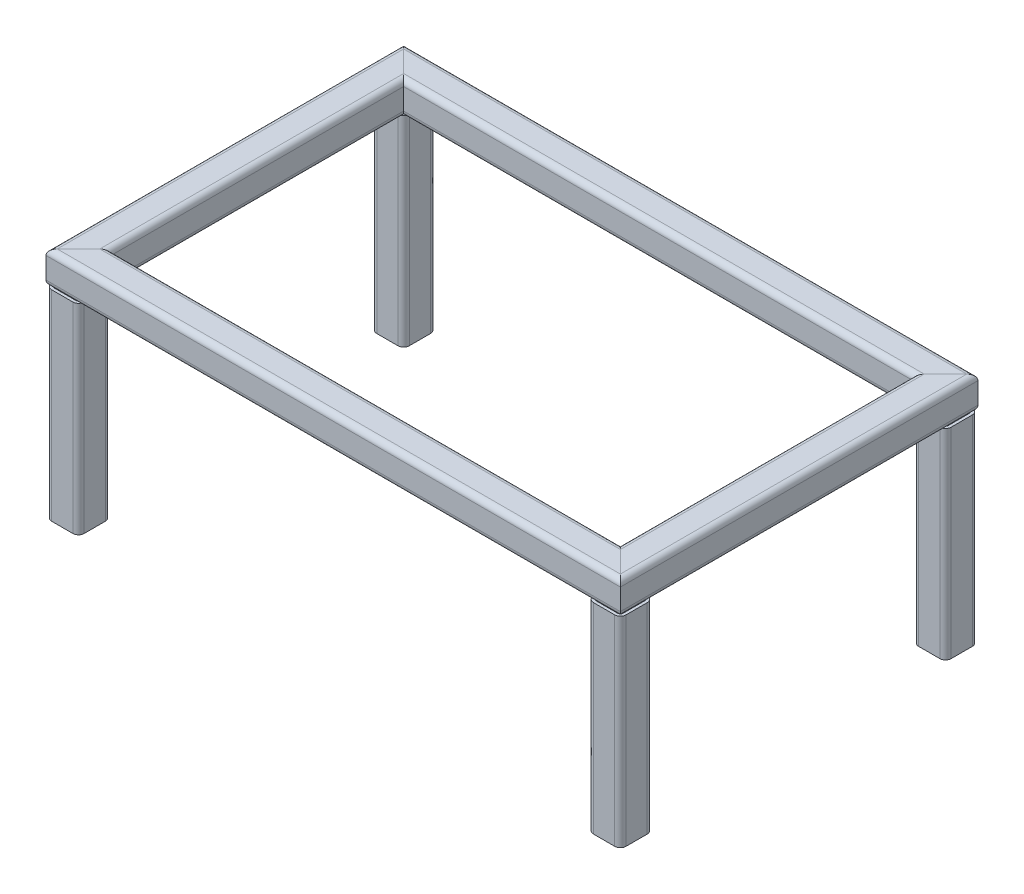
ISO-10303-21;
HEADER;
FILE_DESCRIPTION(('STEP AP214'),'2;1');
FILE_NAME('part.step','',(''),(''),'','','');
FILE_SCHEMA(('AUTOMOTIVE_DESIGN { 1 0 10303 214 1 1 1 1 }'));
ENDSEC;
DATA;
#1=APPLICATION_CONTEXT('core data for automotive mechanical design processes');
#2=APPLICATION_PROTOCOL_DEFINITION('international standard','automotive_design',2000,#1);
#3=PRODUCT_CONTEXT('',#1,'mechanical');
#4=PRODUCT('Part','Part','',(#3));
#5=PRODUCT_RELATED_PRODUCT_CATEGORY('part','',(#4));
#6=PRODUCT_DEFINITION_FORMATION('','',#4);
#7=PRODUCT_DEFINITION_CONTEXT('part definition',#1,'design');
#8=PRODUCT_DEFINITION('design','',#6,#7);
#9=PRODUCT_DEFINITION_SHAPE('','',#8);
#10=(LENGTH_UNIT() NAMED_UNIT(*) SI_UNIT(.MILLI.,.METRE.));
#11=(NAMED_UNIT(*) PLANE_ANGLE_UNIT() SI_UNIT($,.RADIAN.));
#12=(NAMED_UNIT(*) SI_UNIT($,.STERADIAN.) SOLID_ANGLE_UNIT());
#13=UNCERTAINTY_MEASURE_WITH_UNIT(LENGTH_MEASURE(1.E-05),#10,'distance_accuracy_value','');
#14=(GEOMETRIC_REPRESENTATION_CONTEXT(3) GLOBAL_UNCERTAINTY_ASSIGNED_CONTEXT((#13)) GLOBAL_UNIT_ASSIGNED_CONTEXT((#10,
#11,#12)) REPRESENTATION_CONTEXT('',''));
#15=CARTESIAN_POINT('',(0.,0.,0.));
#16=DIRECTION('',(0.,0.,1.));
#17=DIRECTION('',(1.,0.,0.));
#18=AXIS2_PLACEMENT_3D('',#15,#16,#17);
#19=CARTESIAN_POINT('',(-240.2,-200.,-140.2));
#20=DIRECTION('',(0.,1.,0.));
#21=DIRECTION('',(0.,0.,1.));
#22=AXIS2_PLACEMENT_3D('',#19,#20,#21);
#23=CYLINDRICAL_SURFACE('',#22,5.2);
#24=CARTESIAN_POINT('',(-240.2,-15.,-140.2));
#25=DIRECTION('',(0.,1.,0.));
#26=DIRECTION('',(0.,0.,1.));
#27=AXIS2_PLACEMENT_3D('',#24,#25,#26);
#28=CIRCLE('',#27,5.2);
#29=CARTESIAN_POINT('',(-240.2,-15.,-135.));
#30=VERTEX_POINT('',#29);
#31=CARTESIAN_POINT('',(-235.,-15.,-140.2));
#32=VERTEX_POINT('',#31);
#33=EDGE_CURVE('E196',#30,#32,#28,.T.);
#34=ORIENTED_EDGE('',*,*,#33,.F.);
#35=DIRECTION('',(0.,1.,0.));
#36=VECTOR('',#35,1.);
#37=CARTESIAN_POINT('',(-240.2,-200.,-135.));
#38=LINE('',#37,#36);
#39=CARTESIAN_POINT('',(-240.2,-200.,-135.));
#40=VERTEX_POINT('',#39);
#41=EDGE_CURVE('E227',#40,#30,#38,.T.);
#42=ORIENTED_EDGE('',*,*,#41,.F.);
#43=CARTESIAN_POINT('',(-240.2,-200.,-140.2));
#44=DIRECTION('',(0.,-1.,0.));
#45=DIRECTION('',(1.,0.,0.));
#46=AXIS2_PLACEMENT_3D('',#43,#44,#45);
#47=CIRCLE('',#46,5.2);
#48=CARTESIAN_POINT('',(-235.,-200.,-140.2));
#49=VERTEX_POINT('',#48);
#50=EDGE_CURVE('E213',#49,#40,#47,.T.);
#51=ORIENTED_EDGE('',*,*,#50,.F.);
#52=DIRECTION('',(0.,1.,0.));
#53=VECTOR('',#52,1.);
#54=CARTESIAN_POINT('',(-235.,-200.,-140.2));
#55=LINE('',#54,#53);
#56=EDGE_CURVE('E225',#49,#32,#55,.T.);
#57=ORIENTED_EDGE('',*,*,#56,.T.);
#58=EDGE_LOOP('',(#34,#42,#51,#57));
#59=FACE_BOUND('',#58,.T.);
#60=ADVANCED_FACE('F80',(#59),#23,.T.);
#61=CARTESIAN_POINT('',(-240.2,-200.,-135.));
#62=DIRECTION('',(0.,0.,-1.));
#63=DIRECTION('',(-1.,0.,0.));
#64=AXIS2_PLACEMENT_3D('',#61,#62,#63);
#65=PLANE('',#64);
#66=DIRECTION('',(1.,0.,0.));
#67=VECTOR('',#66,1.);
#68=CARTESIAN_POINT('',(-240.2,-15.,-135.));
#69=LINE('',#68,#67);
#70=CARTESIAN_POINT('',(-259.8,-15.,-135.));
#71=VERTEX_POINT('',#70);
#72=EDGE_CURVE('E295',#71,#30,#69,.T.);
#73=ORIENTED_EDGE('',*,*,#72,.F.);
#74=DIRECTION('',(0.,1.,0.));
#75=VECTOR('',#74,1.);
#76=CARTESIAN_POINT('',(-259.8,-200.,-135.));
#77=LINE('',#76,#75);
#78=CARTESIAN_POINT('',(-259.8,-200.,-135.));
#79=VERTEX_POINT('',#78);
#80=EDGE_CURVE('E304',#79,#71,#77,.T.);
#81=ORIENTED_EDGE('',*,*,#80,.F.);
#82=DIRECTION('',(-1.,0.,0.));
#83=VECTOR('',#82,1.);
#84=CARTESIAN_POINT('',(-240.2,-200.,-135.));
#85=LINE('',#84,#83);
#86=EDGE_CURVE('E217',#40,#79,#85,.T.);
#87=ORIENTED_EDGE('',*,*,#86,.F.);
#88=ORIENTED_EDGE('',*,*,#41,.T.);
#89=EDGE_LOOP('',(#73,#81,#87,#88));
#90=FACE_BOUND('',#89,.T.);
#91=ADVANCED_FACE('F350',(#90),#65,.F.);
#92=CARTESIAN_POINT('',(-259.8,-200.,-140.2));
#93=DIRECTION('',(0.,1.,0.));
#94=DIRECTION('',(0.,0.,1.));
#95=AXIS2_PLACEMENT_3D('',#92,#93,#94);
#96=CYLINDRICAL_SURFACE('',#95,5.19999999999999);
#97=CARTESIAN_POINT('',(-259.8,-15.,-140.2));
#98=DIRECTION('',(0.,1.,0.));
#99=DIRECTION('',(0.,0.,1.));
#100=AXIS2_PLACEMENT_3D('',#97,#98,#99);
#101=CIRCLE('',#100,5.19999999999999);
#102=CARTESIAN_POINT('',(-265.,-15.,-140.2));
#103=VERTEX_POINT('',#102);
#104=EDGE_CURVE('E282',#103,#71,#101,.T.);
#105=ORIENTED_EDGE('',*,*,#104,.F.);
#106=DIRECTION('',(0.,1.,0.));
#107=VECTOR('',#106,1.);
#108=CARTESIAN_POINT('',(-265.,-200.,-140.2));
#109=LINE('',#108,#107);
#110=CARTESIAN_POINT('',(-265.,-200.,-140.2));
#111=VERTEX_POINT('',#110);
#112=EDGE_CURVE('E303',#111,#103,#109,.T.);
#113=ORIENTED_EDGE('',*,*,#112,.F.);
#114=CARTESIAN_POINT('',(-259.8,-200.,-140.2));
#115=DIRECTION('',(0.,-1.,0.));
#116=DIRECTION('',(1.,0.,0.));
#117=AXIS2_PLACEMENT_3D('',#114,#115,#116);
#118=CIRCLE('',#117,5.19999999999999);
#119=EDGE_CURVE('E362',#79,#111,#118,.T.);
#120=ORIENTED_EDGE('',*,*,#119,.F.);
#121=ORIENTED_EDGE('',*,*,#80,.T.);
#122=EDGE_LOOP('',(#105,#113,#120,#121));
#123=FACE_BOUND('',#122,.T.);
#124=ADVANCED_FACE('F355',(#123),#96,.T.);
#125=CARTESIAN_POINT('',(-265.,-200.,-159.8));
#126=DIRECTION('',(1.,0.,0.));
#127=DIRECTION('',(0.,0.,-1.));
#128=AXIS2_PLACEMENT_3D('',#125,#126,#127);
#129=PLANE('',#128);
#130=DIRECTION('',(0.,0.,-1.));
#131=VECTOR('',#130,1.);
#132=CARTESIAN_POINT('',(-265.,-15.,150.));
#133=LINE('',#132,#131);
#134=CARTESIAN_POINT('',(-265.,-15.,-159.8));
#135=VERTEX_POINT('',#134);
#136=EDGE_CURVE('E301',#103,#135,#133,.T.);
#137=ORIENTED_EDGE('',*,*,#136,.T.);
#138=DIRECTION('',(0.,1.,0.));
#139=VECTOR('',#138,1.);
#140=CARTESIAN_POINT('',(-265.,-200.,-159.8));
#141=LINE('',#140,#139);
#142=CARTESIAN_POINT('',(-265.,-200.,-159.8));
#143=VERTEX_POINT('',#142);
#144=EDGE_CURVE('E300',#143,#135,#141,.T.);
#145=ORIENTED_EDGE('',*,*,#144,.F.);
#146=DIRECTION('',(0.,0.,-1.));
#147=VECTOR('',#146,1.);
#148=CARTESIAN_POINT('',(-265.,-200.,-159.8));
#149=LINE('',#148,#147);
#150=EDGE_CURVE('E372',#111,#143,#149,.T.);
#151=ORIENTED_EDGE('',*,*,#150,.F.);
#152=ORIENTED_EDGE('',*,*,#112,.T.);
#153=EDGE_LOOP('',(#137,#145,#151,#152));
#154=FACE_BOUND('',#153,.T.);
#155=ADVANCED_FACE('F380',(#154),#129,.F.);
#156=CARTESIAN_POINT('',(-259.8,-200.,-159.8));
#157=DIRECTION('',(0.,1.,0.));
#158=DIRECTION('',(0.,0.,1.));
#159=AXIS2_PLACEMENT_3D('',#156,#157,#158);
#160=CYLINDRICAL_SURFACE('',#159,5.19999999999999);
#161=CARTESIAN_POINT('',(-259.8,-15.,-159.8));
#162=DIRECTION('',(0.,1.,0.));
#163=DIRECTION('',(0.,0.,1.));
#164=AXIS2_PLACEMENT_3D('',#161,#162,#163);
#165=CIRCLE('',#164,5.19999999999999);
#166=CARTESIAN_POINT('',(-259.8,-15.,-165.));
#167=VERTEX_POINT('',#166);
#168=EDGE_CURVE('E105',#167,#135,#165,.T.);
#169=ORIENTED_EDGE('',*,*,#168,.F.);
#170=DIRECTION('',(0.,1.,0.));
#171=VECTOR('',#170,1.);
#172=CARTESIAN_POINT('',(-259.8,-200.,-165.));
#173=LINE('',#172,#171);
#174=CARTESIAN_POINT('',(-259.8,-200.,-165.));
#175=VERTEX_POINT('',#174);
#176=EDGE_CURVE('E299',#175,#167,#173,.T.);
#177=ORIENTED_EDGE('',*,*,#176,.F.);
#178=CARTESIAN_POINT('',(-259.8,-200.,-159.8));
#179=DIRECTION('',(0.,-1.,0.));
#180=DIRECTION('',(1.,0.,0.));
#181=AXIS2_PLACEMENT_3D('',#178,#179,#180);
#182=CIRCLE('',#181,5.19999999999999);
#183=EDGE_CURVE('E370',#143,#175,#182,.T.);
#184=ORIENTED_EDGE('',*,*,#183,.F.);
#185=ORIENTED_EDGE('',*,*,#144,.T.);
#186=EDGE_LOOP('',(#169,#177,#184,#185));
#187=FACE_BOUND('',#186,.T.);
#188=ADVANCED_FACE('F383',(#187),#160,.T.);
#189=CARTESIAN_POINT('',(-259.8,-200.,-165.));
#190=DIRECTION('',(0.,0.,1.));
#191=DIRECTION('',(1.,0.,0.));
#192=AXIS2_PLACEMENT_3D('',#189,#190,#191);
#193=PLANE('',#192);
#194=DIRECTION('',(1.,0.,0.));
#195=VECTOR('',#194,1.);
#196=CARTESIAN_POINT('',(-250.,-15.,-165.));
#197=LINE('',#196,#195);
#198=CARTESIAN_POINT('',(-240.2,-15.,-165.));
#199=VERTEX_POINT('',#198);
#200=EDGE_CURVE('E97',#167,#199,#197,.T.);
#201=ORIENTED_EDGE('',*,*,#200,.T.);
#202=DIRECTION('',(0.,1.,0.));
#203=VECTOR('',#202,1.);
#204=CARTESIAN_POINT('',(-240.2,-200.,-165.));
#205=LINE('',#204,#203);
#206=CARTESIAN_POINT('',(-240.2,-200.,-165.));
#207=VERTEX_POINT('',#206);
#208=EDGE_CURVE('E210',#207,#199,#205,.T.);
#209=ORIENTED_EDGE('',*,*,#208,.F.);
#210=DIRECTION('',(1.,0.,0.));
#211=VECTOR('',#210,1.);
#212=CARTESIAN_POINT('',(-259.8,-200.,-165.));
#213=LINE('',#212,#211);
#214=EDGE_CURVE('E366',#175,#207,#213,.T.);
#215=ORIENTED_EDGE('',*,*,#214,.F.);
#216=ORIENTED_EDGE('',*,*,#176,.T.);
#217=EDGE_LOOP('',(#201,#209,#215,#216));
#218=FACE_BOUND('',#217,.T.);
#219=ADVANCED_FACE('F384',(#218),#193,.F.);
#220=CARTESIAN_POINT('',(-240.2,-200.,-159.8));
#221=DIRECTION('',(0.,1.,0.));
#222=DIRECTION('',(0.,0.,1.));
#223=AXIS2_PLACEMENT_3D('',#220,#221,#222);
#224=CYLINDRICAL_SURFACE('',#223,5.2);
#225=CARTESIAN_POINT('',(-240.2,-15.,-159.8));
#226=DIRECTION('',(0.,1.,0.));
#227=DIRECTION('',(0.,0.,1.));
#228=AXIS2_PLACEMENT_3D('',#225,#226,#227);
#229=CIRCLE('',#228,5.2);
#230=CARTESIAN_POINT('',(-235.,-15.,-159.8));
#231=VERTEX_POINT('',#230);
#232=EDGE_CURVE('E13',#231,#199,#229,.T.);
#233=ORIENTED_EDGE('',*,*,#232,.F.);
#234=DIRECTION('',(0.,1.,0.));
#235=VECTOR('',#234,1.);
#236=CARTESIAN_POINT('',(-235.,-200.,-159.8));
#237=LINE('',#236,#235);
#238=CARTESIAN_POINT('',(-235.,-200.,-159.8));
#239=VERTEX_POINT('',#238);
#240=EDGE_CURVE('E207',#239,#231,#237,.T.);
#241=ORIENTED_EDGE('',*,*,#240,.F.);
#242=CARTESIAN_POINT('',(-240.2,-200.,-159.8));
#243=DIRECTION('',(0.,-1.,0.));
#244=DIRECTION('',(1.,0.,0.));
#245=AXIS2_PLACEMENT_3D('',#242,#243,#244);
#246=CIRCLE('',#245,5.2);
#247=EDGE_CURVE('E364',#207,#239,#246,.T.);
#248=ORIENTED_EDGE('',*,*,#247,.F.);
#249=ORIENTED_EDGE('',*,*,#208,.T.);
#250=EDGE_LOOP('',(#233,#241,#248,#249));
#251=FACE_BOUND('',#250,.T.);
#252=ADVANCED_FACE('F205',(#251),#224,.T.);
#253=CARTESIAN_POINT('',(-259.8,-200.,-140.2));
#254=DIRECTION('',(0.,1.,0.));
#255=DIRECTION('',(0.,0.,1.));
#256=AXIS2_PLACEMENT_3D('',#253,#254,#255);
#257=CYLINDRICAL_SURFACE('',#256,2.6);
#258=DIRECTION('',(0.,1.,0.));
#259=VECTOR('',#258,1.);
#260=CARTESIAN_POINT('',(-262.4,-200.,-140.2));
#261=LINE('',#260,#259);
#262=CARTESIAN_POINT('',(-262.4,-200.,-140.2));
#263=VERTEX_POINT('',#262);
#264=CARTESIAN_POINT('',(-262.4,-15.,-140.2));
#265=VERTEX_POINT('',#264);
#266=EDGE_CURVE('E83',#263,#265,#261,.T.);
#267=ORIENTED_EDGE('',*,*,#266,.T.);
#268=CARTESIAN_POINT('',(-259.8,-15.,-140.2));
#269=DIRECTION('',(0.,1.,0.));
#270=DIRECTION('',(0.,0.,1.));
#271=AXIS2_PLACEMENT_3D('',#268,#269,#270);
#272=CIRCLE('',#271,2.6);
#273=CARTESIAN_POINT('',(-259.8,-15.,-137.6));
#274=VERTEX_POINT('',#273);
#275=EDGE_CURVE('E115',#265,#274,#272,.T.);
#276=ORIENTED_EDGE('',*,*,#275,.T.);
#277=DIRECTION('',(0.,1.,0.));
#278=VECTOR('',#277,1.);
#279=CARTESIAN_POINT('',(-259.8,-200.,-137.6));
#280=LINE('',#279,#278);
#281=CARTESIAN_POINT('',(-259.8,-200.,-137.6));
#282=VERTEX_POINT('',#281);
#283=EDGE_CURVE('E228',#282,#274,#280,.T.);
#284=ORIENTED_EDGE('',*,*,#283,.F.);
#285=CARTESIAN_POINT('',(-259.8,-200.,-140.2));
#286=DIRECTION('',(0.,-1.,0.));
#287=DIRECTION('',(1.,0.,0.));
#288=AXIS2_PLACEMENT_3D('',#285,#286,#287);
#289=CIRCLE('',#288,2.6);
#290=EDGE_CURVE('E232',#282,#263,#289,.T.);
#291=ORIENTED_EDGE('',*,*,#290,.T.);
#292=EDGE_LOOP('',(#267,#276,#284,#291));
#293=FACE_BOUND('',#292,.T.);
#294=ADVANCED_FACE('F318',(#293),#257,.F.);
#295=CARTESIAN_POINT('',(-240.2,-200.,-137.6));
#296=DIRECTION('',(0.,0.,-1.));
#297=DIRECTION('',(-1.,0.,0.));
#298=AXIS2_PLACEMENT_3D('',#295,#296,#297);
#299=PLANE('',#298);
#300=ORIENTED_EDGE('',*,*,#283,.T.);
#301=DIRECTION('',(1.,0.,0.));
#302=VECTOR('',#301,1.);
#303=CARTESIAN_POINT('',(-240.2,-15.,-137.6));
#304=LINE('',#303,#302);
#305=CARTESIAN_POINT('',(-240.2,-15.,-137.6));
#306=VERTEX_POINT('',#305);
#307=EDGE_CURVE('E231',#274,#306,#304,.T.);
#308=ORIENTED_EDGE('',*,*,#307,.T.);
#309=DIRECTION('',(0.,1.,0.));
#310=VECTOR('',#309,1.);
#311=CARTESIAN_POINT('',(-240.2,-200.,-137.6));
#312=LINE('',#311,#310);
#313=CARTESIAN_POINT('',(-240.2,-200.,-137.6));
#314=VERTEX_POINT('',#313);
#315=EDGE_CURVE('E233',#314,#306,#312,.T.);
#316=ORIENTED_EDGE('',*,*,#315,.F.);
#317=DIRECTION('',(-1.,0.,0.));
#318=VECTOR('',#317,1.);
#319=CARTESIAN_POINT('',(-240.2,-200.,-137.6));
#320=LINE('',#319,#318);
#321=EDGE_CURVE('E237',#314,#282,#320,.T.);
#322=ORIENTED_EDGE('',*,*,#321,.T.);
#323=EDGE_LOOP('',(#300,#308,#316,#322));
#324=FACE_BOUND('',#323,.T.);
#325=ADVANCED_FACE('F340',(#324),#299,.T.);
#326=CARTESIAN_POINT('',(-240.2,-200.,-140.2));
#327=DIRECTION('',(0.,1.,0.));
#328=DIRECTION('',(0.,0.,1.));
#329=AXIS2_PLACEMENT_3D('',#326,#327,#328);
#330=CYLINDRICAL_SURFACE('',#329,2.6);
#331=ORIENTED_EDGE('',*,*,#315,.T.);
#332=CARTESIAN_POINT('',(-240.2,-15.,-140.2));
#333=DIRECTION('',(0.,1.,0.));
#334=DIRECTION('',(0.,0.,1.));
#335=AXIS2_PLACEMENT_3D('',#332,#333,#334);
#336=CIRCLE('',#335,2.6);
#337=CARTESIAN_POINT('',(-237.6,-15.,-140.2));
#338=VERTEX_POINT('',#337);
#339=EDGE_CURVE('E236',#306,#338,#336,.T.);
#340=ORIENTED_EDGE('',*,*,#339,.T.);
#341=DIRECTION('',(0.,1.,0.));
#342=VECTOR('',#341,1.);
#343=CARTESIAN_POINT('',(-237.6,-200.,-140.2));
#344=LINE('',#343,#342);
#345=CARTESIAN_POINT('',(-237.6,-200.,-140.2));
#346=VERTEX_POINT('',#345);
#347=EDGE_CURVE('E238',#346,#338,#344,.T.);
#348=ORIENTED_EDGE('',*,*,#347,.F.);
#349=CARTESIAN_POINT('',(-240.2,-200.,-140.2));
#350=DIRECTION('',(0.,-1.,0.));
#351=DIRECTION('',(1.,0.,0.));
#352=AXIS2_PLACEMENT_3D('',#349,#350,#351);
#353=CIRCLE('',#352,2.6);
#354=EDGE_CURVE('E242',#346,#314,#353,.T.);
#355=ORIENTED_EDGE('',*,*,#354,.T.);
#356=EDGE_LOOP('',(#331,#340,#348,#355));
#357=FACE_BOUND('',#356,.T.);
#358=ADVANCED_FACE('F337',(#357),#330,.F.);
#359=CARTESIAN_POINT('',(-237.6,-200.,-140.2));
#360=DIRECTION('',(-1.,0.,0.));
#361=DIRECTION('',(0.,0.,1.));
#362=AXIS2_PLACEMENT_3D('',#359,#360,#361);
#363=PLANE('',#362);
#364=ORIENTED_EDGE('',*,*,#347,.T.);
#365=DIRECTION('',(0.,0.,-1.));
#366=VECTOR('',#365,1.);
#367=CARTESIAN_POINT('',(-237.6,-15.,-140.2));
#368=LINE('',#367,#366);
#369=CARTESIAN_POINT('',(-237.6,-15.,-159.8));
#370=VERTEX_POINT('',#369);
#371=EDGE_CURVE('E241',#338,#370,#368,.T.);
#372=ORIENTED_EDGE('',*,*,#371,.T.);
#373=DIRECTION('',(0.,1.,0.));
#374=VECTOR('',#373,1.);
#375=CARTESIAN_POINT('',(-237.6,-200.,-159.8));
#376=LINE('',#375,#374);
#377=CARTESIAN_POINT('',(-237.6,-200.,-159.8));
#378=VERTEX_POINT('',#377);
#379=EDGE_CURVE('E243',#378,#370,#376,.T.);
#380=ORIENTED_EDGE('',*,*,#379,.F.);
#381=DIRECTION('',(0.,0.,1.));
#382=VECTOR('',#381,1.);
#383=CARTESIAN_POINT('',(-237.6,-200.,-140.2));
#384=LINE('',#383,#382);
#385=EDGE_CURVE('E247',#378,#346,#384,.T.);
#386=ORIENTED_EDGE('',*,*,#385,.T.);
#387=EDGE_LOOP('',(#364,#372,#380,#386));
#388=FACE_BOUND('',#387,.T.);
#389=ADVANCED_FACE('F335',(#388),#363,.T.);
#390=CARTESIAN_POINT('',(-240.2,-200.,-159.8));
#391=DIRECTION('',(0.,1.,0.));
#392=DIRECTION('',(0.,0.,1.));
#393=AXIS2_PLACEMENT_3D('',#390,#391,#392);
#394=CYLINDRICAL_SURFACE('',#393,2.6);
#395=ORIENTED_EDGE('',*,*,#379,.T.);
#396=CARTESIAN_POINT('',(-240.2,-15.,-159.8));
#397=DIRECTION('',(0.,1.,0.));
#398=DIRECTION('',(0.,0.,1.));
#399=AXIS2_PLACEMENT_3D('',#396,#397,#398);
#400=CIRCLE('',#399,2.6);
#401=CARTESIAN_POINT('',(-240.2,-15.,-162.4));
#402=VERTEX_POINT('',#401);
#403=EDGE_CURVE('E246',#370,#402,#400,.T.);
#404=ORIENTED_EDGE('',*,*,#403,.T.);
#405=DIRECTION('',(0.,1.,0.));
#406=VECTOR('',#405,1.);
#407=CARTESIAN_POINT('',(-240.2,-200.,-162.4));
#408=LINE('',#407,#406);
#409=CARTESIAN_POINT('',(-240.2,-200.,-162.4));
#410=VERTEX_POINT('',#409);
#411=EDGE_CURVE('E248',#410,#402,#408,.T.);
#412=ORIENTED_EDGE('',*,*,#411,.F.);
#413=CARTESIAN_POINT('',(-240.2,-200.,-159.8));
#414=DIRECTION('',(0.,-1.,0.));
#415=DIRECTION('',(1.,0.,0.));
#416=AXIS2_PLACEMENT_3D('',#413,#414,#415);
#417=CIRCLE('',#416,2.6);
#418=EDGE_CURVE('E252',#410,#378,#417,.T.);
#419=ORIENTED_EDGE('',*,*,#418,.T.);
#420=EDGE_LOOP('',(#395,#404,#412,#419));
#421=FACE_BOUND('',#420,.T.);
#422=ADVANCED_FACE('F333',(#421),#394,.F.);
#423=CARTESIAN_POINT('',(-259.8,-200.,-162.4));
#424=DIRECTION('',(0.,0.,1.));
#425=DIRECTION('',(1.,0.,0.));
#426=AXIS2_PLACEMENT_3D('',#423,#424,#425);
#427=PLANE('',#426);
#428=ORIENTED_EDGE('',*,*,#411,.T.);
#429=DIRECTION('',(-1.,0.,0.));
#430=VECTOR('',#429,1.);
#431=CARTESIAN_POINT('',(-259.8,-15.,-162.4));
#432=LINE('',#431,#430);
#433=CARTESIAN_POINT('',(-259.8,-15.,-162.4));
#434=VERTEX_POINT('',#433);
#435=EDGE_CURVE('E251',#402,#434,#432,.T.);
#436=ORIENTED_EDGE('',*,*,#435,.T.);
#437=DIRECTION('',(0.,1.,0.));
#438=VECTOR('',#437,1.);
#439=CARTESIAN_POINT('',(-259.8,-200.,-162.4));
#440=LINE('',#439,#438);
#441=CARTESIAN_POINT('',(-259.8,-200.,-162.4));
#442=VERTEX_POINT('',#441);
#443=EDGE_CURVE('E253',#442,#434,#440,.T.);
#444=ORIENTED_EDGE('',*,*,#443,.F.);
#445=DIRECTION('',(1.,0.,0.));
#446=VECTOR('',#445,1.);
#447=CARTESIAN_POINT('',(-259.8,-200.,-162.4));
#448=LINE('',#447,#446);
#449=EDGE_CURVE('E256',#442,#410,#448,.T.);
#450=ORIENTED_EDGE('',*,*,#449,.T.);
#451=EDGE_LOOP('',(#428,#436,#444,#450));
#452=FACE_BOUND('',#451,.T.);
#453=ADVANCED_FACE('F325',(#452),#427,.T.);
#454=CARTESIAN_POINT('',(-259.8,-200.,-159.8));
#455=DIRECTION('',(0.,1.,0.));
#456=DIRECTION('',(0.,0.,1.));
#457=AXIS2_PLACEMENT_3D('',#454,#455,#456);
#458=CYLINDRICAL_SURFACE('',#457,2.6);
#459=ORIENTED_EDGE('',*,*,#443,.T.);
#460=CARTESIAN_POINT('',(-259.8,-15.,-159.8));
#461=DIRECTION('',(0.,1.,0.));
#462=DIRECTION('',(0.,0.,1.));
#463=AXIS2_PLACEMENT_3D('',#460,#461,#462);
#464=CIRCLE('',#463,2.6);
#465=CARTESIAN_POINT('',(-262.4,-15.,-159.8));
#466=VERTEX_POINT('',#465);
#467=EDGE_CURVE('E255',#434,#466,#464,.T.);
#468=ORIENTED_EDGE('',*,*,#467,.T.);
#469=DIRECTION('',(0.,1.,0.));
#470=VECTOR('',#469,1.);
#471=CARTESIAN_POINT('',(-262.4,-200.,-159.8));
#472=LINE('',#471,#470);
#473=CARTESIAN_POINT('',(-262.4,-200.,-159.8));
#474=VERTEX_POINT('',#473);
#475=EDGE_CURVE('E257',#474,#466,#472,.T.);
#476=ORIENTED_EDGE('',*,*,#475,.F.);
#477=CARTESIAN_POINT('',(-259.8,-200.,-159.8));
#478=DIRECTION('',(0.,-1.,0.));
#479=DIRECTION('',(1.,0.,0.));
#480=AXIS2_PLACEMENT_3D('',#477,#478,#479);
#481=CIRCLE('',#480,2.6);
#482=EDGE_CURVE('E259',#474,#442,#481,.T.);
#483=ORIENTED_EDGE('',*,*,#482,.T.);
#484=EDGE_LOOP('',(#459,#468,#476,#483));
#485=FACE_BOUND('',#484,.T.);
#486=ADVANCED_FACE('F322',(#485),#458,.F.);
#487=CARTESIAN_POINT('',(-262.4,-200.,-159.8));
#488=DIRECTION('',(1.,0.,0.));
#489=DIRECTION('',(0.,0.,-1.));
#490=AXIS2_PLACEMENT_3D('',#487,#488,#489);
#491=PLANE('',#490);
#492=ORIENTED_EDGE('',*,*,#475,.T.);
#493=DIRECTION('',(0.,0.,1.));
#494=VECTOR('',#493,1.);
#495=CARTESIAN_POINT('',(-262.4,-15.,-159.8));
#496=LINE('',#495,#494);
#497=EDGE_CURVE('E220',#466,#265,#496,.T.);
#498=ORIENTED_EDGE('',*,*,#497,.T.);
#499=ORIENTED_EDGE('',*,*,#266,.F.);
#500=DIRECTION('',(0.,0.,-1.));
#501=VECTOR('',#500,1.);
#502=CARTESIAN_POINT('',(-262.4,-200.,-159.8));
#503=LINE('',#502,#501);
#504=EDGE_CURVE('E214',#263,#474,#503,.T.);
#505=ORIENTED_EDGE('',*,*,#504,.T.);
#506=EDGE_LOOP('',(#492,#498,#499,#505));
#507=FACE_BOUND('',#506,.T.);
#508=ADVANCED_FACE('F321',(#507),#491,.T.);
#509=CARTESIAN_POINT('',(-235.,-200.,-140.2));
#510=DIRECTION('',(-1.,0.,0.));
#511=DIRECTION('',(0.,0.,1.));
#512=AXIS2_PLACEMENT_3D('',#509,#510,#511);
#513=PLANE('',#512);
#514=DIRECTION('',(0.,0.,-1.));
#515=VECTOR('',#514,1.);
#516=CARTESIAN_POINT('',(-235.,-15.,-140.2));
#517=LINE('',#516,#515);
#518=EDGE_CURVE('E89',#32,#231,#517,.T.);
#519=ORIENTED_EDGE('',*,*,#518,.F.);
#520=ORIENTED_EDGE('',*,*,#56,.F.);
#521=DIRECTION('',(0.,0.,1.));
#522=VECTOR('',#521,1.);
#523=CARTESIAN_POINT('',(-235.,-200.,-140.2));
#524=LINE('',#523,#522);
#525=EDGE_CURVE('E212',#239,#49,#524,.T.);
#526=ORIENTED_EDGE('',*,*,#525,.F.);
#527=ORIENTED_EDGE('',*,*,#240,.T.);
#528=EDGE_LOOP('',(#519,#520,#526,#527));
#529=FACE_BOUND('',#528,.T.);
#530=ADVANCED_FACE('F211',(#529),#513,.F.);
#531=CARTESIAN_POINT('',(-240.2,-200.,-140.2));
#532=DIRECTION('',(0.,-1.,0.));
#533=DIRECTION('',(1.,0.,0.));
#534=AXIS2_PLACEMENT_3D('',#531,#532,#533);
#535=PLANE('',#534);
#536=ORIENTED_EDGE('',*,*,#290,.F.);
#537=ORIENTED_EDGE('',*,*,#321,.F.);
#538=ORIENTED_EDGE('',*,*,#354,.F.);
#539=ORIENTED_EDGE('',*,*,#385,.F.);
#540=ORIENTED_EDGE('',*,*,#418,.F.);
#541=ORIENTED_EDGE('',*,*,#449,.F.);
#542=ORIENTED_EDGE('',*,*,#482,.F.);
#543=ORIENTED_EDGE('',*,*,#504,.F.);
#544=EDGE_LOOP('',(#536,#537,#538,#539,#540,#541,#542,#543));
#545=FACE_BOUND('',#544,.T.);
#546=ORIENTED_EDGE('',*,*,#50,.T.);
#547=ORIENTED_EDGE('',*,*,#86,.T.);
#548=ORIENTED_EDGE('',*,*,#119,.T.);
#549=ORIENTED_EDGE('',*,*,#150,.T.);
#550=ORIENTED_EDGE('',*,*,#183,.T.);
#551=ORIENTED_EDGE('',*,*,#214,.T.);
#552=ORIENTED_EDGE('',*,*,#247,.T.);
#553=ORIENTED_EDGE('',*,*,#525,.T.);
#554=EDGE_LOOP('',(#546,#547,#548,#549,#550,#551,#552,#553));
#555=FACE_BOUND('',#554,.T.);
#556=ADVANCED_FACE('F328',(#545,#555),#535,.T.);
#557=CARTESIAN_POINT('',(-250.,-15.,-159.8));
#558=DIRECTION('',(0.,1.,0.));
#559=DIRECTION('',(0.,0.,1.));
#560=AXIS2_PLACEMENT_3D('',#557,#558,#559);
#561=PLANE('',#560);
#562=ORIENTED_EDGE('',*,*,#497,.F.);
#563=ORIENTED_EDGE('',*,*,#467,.F.);
#564=ORIENTED_EDGE('',*,*,#435,.F.);
#565=ORIENTED_EDGE('',*,*,#403,.F.);
#566=ORIENTED_EDGE('',*,*,#371,.F.);
#567=ORIENTED_EDGE('',*,*,#339,.F.);
#568=ORIENTED_EDGE('',*,*,#307,.F.);
#569=ORIENTED_EDGE('',*,*,#275,.F.);
#570=EDGE_LOOP('',(#562,#563,#564,#565,#566,#567,#568,#569));
#571=FACE_BOUND('',#570,.T.);
#572=ORIENTED_EDGE('',*,*,#168,.T.);
#573=ORIENTED_EDGE('',*,*,#136,.F.);
#574=ORIENTED_EDGE('',*,*,#104,.T.);
#575=ORIENTED_EDGE('',*,*,#72,.T.);
#576=ORIENTED_EDGE('',*,*,#33,.T.);
#577=ORIENTED_EDGE('',*,*,#518,.T.);
#578=ORIENTED_EDGE('',*,*,#232,.T.);
#579=ORIENTED_EDGE('',*,*,#200,.F.);
#580=EDGE_LOOP('',(#572,#573,#574,#575,#576,#577,#578,#579));
#581=FACE_BOUND('',#580,.T.);
#582=ADVANCED_FACE('F194',(#571,#581),#561,.T.);
#583=CLOSED_SHELL('',(#60,#91,#124,#155,#188,#219,#252,#294,#325,#358,#389,#422,#453,#486,#508,
#530,#556,#582));
#584=MANIFOLD_SOLID_BREP('B2',#583);
#585=CARTESIAN_POINT('',(-240.2,9.8,150.));
#586=DIRECTION('',(0.,0.,-1.));
#587=DIRECTION('',(-1.,0.,0.));
#588=AXIS2_PLACEMENT_3D('',#585,#586,#587);
#589=CYLINDRICAL_SURFACE('',#588,5.2);
#590=CARTESIAN_POINT('',(-240.2,9.8,-140.2));
#591=DIRECTION('',(0.707106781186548,0.,-0.707106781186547));
#592=DIRECTION('',(-0.707106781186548,0.,-0.707106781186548));
#593=AXIS2_PLACEMENT_3D('',#590,#591,#592);
#594=ELLIPSE('',#593,7.3539105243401,5.2);
#595=CARTESIAN_POINT('',(-240.2,15.,-140.2));
#596=VERTEX_POINT('',#595);
#597=CARTESIAN_POINT('',(-235.,9.8,-135.));
#598=VERTEX_POINT('',#597);
#599=EDGE_CURVE('E725',#596,#598,#594,.T.);
#600=ORIENTED_EDGE('',*,*,#599,.F.);
#601=DIRECTION('',(0.,0.,-1.));
#602=VECTOR('',#601,1.);
#603=CARTESIAN_POINT('',(-240.2,15.,150.));
#604=LINE('',#603,#602);
#605=CARTESIAN_POINT('',(-240.2,15.,140.2));
#606=VERTEX_POINT('',#605);
#607=EDGE_CURVE('E805',#606,#596,#604,.T.);
#608=ORIENTED_EDGE('',*,*,#607,.F.);
#609=CARTESIAN_POINT('',(-240.2,9.8,140.2));
#610=DIRECTION('',(0.707106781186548,0.,0.707106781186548));
#611=DIRECTION('',(0.707106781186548,0.,-0.707106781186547));
#612=AXIS2_PLACEMENT_3D('',#609,#610,#611);
#613=ELLIPSE('',#612,7.35391052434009,5.2);
#614=CARTESIAN_POINT('',(-235.,9.8,135.));
#615=VERTEX_POINT('',#614);
#616=EDGE_CURVE('E716',#615,#606,#613,.T.);
#617=ORIENTED_EDGE('',*,*,#616,.F.);
#618=DIRECTION('',(0.,0.,-1.));
#619=VECTOR('',#618,1.);
#620=CARTESIAN_POINT('',(-235.,9.8,150.));
#621=LINE('',#620,#619);
#622=EDGE_CURVE('E585',#615,#598,#621,.T.);
#623=ORIENTED_EDGE('',*,*,#622,.T.);
#624=EDGE_LOOP('',(#600,#608,#617,#623));
#625=FACE_BOUND('',#624,.T.);
#626=ADVANCED_FACE('F581',(#625),#589,.T.);
#627=CARTESIAN_POINT('',(-240.2,15.,150.));
#628=DIRECTION('',(0.,-1.,0.));
#629=DIRECTION('',(0.,0.,-1.));
#630=AXIS2_PLACEMENT_3D('',#627,#628,#629);
#631=PLANE('',#630);
#632=DIRECTION('',(0.707106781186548,0.,0.707106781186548));
#633=VECTOR('',#632,1.);
#634=CARTESIAN_POINT('',(-95.0999999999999,15.,4.90000000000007));
#635=LINE('',#634,#633);
#636=CARTESIAN_POINT('',(-259.8,15.,-159.8));
#637=VERTEX_POINT('',#636);
#638=EDGE_CURVE('E722',#637,#596,#635,.T.);
#639=ORIENTED_EDGE('',*,*,#638,.F.);
#640=DIRECTION('',(0.,0.,-1.));
#641=VECTOR('',#640,1.);
#642=CARTESIAN_POINT('',(-259.8,15.,150.));
#643=LINE('',#642,#641);
#644=CARTESIAN_POINT('',(-259.8,15.,159.8));
#645=VERTEX_POINT('',#644);
#646=EDGE_CURVE('E803',#645,#637,#643,.T.);
#647=ORIENTED_EDGE('',*,*,#646,.F.);
#648=DIRECTION('',(-0.707106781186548,0.,0.707106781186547));
#649=VECTOR('',#648,1.);
#650=CARTESIAN_POINT('',(-245.1,15.,145.1));
#651=LINE('',#650,#649);
#652=EDGE_CURVE('E821',#606,#645,#651,.T.);
#653=ORIENTED_EDGE('',*,*,#652,.F.);
#654=ORIENTED_EDGE('',*,*,#607,.T.);
#655=EDGE_LOOP('',(#639,#647,#653,#654));
#656=FACE_BOUND('',#655,.T.);
#657=ADVANCED_FACE('F812',(#656),#631,.F.);
#658=CARTESIAN_POINT('',(-259.8,9.8,150.));
#659=DIRECTION('',(0.,0.,-1.));
#660=DIRECTION('',(-1.,0.,0.));
#661=AXIS2_PLACEMENT_3D('',#658,#659,#660);
#662=CYLINDRICAL_SURFACE('',#661,5.19999999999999);
#663=CARTESIAN_POINT('',(-259.8,9.8,-159.8));
#664=DIRECTION('',(0.707106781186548,0.,-0.707106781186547));
#665=DIRECTION('',(-0.707106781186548,0.,-0.707106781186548));
#666=AXIS2_PLACEMENT_3D('',#663,#664,#665);
#667=ELLIPSE('',#666,7.35391052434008,5.19999999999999);
#668=CARTESIAN_POINT('',(-265.,9.8,-165.));
#669=VERTEX_POINT('',#668);
#670=EDGE_CURVE('E78',#669,#637,#667,.T.);
#671=ORIENTED_EDGE('',*,*,#670,.F.);
#672=DIRECTION('',(0.,0.,-1.));
#673=VECTOR('',#672,1.);
#674=CARTESIAN_POINT('',(-265.,9.8,150.));
#675=LINE('',#674,#673);
#676=CARTESIAN_POINT('',(-265.,9.79999999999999,165.));
#677=VERTEX_POINT('',#676);
#678=EDGE_CURVE('E800',#677,#669,#675,.T.);
#679=ORIENTED_EDGE('',*,*,#678,.F.);
#680=CARTESIAN_POINT('',(-259.8,9.8,159.8));
#681=DIRECTION('',(0.707106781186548,0.,0.707106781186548));
#682=DIRECTION('',(0.707106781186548,0.,-0.707106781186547));
#683=AXIS2_PLACEMENT_3D('',#680,#681,#682);
#684=ELLIPSE('',#683,7.35391052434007,5.19999999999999);
#685=EDGE_CURVE('E818',#645,#677,#684,.T.);
#686=ORIENTED_EDGE('',*,*,#685,.F.);
#687=ORIENTED_EDGE('',*,*,#646,.T.);
#688=EDGE_LOOP('',(#671,#679,#686,#687));
#689=FACE_BOUND('',#688,.T.);
#690=ADVANCED_FACE('F815',(#689),#662,.T.);
#691=CARTESIAN_POINT('',(-265.,-9.8,150.));
#692=DIRECTION('',(1.,0.,0.));
#693=DIRECTION('',(0.,0.,-1.));
#694=AXIS2_PLACEMENT_3D('',#691,#692,#693);
#695=PLANE('',#694);
#696=DIRECTION('',(0.,1.,0.));
#697=VECTOR('',#696,1.);
#698=CARTESIAN_POINT('',(-265.,-9.79999999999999,-165.));
#699=LINE('',#698,#697);
#700=CARTESIAN_POINT('',(-265.,-9.79999999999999,-165.));
#701=VERTEX_POINT('',#700);
#702=EDGE_CURVE('E591',#701,#669,#699,.T.);
#703=ORIENTED_EDGE('',*,*,#702,.F.);
#704=DIRECTION('',(0.,0.,-1.));
#705=VECTOR('',#704,1.);
#706=CARTESIAN_POINT('',(-265.,-9.8,150.));
#707=LINE('',#706,#705);
#708=CARTESIAN_POINT('',(-265.,-9.8,165.));
#709=VERTEX_POINT('',#708);
#710=EDGE_CURVE('E797',#709,#701,#707,.T.);
#711=ORIENTED_EDGE('',*,*,#710,.F.);
#712=DIRECTION('',(0.,-1.,0.));
#713=VECTOR('',#712,1.);
#714=CARTESIAN_POINT('',(-265.,-9.8,165.));
#715=LINE('',#714,#713);
#716=EDGE_CURVE('E820',#677,#709,#715,.T.);
#717=ORIENTED_EDGE('',*,*,#716,.F.);
#718=ORIENTED_EDGE('',*,*,#678,.T.);
#719=EDGE_LOOP('',(#703,#711,#717,#718));
#720=FACE_BOUND('',#719,.T.);
#721=ADVANCED_FACE('F831',(#720),#695,.F.);
#722=CARTESIAN_POINT('',(-259.8,-9.8,150.));
#723=DIRECTION('',(0.,0.,-1.));
#724=DIRECTION('',(-1.,0.,0.));
#725=AXIS2_PLACEMENT_3D('',#722,#723,#724);
#726=CYLINDRICAL_SURFACE('',#725,5.19999999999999);
#727=CARTESIAN_POINT('',(-259.8,-9.8,-159.8));
#728=DIRECTION('',(0.707106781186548,0.,-0.707106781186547));
#729=DIRECTION('',(-0.707106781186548,0.,-0.707106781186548));
#730=AXIS2_PLACEMENT_3D('',#727,#728,#729);
#731=ELLIPSE('',#730,7.35391052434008,5.19999999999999);
#732=CARTESIAN_POINT('',(-259.8,-15.,-159.8));
#733=VERTEX_POINT('',#732);
#734=EDGE_CURVE('E740',#733,#701,#731,.T.);
#735=ORIENTED_EDGE('',*,*,#734,.F.);
#736=DIRECTION('',(0.,0.,-1.));
#737=VECTOR('',#736,1.);
#738=CARTESIAN_POINT('',(-259.8,-15.,150.));
#739=LINE('',#738,#737);
#740=CARTESIAN_POINT('',(-259.8,-15.,159.8));
#741=VERTEX_POINT('',#740);
#742=EDGE_CURVE('E794',#741,#733,#739,.T.);
#743=ORIENTED_EDGE('',*,*,#742,.F.);
#744=CARTESIAN_POINT('',(-259.8,-9.8,159.8));
#745=DIRECTION('',(0.707106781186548,0.,0.707106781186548));
#746=DIRECTION('',(0.707106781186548,0.,-0.707106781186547));
#747=AXIS2_PLACEMENT_3D('',#744,#745,#746);
#748=ELLIPSE('',#747,7.35391052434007,5.19999999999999);
#749=EDGE_CURVE('E727',#709,#741,#748,.T.);
#750=ORIENTED_EDGE('',*,*,#749,.F.);
#751=ORIENTED_EDGE('',*,*,#710,.T.);
#752=EDGE_LOOP('',(#735,#743,#750,#751));
#753=FACE_BOUND('',#752,.T.);
#754=ADVANCED_FACE('F829',(#753),#726,.T.);
#755=CARTESIAN_POINT('',(-259.8,-15.,150.));
#756=DIRECTION('',(0.,1.,0.));
#757=DIRECTION('',(0.,0.,1.));
#758=AXIS2_PLACEMENT_3D('',#755,#756,#757);
#759=PLANE('',#758);
#760=DIRECTION('',(-0.707106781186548,0.,-0.707106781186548));
#761=VECTOR('',#760,1.);
#762=CARTESIAN_POINT('',(-104.9,-15.,-4.89999999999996));
#763=LINE('',#762,#761);
#764=CARTESIAN_POINT('',(-240.2,-15.,-140.2));
#765=VERTEX_POINT('',#764);
#766=EDGE_CURVE('E743',#765,#733,#763,.T.);
#767=ORIENTED_EDGE('',*,*,#766,.F.);
#768=DIRECTION('',(0.,0.,-1.));
#769=VECTOR('',#768,1.);
#770=CARTESIAN_POINT('',(-240.2,-15.,150.));
#771=LINE('',#770,#769);
#772=CARTESIAN_POINT('',(-240.2,-15.,140.2));
#773=VERTEX_POINT('',#772);
#774=EDGE_CURVE('E792',#773,#765,#771,.T.);
#775=ORIENTED_EDGE('',*,*,#774,.F.);
#776=DIRECTION('',(0.707106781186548,0.,-0.707106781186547));
#777=VECTOR('',#776,1.);
#778=CARTESIAN_POINT('',(-254.9,-15.,154.9));
#779=LINE('',#778,#777);
#780=EDGE_CURVE('E721',#741,#773,#779,.T.);
#781=ORIENTED_EDGE('',*,*,#780,.F.);
#782=ORIENTED_EDGE('',*,*,#742,.T.);
#783=EDGE_LOOP('',(#767,#775,#781,#782));
#784=FACE_BOUND('',#783,.T.);
#785=ADVANCED_FACE('F833',(#784),#759,.F.);
#786=CARTESIAN_POINT('',(-240.2,-9.8,150.));
#787=DIRECTION('',(0.,0.,-1.));
#788=DIRECTION('',(-1.,0.,0.));
#789=AXIS2_PLACEMENT_3D('',#786,#787,#788);
#790=CYLINDRICAL_SURFACE('',#789,5.2);
#791=CARTESIAN_POINT('',(-240.2,-9.8,-140.2));
#792=DIRECTION('',(0.707106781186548,0.,-0.707106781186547));
#793=DIRECTION('',(-0.707106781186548,0.,-0.707106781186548));
#794=AXIS2_PLACEMENT_3D('',#791,#792,#793);
#795=ELLIPSE('',#794,7.3539105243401,5.2);
#796=CARTESIAN_POINT('',(-235.,-9.79999999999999,-135.));
#797=VERTEX_POINT('',#796);
#798=EDGE_CURVE('E704',#797,#765,#795,.T.);
#799=ORIENTED_EDGE('',*,*,#798,.F.);
#800=DIRECTION('',(0.,0.,-1.));
#801=VECTOR('',#800,1.);
#802=CARTESIAN_POINT('',(-235.,-9.8,150.));
#803=LINE('',#802,#801);
#804=CARTESIAN_POINT('',(-235.,-9.8,135.));
#805=VERTEX_POINT('',#804);
#806=EDGE_CURVE('E696',#805,#797,#803,.T.);
#807=ORIENTED_EDGE('',*,*,#806,.F.);
#808=CARTESIAN_POINT('',(-240.2,-9.79999999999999,140.2));
#809=DIRECTION('',(0.707106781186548,0.,0.707106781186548));
#810=DIRECTION('',(0.707106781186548,0.,-0.707106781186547));
#811=AXIS2_PLACEMENT_3D('',#808,#809,#810);
#812=ELLIPSE('',#811,7.35391052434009,5.2);
#813=EDGE_CURVE('E701',#773,#805,#812,.T.);
#814=ORIENTED_EDGE('',*,*,#813,.F.);
#815=ORIENTED_EDGE('',*,*,#774,.T.);
#816=EDGE_LOOP('',(#799,#807,#814,#815));
#817=FACE_BOUND('',#816,.T.);
#818=ADVANCED_FACE('F698',(#817),#790,.T.);
#819=CARTESIAN_POINT('',(-259.8,9.8,150.));
#820=DIRECTION('',(0.,0.,-1.));
#821=DIRECTION('',(-1.,0.,0.));
#822=AXIS2_PLACEMENT_3D('',#819,#820,#821);
#823=CYLINDRICAL_SURFACE('',#822,2.6);
#824=DIRECTION('',(0.,0.,-1.));
#825=VECTOR('',#824,1.);
#826=CARTESIAN_POINT('',(-262.4,9.8,150.));
#827=LINE('',#826,#825);
#828=CARTESIAN_POINT('',(-262.4,9.79999999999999,162.4));
#829=VERTEX_POINT('',#828);
#830=CARTESIAN_POINT('',(-262.4,9.8,-162.4));
#831=VERTEX_POINT('',#830);
#832=EDGE_CURVE('E749',#829,#831,#827,.T.);
#833=ORIENTED_EDGE('',*,*,#832,.T.);
#834=CARTESIAN_POINT('',(-259.8,9.8,-159.8));
#835=DIRECTION('',(0.707106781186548,0.,-0.707106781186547));
#836=DIRECTION('',(-0.707106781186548,0.,-0.707106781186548));
#837=AXIS2_PLACEMENT_3D('',#834,#835,#836);
#838=ELLIPSE('',#837,3.67695526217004,2.6);
#839=CARTESIAN_POINT('',(-259.8,12.4,-159.8));
#840=VERTEX_POINT('',#839);
#841=EDGE_CURVE('E627',#831,#840,#838,.T.);
#842=ORIENTED_EDGE('',*,*,#841,.T.);
#843=DIRECTION('',(0.,0.,-1.));
#844=VECTOR('',#843,1.);
#845=CARTESIAN_POINT('',(-259.8,12.4,150.));
#846=LINE('',#845,#844);
#847=CARTESIAN_POINT('',(-259.8,12.4,159.8));
#848=VERTEX_POINT('',#847);
#849=EDGE_CURVE('E752',#848,#840,#846,.T.);
#850=ORIENTED_EDGE('',*,*,#849,.F.);
#851=CARTESIAN_POINT('',(-259.8,9.8,159.8));
#852=DIRECTION('',(0.707106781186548,0.,0.707106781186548));
#853=DIRECTION('',(0.707106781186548,0.,-0.707106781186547));
#854=AXIS2_PLACEMENT_3D('',#851,#852,#853);
#855=ELLIPSE('',#854,3.67695526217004,2.6);
#856=EDGE_CURVE('E748',#848,#829,#855,.T.);
#857=ORIENTED_EDGE('',*,*,#856,.T.);
#858=EDGE_LOOP('',(#833,#842,#850,#857));
#859=FACE_BOUND('',#858,.T.);
#860=ADVANCED_FACE('F840',(#859),#823,.F.);
#861=CARTESIAN_POINT('',(-240.2,12.4,150.));
#862=DIRECTION('',(0.,-1.,0.));
#863=DIRECTION('',(0.,0.,-1.));
#864=AXIS2_PLACEMENT_3D('',#861,#862,#863);
#865=PLANE('',#864);
#866=ORIENTED_EDGE('',*,*,#849,.T.);
#867=DIRECTION('',(0.707106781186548,0.,0.707106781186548));
#868=VECTOR('',#867,1.);
#869=CARTESIAN_POINT('',(-95.0999999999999,12.4,4.90000000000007));
#870=LINE('',#869,#868);
#871=CARTESIAN_POINT('',(-240.2,12.4,-140.2));
#872=VERTEX_POINT('',#871);
#873=EDGE_CURVE('E600',#840,#872,#870,.T.);
#874=ORIENTED_EDGE('',*,*,#873,.T.);
#875=DIRECTION('',(0.,0.,-1.));
#876=VECTOR('',#875,1.);
#877=CARTESIAN_POINT('',(-240.2,12.4,150.));
#878=LINE('',#877,#876);
#879=CARTESIAN_POINT('',(-240.2,12.4,140.2));
#880=VERTEX_POINT('',#879);
#881=EDGE_CURVE('E757',#880,#872,#878,.T.);
#882=ORIENTED_EDGE('',*,*,#881,.F.);
#883=DIRECTION('',(-0.707106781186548,0.,0.707106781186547));
#884=VECTOR('',#883,1.);
#885=CARTESIAN_POINT('',(-245.1,12.4,145.1));
#886=LINE('',#885,#884);
#887=EDGE_CURVE('E751',#880,#848,#886,.T.);
#888=ORIENTED_EDGE('',*,*,#887,.T.);
#889=EDGE_LOOP('',(#866,#874,#882,#888));
#890=FACE_BOUND('',#889,.T.);
#891=ADVANCED_FACE('F884',(#890),#865,.T.);
#892=CARTESIAN_POINT('',(-240.2,9.8,150.));
#893=DIRECTION('',(0.,0.,-1.));
#894=DIRECTION('',(-1.,0.,0.));
#895=AXIS2_PLACEMENT_3D('',#892,#893,#894);
#896=CYLINDRICAL_SURFACE('',#895,2.6);
#897=ORIENTED_EDGE('',*,*,#881,.T.);
#898=CARTESIAN_POINT('',(-240.2,9.8,-140.2));
#899=DIRECTION('',(0.707106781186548,0.,-0.707106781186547));
#900=DIRECTION('',(-0.707106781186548,0.,-0.707106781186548));
#901=AXIS2_PLACEMENT_3D('',#898,#899,#900);
#902=ELLIPSE('',#901,3.67695526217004,2.6);
#903=CARTESIAN_POINT('',(-237.6,9.8,-137.6));
#904=VERTEX_POINT('',#903);
#905=EDGE_CURVE('E753',#872,#904,#902,.T.);
#906=ORIENTED_EDGE('',*,*,#905,.T.);
#907=DIRECTION('',(0.,0.,-1.));
#908=VECTOR('',#907,1.);
#909=CARTESIAN_POINT('',(-237.6,9.8,150.));
#910=LINE('',#909,#908);
#911=CARTESIAN_POINT('',(-237.6,9.8,137.6));
#912=VERTEX_POINT('',#911);
#913=EDGE_CURVE('E762',#912,#904,#910,.T.);
#914=ORIENTED_EDGE('',*,*,#913,.F.);
#915=CARTESIAN_POINT('',(-240.2,9.8,140.2));
#916=DIRECTION('',(0.707106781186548,0.,0.707106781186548));
#917=DIRECTION('',(0.707106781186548,0.,-0.707106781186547));
#918=AXIS2_PLACEMENT_3D('',#915,#916,#917);
#919=ELLIPSE('',#918,3.67695526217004,2.6);
#920=EDGE_CURVE('E756',#912,#880,#919,.T.);
#921=ORIENTED_EDGE('',*,*,#920,.T.);
#922=EDGE_LOOP('',(#897,#906,#914,#921));
#923=FACE_BOUND('',#922,.T.);
#924=ADVANCED_FACE('F895',(#923),#896,.F.);
#925=CARTESIAN_POINT('',(-237.6,9.8,150.));
#926=DIRECTION('',(-1.,0.,0.));
#927=DIRECTION('',(0.,0.,1.));
#928=AXIS2_PLACEMENT_3D('',#925,#926,#927);
#929=PLANE('',#928);
#930=ORIENTED_EDGE('',*,*,#913,.T.);
#931=DIRECTION('',(0.,-1.,0.));
#932=VECTOR('',#931,1.);
#933=CARTESIAN_POINT('',(-237.6,9.8,-137.6));
#934=LINE('',#933,#932);
#935=CARTESIAN_POINT('',(-237.6,-9.8,-137.6));
#936=VERTEX_POINT('',#935);
#937=EDGE_CURVE('E758',#904,#936,#934,.T.);
#938=ORIENTED_EDGE('',*,*,#937,.T.);
#939=DIRECTION('',(0.,0.,-1.));
#940=VECTOR('',#939,1.);
#941=CARTESIAN_POINT('',(-237.6,-9.8,150.));
#942=LINE('',#941,#940);
#943=CARTESIAN_POINT('',(-237.6,-9.8,137.6));
#944=VERTEX_POINT('',#943);
#945=EDGE_CURVE('E767',#944,#936,#942,.T.);
#946=ORIENTED_EDGE('',*,*,#945,.F.);
#947=DIRECTION('',(0.,1.,0.));
#948=VECTOR('',#947,1.);
#949=CARTESIAN_POINT('',(-237.6,9.8,137.6));
#950=LINE('',#949,#948);
#951=EDGE_CURVE('E761',#944,#912,#950,.T.);
#952=ORIENTED_EDGE('',*,*,#951,.T.);
#953=EDGE_LOOP('',(#930,#938,#946,#952));
#954=FACE_BOUND('',#953,.T.);
#955=ADVANCED_FACE('F906',(#954),#929,.T.);
#956=CARTESIAN_POINT('',(-240.2,-9.8,150.));
#957=DIRECTION('',(0.,0.,-1.));
#958=DIRECTION('',(-1.,0.,0.));
#959=AXIS2_PLACEMENT_3D('',#956,#957,#958);
#960=CYLINDRICAL_SURFACE('',#959,2.6);
#961=ORIENTED_EDGE('',*,*,#945,.T.);
#962=CARTESIAN_POINT('',(-240.2,-9.8,-140.2));
#963=DIRECTION('',(0.707106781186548,0.,-0.707106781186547));
#964=DIRECTION('',(-0.707106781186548,0.,-0.707106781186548));
#965=AXIS2_PLACEMENT_3D('',#962,#963,#964);
#966=ELLIPSE('',#965,3.67695526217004,2.6);
#967=CARTESIAN_POINT('',(-240.2,-12.4,-140.2));
#968=VERTEX_POINT('',#967);
#969=EDGE_CURVE('E763',#936,#968,#966,.T.);
#970=ORIENTED_EDGE('',*,*,#969,.T.);
#971=DIRECTION('',(0.,0.,-1.));
#972=VECTOR('',#971,1.);
#973=CARTESIAN_POINT('',(-240.2,-12.4,150.));
#974=LINE('',#973,#972);
#975=CARTESIAN_POINT('',(-240.2,-12.4,140.2));
#976=VERTEX_POINT('',#975);
#977=EDGE_CURVE('E772',#976,#968,#974,.T.);
#978=ORIENTED_EDGE('',*,*,#977,.F.);
#979=CARTESIAN_POINT('',(-240.2,-9.79999999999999,140.2));
#980=DIRECTION('',(0.707106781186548,0.,0.707106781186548));
#981=DIRECTION('',(0.707106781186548,0.,-0.707106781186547));
#982=AXIS2_PLACEMENT_3D('',#979,#980,#981);
#983=ELLIPSE('',#982,3.67695526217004,2.6);
#984=EDGE_CURVE('E766',#976,#944,#983,.T.);
#985=ORIENTED_EDGE('',*,*,#984,.T.);
#986=EDGE_LOOP('',(#961,#970,#978,#985));
#987=FACE_BOUND('',#986,.T.);
#988=ADVANCED_FACE('F917',(#987),#960,.F.);
#989=CARTESIAN_POINT('',(-259.8,-12.4,150.));
#990=DIRECTION('',(0.,1.,0.));
#991=DIRECTION('',(0.,0.,1.));
#992=AXIS2_PLACEMENT_3D('',#989,#990,#991);
#993=PLANE('',#992);
#994=ORIENTED_EDGE('',*,*,#977,.T.);
#995=DIRECTION('',(-0.707106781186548,0.,-0.707106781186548));
#996=VECTOR('',#995,1.);
#997=CARTESIAN_POINT('',(-104.9,-12.4,-4.89999999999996));
#998=LINE('',#997,#996);
#999=CARTESIAN_POINT('',(-259.8,-12.4,-159.8));
#1000=VERTEX_POINT('',#999);
#1001=EDGE_CURVE('E768',#968,#1000,#998,.T.);
#1002=ORIENTED_EDGE('',*,*,#1001,.T.);
#1003=DIRECTION('',(0.,0.,-1.));
#1004=VECTOR('',#1003,1.);
#1005=CARTESIAN_POINT('',(-259.8,-12.4,150.));
#1006=LINE('',#1005,#1004);
#1007=CARTESIAN_POINT('',(-259.8,-12.4,159.8));
#1008=VERTEX_POINT('',#1007);
#1009=EDGE_CURVE('E776',#1008,#1000,#1006,.T.);
#1010=ORIENTED_EDGE('',*,*,#1009,.F.);
#1011=DIRECTION('',(0.707106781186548,0.,-0.707106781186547));
#1012=VECTOR('',#1011,1.);
#1013=CARTESIAN_POINT('',(-254.9,-12.4,154.9));
#1014=LINE('',#1013,#1012);
#1015=EDGE_CURVE('E771',#1008,#976,#1014,.T.);
#1016=ORIENTED_EDGE('',*,*,#1015,.T.);
#1017=EDGE_LOOP('',(#994,#1002,#1010,#1016));
#1018=FACE_BOUND('',#1017,.T.);
#1019=ADVANCED_FACE('F928',(#1018),#993,.T.);
#1020=CARTESIAN_POINT('',(-259.8,-9.8,150.));
#1021=DIRECTION('',(0.,0.,-1.));
#1022=DIRECTION('',(-1.,0.,0.));
#1023=AXIS2_PLACEMENT_3D('',#1020,#1021,#1022);
#1024=CYLINDRICAL_SURFACE('',#1023,2.6);
#1025=ORIENTED_EDGE('',*,*,#1009,.T.);
#1026=CARTESIAN_POINT('',(-259.8,-9.8,-159.8));
#1027=DIRECTION('',(0.707106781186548,0.,-0.707106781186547));
#1028=DIRECTION('',(-0.707106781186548,0.,-0.707106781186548));
#1029=AXIS2_PLACEMENT_3D('',#1026,#1027,#1028);
#1030=ELLIPSE('',#1029,3.67695526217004,2.6);
#1031=CARTESIAN_POINT('',(-262.4,-9.8,-162.4));
#1032=VERTEX_POINT('',#1031);
#1033=EDGE_CURVE('E773',#1000,#1032,#1030,.T.);
#1034=ORIENTED_EDGE('',*,*,#1033,.T.);
#1035=DIRECTION('',(0.,0.,-1.));
#1036=VECTOR('',#1035,1.);
#1037=CARTESIAN_POINT('',(-262.4,-9.8,150.));
#1038=LINE('',#1037,#1036);
#1039=CARTESIAN_POINT('',(-262.4,-9.8,162.4));
#1040=VERTEX_POINT('',#1039);
#1041=EDGE_CURVE('E734',#1040,#1032,#1038,.T.);
#1042=ORIENTED_EDGE('',*,*,#1041,.F.);
#1043=CARTESIAN_POINT('',(-259.8,-9.8,159.8));
#1044=DIRECTION('',(0.707106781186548,0.,0.707106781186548));
#1045=DIRECTION('',(0.707106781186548,0.,-0.707106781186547));
#1046=AXIS2_PLACEMENT_3D('',#1043,#1044,#1045);
#1047=ELLIPSE('',#1046,3.67695526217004,2.6);
#1048=EDGE_CURVE('E775',#1040,#1008,#1047,.T.);
#1049=ORIENTED_EDGE('',*,*,#1048,.T.);
#1050=EDGE_LOOP('',(#1025,#1034,#1042,#1049));
#1051=FACE_BOUND('',#1050,.T.);
#1052=ADVANCED_FACE('F939',(#1051),#1024,.F.);
#1053=CARTESIAN_POINT('',(-262.4,-9.8,150.));
#1054=DIRECTION('',(1.,0.,0.));
#1055=DIRECTION('',(0.,0.,-1.));
#1056=AXIS2_PLACEMENT_3D('',#1053,#1054,#1055);
#1057=PLANE('',#1056);
#1058=ORIENTED_EDGE('',*,*,#1041,.T.);
#1059=DIRECTION('',(0.,1.,0.));
#1060=VECTOR('',#1059,1.);
#1061=CARTESIAN_POINT('',(-262.4,-9.8,-162.4));
#1062=LINE('',#1061,#1060);
#1063=EDGE_CURVE('E622',#1032,#831,#1062,.T.);
#1064=ORIENTED_EDGE('',*,*,#1063,.T.);
#1065=ORIENTED_EDGE('',*,*,#832,.F.);
#1066=DIRECTION('',(0.,-1.,0.));
#1067=VECTOR('',#1066,1.);
#1068=CARTESIAN_POINT('',(-262.4,-9.8,162.4));
#1069=LINE('',#1068,#1067);
#1070=EDGE_CURVE('E709',#829,#1040,#1069,.T.);
#1071=ORIENTED_EDGE('',*,*,#1070,.T.);
#1072=EDGE_LOOP('',(#1058,#1064,#1065,#1071));
#1073=FACE_BOUND('',#1072,.T.);
#1074=ADVANCED_FACE('F950',(#1073),#1057,.T.);
#1075=CARTESIAN_POINT('',(-235.,9.8,150.));
#1076=DIRECTION('',(-1.,0.,0.));
#1077=DIRECTION('',(0.,0.,1.));
#1078=AXIS2_PLACEMENT_3D('',#1075,#1076,#1077);
#1079=PLANE('',#1078);
#1080=DIRECTION('',(0.,-1.,0.));
#1081=VECTOR('',#1080,1.);
#1082=CARTESIAN_POINT('',(-235.,9.8,-135.));
#1083=LINE('',#1082,#1081);
#1084=EDGE_CURVE('E736',#598,#797,#1083,.T.);
#1085=ORIENTED_EDGE('',*,*,#1084,.F.);
#1086=ORIENTED_EDGE('',*,*,#622,.F.);
#1087=DIRECTION('',(0.,1.,0.));
#1088=VECTOR('',#1087,1.);
#1089=CARTESIAN_POINT('',(-235.,9.8,135.));
#1090=LINE('',#1089,#1088);
#1091=EDGE_CURVE('E708',#805,#615,#1090,.T.);
#1092=ORIENTED_EDGE('',*,*,#1091,.F.);
#1093=ORIENTED_EDGE('',*,*,#806,.T.);
#1094=EDGE_LOOP('',(#1085,#1086,#1092,#1093));
#1095=FACE_BOUND('',#1094,.T.);
#1096=ADVANCED_FACE('F712',(#1095),#1079,.F.);
#1097=CARTESIAN_POINT('',(-250.,0.,150.));
#1098=DIRECTION('',(0.707106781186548,0.,0.707106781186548));
#1099=DIRECTION('',(0.707106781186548,0.,-0.707106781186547));
#1100=AXIS2_PLACEMENT_3D('',#1097,#1098,#1099);
#1101=PLANE('',#1100);
#1102=ORIENTED_EDGE('',*,*,#856,.F.);
#1103=ORIENTED_EDGE('',*,*,#887,.F.);
#1104=ORIENTED_EDGE('',*,*,#920,.F.);
#1105=ORIENTED_EDGE('',*,*,#951,.F.);
#1106=ORIENTED_EDGE('',*,*,#984,.F.);
#1107=ORIENTED_EDGE('',*,*,#1015,.F.);
#1108=ORIENTED_EDGE('',*,*,#1048,.F.);
#1109=ORIENTED_EDGE('',*,*,#1070,.F.);
#1110=EDGE_LOOP('',(#1102,#1103,#1104,#1105,#1106,#1107,#1108,#1109));
#1111=FACE_BOUND('',#1110,.T.);
#1112=ORIENTED_EDGE('',*,*,#1091,.T.);
#1113=ORIENTED_EDGE('',*,*,#616,.T.);
#1114=ORIENTED_EDGE('',*,*,#652,.T.);
#1115=ORIENTED_EDGE('',*,*,#685,.T.);
#1116=ORIENTED_EDGE('',*,*,#716,.T.);
#1117=ORIENTED_EDGE('',*,*,#749,.T.);
#1118=ORIENTED_EDGE('',*,*,#780,.T.);
#1119=ORIENTED_EDGE('',*,*,#813,.T.);
#1120=EDGE_LOOP('',(#1112,#1113,#1114,#1115,#1116,#1117,#1118,#1119));
#1121=FACE_BOUND('',#1120,.T.);
#1122=ADVANCED_FACE('F719',(#1111,#1121),#1101,.T.);
#1123=CARTESIAN_POINT('',(-250.,0.,-150.));
#1124=DIRECTION('',(0.707106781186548,0.,-0.707106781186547));
#1125=DIRECTION('',(-0.707106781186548,0.,-0.707106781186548));
#1126=AXIS2_PLACEMENT_3D('',#1123,#1124,#1125);
#1127=PLANE('',#1126);
#1128=ORIENTED_EDGE('',*,*,#841,.F.);
#1129=ORIENTED_EDGE('',*,*,#1063,.F.);
#1130=ORIENTED_EDGE('',*,*,#1033,.F.);
#1131=ORIENTED_EDGE('',*,*,#1001,.F.);
#1132=ORIENTED_EDGE('',*,*,#969,.F.);
#1133=ORIENTED_EDGE('',*,*,#937,.F.);
#1134=ORIENTED_EDGE('',*,*,#905,.F.);
#1135=ORIENTED_EDGE('',*,*,#873,.F.);
#1136=EDGE_LOOP('',(#1128,#1129,#1130,#1131,#1132,#1133,#1134,#1135));
#1137=FACE_BOUND('',#1136,.T.);
#1138=ORIENTED_EDGE('',*,*,#638,.T.);
#1139=ORIENTED_EDGE('',*,*,#599,.T.);
#1140=ORIENTED_EDGE('',*,*,#1084,.T.);
#1141=ORIENTED_EDGE('',*,*,#798,.T.);
#1142=ORIENTED_EDGE('',*,*,#766,.T.);
#1143=ORIENTED_EDGE('',*,*,#734,.T.);
#1144=ORIENTED_EDGE('',*,*,#702,.T.);
#1145=ORIENTED_EDGE('',*,*,#670,.T.);
#1146=EDGE_LOOP('',(#1138,#1139,#1140,#1141,#1142,#1143,#1144,#1145));
#1147=FACE_BOUND('',#1146,.T.);
#1148=ADVANCED_FACE('F583',(#1137,#1147),#1127,.T.);
#1149=CLOSED_SHELL('',(#626,#657,#690,#721,#754,#785,#818,#860,#891,#924,#955,#988,#1019,#1052,
#1074,#1096,#1122,#1148));
#1150=MANIFOLD_SOLID_BREP('B7',#1149);
#1151=CARTESIAN_POINT('',(-250.,9.8,-140.2));
#1152=DIRECTION('',(1.,0.,0.));
#1153=DIRECTION('',(0.,0.,-1.));
#1154=AXIS2_PLACEMENT_3D('',#1151,#1152,#1153);
#1155=CYLINDRICAL_SURFACE('',#1154,5.2);
#1156=CARTESIAN_POINT('',(-240.2,9.8,-140.2));
#1157=DIRECTION('',(-0.707106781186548,0.,0.707106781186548));
#1158=DIRECTION('',(0.707106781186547,0.,0.707106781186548));
#1159=AXIS2_PLACEMENT_3D('',#1156,#1157,#1158);
#1160=ELLIPSE('',#1159,7.3539105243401,5.2);
#1161=CARTESIAN_POINT('',(-235.,9.8,-135.));
#1162=VERTEX_POINT('',#1161);
#1163=CARTESIAN_POINT('',(-240.2,15.,-140.2));
#1164=VERTEX_POINT('',#1163);
#1165=EDGE_CURVE('E1215',#1162,#1164,#1160,.T.);
#1166=ORIENTED_EDGE('',*,*,#1165,.F.);
#1167=DIRECTION('',(1.,0.,0.));
#1168=VECTOR('',#1167,1.);
#1169=CARTESIAN_POINT('',(-250.,9.8,-135.));
#1170=LINE('',#1169,#1168);
#1171=CARTESIAN_POINT('',(235.,9.8,-135.));
#1172=VERTEX_POINT('',#1171);
#1173=EDGE_CURVE('E1088',#1162,#1172,#1170,.T.);
#1174=ORIENTED_EDGE('',*,*,#1173,.T.);
#1175=CARTESIAN_POINT('',(240.2,9.8,-140.2));
#1176=DIRECTION('',(0.707106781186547,0.,0.707106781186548));
#1177=DIRECTION('',(0.707106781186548,0.,-0.707106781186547));
#1178=AXIS2_PLACEMENT_3D('',#1175,#1176,#1177);
#1179=ELLIPSE('',#1178,7.3539105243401,5.2);
#1180=CARTESIAN_POINT('',(240.2,15.,-140.2));
#1181=VERTEX_POINT('',#1180);
#1182=EDGE_CURVE('E1324',#1181,#1172,#1179,.T.);
#1183=ORIENTED_EDGE('',*,*,#1182,.F.);
#1184=DIRECTION('',(1.,0.,0.));
#1185=VECTOR('',#1184,1.);
#1186=CARTESIAN_POINT('',(-250.,15.,-140.2));
#1187=LINE('',#1186,#1185);
#1188=EDGE_CURVE('E1315',#1164,#1181,#1187,.T.);
#1189=ORIENTED_EDGE('',*,*,#1188,.F.);
#1190=EDGE_LOOP('',(#1166,#1174,#1183,#1189));
#1191=FACE_BOUND('',#1190,.T.);
#1192=ADVANCED_FACE('F1084',(#1191),#1155,.T.);
#1193=CARTESIAN_POINT('',(-250.,15.,-140.2));
#1194=DIRECTION('',(0.,-1.,0.));
#1195=DIRECTION('',(0.,0.,-1.));
#1196=AXIS2_PLACEMENT_3D('',#1193,#1194,#1195);
#1197=PLANE('',#1196);
#1198=DIRECTION('',(-0.707106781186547,0.,-0.707106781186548));
#1199=VECTOR('',#1198,1.);
#1200=CARTESIAN_POINT('',(-245.1,15.,-145.1));
#1201=LINE('',#1200,#1199);
#1202=CARTESIAN_POINT('',(-259.8,15.,-159.8));
#1203=VERTEX_POINT('',#1202);
#1204=EDGE_CURVE('E1237',#1164,#1203,#1201,.T.);
#1205=ORIENTED_EDGE('',*,*,#1204,.F.);
#1206=ORIENTED_EDGE('',*,*,#1188,.T.);
#1207=DIRECTION('',(-0.707106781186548,0.,0.707106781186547));
#1208=VECTOR('',#1207,1.);
#1209=CARTESIAN_POINT('',(-4.9000000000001,15.,104.9));
#1210=LINE('',#1209,#1208);
#1211=CARTESIAN_POINT('',(259.8,15.,-159.8));
#1212=VERTEX_POINT('',#1211);
#1213=EDGE_CURVE('E1204',#1212,#1181,#1210,.T.);
#1214=ORIENTED_EDGE('',*,*,#1213,.F.);
#1215=DIRECTION('',(1.,0.,0.));
#1216=VECTOR('',#1215,1.);
#1217=CARTESIAN_POINT('',(-250.,15.,-159.8));
#1218=LINE('',#1217,#1216);
#1219=EDGE_CURVE('E1313',#1203,#1212,#1218,.T.);
#1220=ORIENTED_EDGE('',*,*,#1219,.F.);
#1221=EDGE_LOOP('',(#1205,#1206,#1214,#1220));
#1222=FACE_BOUND('',#1221,.T.);
#1223=ADVANCED_FACE('F1388',(#1222),#1197,.F.);
#1224=CARTESIAN_POINT('',(-250.,9.8,-159.8));
#1225=DIRECTION('',(1.,0.,0.));
#1226=DIRECTION('',(0.,0.,-1.));
#1227=AXIS2_PLACEMENT_3D('',#1224,#1225,#1226);
#1228=CYLINDRICAL_SURFACE('',#1227,5.19999999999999);
#1229=CARTESIAN_POINT('',(-259.8,9.8,-159.8));
#1230=DIRECTION('',(-0.707106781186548,0.,0.707106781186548));
#1231=DIRECTION('',(0.707106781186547,0.,0.707106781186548));
#1232=AXIS2_PLACEMENT_3D('',#1229,#1230,#1231);
#1233=ELLIPSE('',#1232,7.35391052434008,5.19999999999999);
#1234=CARTESIAN_POINT('',(-265.,9.8,-165.));
#1235=VERTEX_POINT('',#1234);
#1236=EDGE_CURVE('E1233',#1203,#1235,#1233,.T.);
#1237=ORIENTED_EDGE('',*,*,#1236,.F.);
#1238=ORIENTED_EDGE('',*,*,#1219,.T.);
#1239=CARTESIAN_POINT('',(259.8,9.8,-159.8));
#1240=DIRECTION('',(0.707106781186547,0.,0.707106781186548));
#1241=DIRECTION('',(0.707106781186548,0.,-0.707106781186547));
#1242=AXIS2_PLACEMENT_3D('',#1239,#1240,#1241);
#1243=ELLIPSE('',#1242,7.35391052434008,5.19999999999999);
#1244=CARTESIAN_POINT('',(265.,9.79999999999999,-165.));
#1245=VERTEX_POINT('',#1244);
#1246=EDGE_CURVE('E1216',#1245,#1212,#1243,.T.);
#1247=ORIENTED_EDGE('',*,*,#1246,.F.);
#1248=DIRECTION('',(1.,0.,0.));
#1249=VECTOR('',#1248,1.);
#1250=CARTESIAN_POINT('',(-250.,9.8,-165.));
#1251=LINE('',#1250,#1249);
#1252=EDGE_CURVE('E1310',#1235,#1245,#1251,.T.);
#1253=ORIENTED_EDGE('',*,*,#1252,.F.);
#1254=EDGE_LOOP('',(#1237,#1238,#1247,#1253));
#1255=FACE_BOUND('',#1254,.T.);
#1256=ADVANCED_FACE('F1386',(#1255),#1228,.T.);
#1257=CARTESIAN_POINT('',(-250.,-9.8,-165.));
#1258=DIRECTION('',(0.,0.,1.));
#1259=DIRECTION('',(1.,0.,0.));
#1260=AXIS2_PLACEMENT_3D('',#1257,#1258,#1259);
#1261=PLANE('',#1260);
#1262=DIRECTION('',(0.,-1.,0.));
#1263=VECTOR('',#1262,1.);
#1264=CARTESIAN_POINT('',(-265.,-9.8,-165.));
#1265=LINE('',#1264,#1263);
#1266=CARTESIAN_POINT('',(-265.,-9.8,-165.));
#1267=VERTEX_POINT('',#1266);
#1268=EDGE_CURVE('E1227',#1235,#1267,#1265,.T.);
#1269=ORIENTED_EDGE('',*,*,#1268,.F.);
#1270=ORIENTED_EDGE('',*,*,#1252,.T.);
#1271=DIRECTION('',(0.,1.,0.));
#1272=VECTOR('',#1271,1.);
#1273=CARTESIAN_POINT('',(265.,-9.79999999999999,-165.));
#1274=LINE('',#1273,#1272);
#1275=CARTESIAN_POINT('',(265.,-9.79999999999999,-165.));
#1276=VERTEX_POINT('',#1275);
#1277=EDGE_CURVE('E1378',#1276,#1245,#1274,.T.);
#1278=ORIENTED_EDGE('',*,*,#1277,.F.);
#1279=DIRECTION('',(1.,0.,0.));
#1280=VECTOR('',#1279,1.);
#1281=CARTESIAN_POINT('',(-250.,-9.8,-165.));
#1282=LINE('',#1281,#1280);
#1283=EDGE_CURVE('E1307',#1267,#1276,#1282,.T.);
#1284=ORIENTED_EDGE('',*,*,#1283,.F.);
#1285=EDGE_LOOP('',(#1269,#1270,#1278,#1284));
#1286=FACE_BOUND('',#1285,.T.);
#1287=ADVANCED_FACE('F1395',(#1286),#1261,.F.);
#1288=CARTESIAN_POINT('',(-250.,-9.8,-159.8));
#1289=DIRECTION('',(1.,0.,0.));
#1290=DIRECTION('',(0.,0.,-1.));
#1291=AXIS2_PLACEMENT_3D('',#1288,#1289,#1290);
#1292=CYLINDRICAL_SURFACE('',#1291,5.19999999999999);
#1293=CARTESIAN_POINT('',(-259.8,-9.8,-159.8));
#1294=DIRECTION('',(-0.707106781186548,0.,0.707106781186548));
#1295=DIRECTION('',(0.707106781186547,0.,0.707106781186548));
#1296=AXIS2_PLACEMENT_3D('',#1293,#1294,#1295);
#1297=ELLIPSE('',#1296,7.35391052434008,5.19999999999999);
#1298=CARTESIAN_POINT('',(-259.8,-15.,-159.8));
#1299=VERTEX_POINT('',#1298);
#1300=EDGE_CURVE('E1221',#1267,#1299,#1297,.T.);
#1301=ORIENTED_EDGE('',*,*,#1300,.F.);
#1302=ORIENTED_EDGE('',*,*,#1283,.T.);
#1303=CARTESIAN_POINT('',(259.8,-9.8,-159.8));
#1304=DIRECTION('',(0.707106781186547,0.,0.707106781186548));
#1305=DIRECTION('',(0.707106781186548,0.,-0.707106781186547));
#1306=AXIS2_PLACEMENT_3D('',#1303,#1304,#1305);
#1307=ELLIPSE('',#1306,7.35391052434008,5.19999999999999);
#1308=CARTESIAN_POINT('',(259.8,-15.,-159.8));
#1309=VERTEX_POINT('',#1308);
#1310=EDGE_CURVE('E1374',#1309,#1276,#1307,.T.);
#1311=ORIENTED_EDGE('',*,*,#1310,.F.);
#1312=DIRECTION('',(1.,0.,0.));
#1313=VECTOR('',#1312,1.);
#1314=CARTESIAN_POINT('',(-250.,-15.,-159.8));
#1315=LINE('',#1314,#1313);
#1316=EDGE_CURVE('E1304',#1299,#1309,#1315,.T.);
#1317=ORIENTED_EDGE('',*,*,#1316,.F.);
#1318=EDGE_LOOP('',(#1301,#1302,#1311,#1317));
#1319=FACE_BOUND('',#1318,.T.);
#1320=ADVANCED_FACE('F1400',(#1319),#1292,.T.);
#1321=CARTESIAN_POINT('',(-250.,-15.,-159.8));
#1322=DIRECTION('',(0.,1.,0.));
#1323=DIRECTION('',(0.,0.,1.));
#1324=AXIS2_PLACEMENT_3D('',#1321,#1322,#1323);
#1325=PLANE('',#1324);
#1326=DIRECTION('',(0.707106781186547,0.,0.707106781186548));
#1327=VECTOR('',#1326,1.);
#1328=CARTESIAN_POINT('',(-254.9,-15.,-154.9));
#1329=LINE('',#1328,#1327);
#1330=CARTESIAN_POINT('',(-240.2,-15.,-140.2));
#1331=VERTEX_POINT('',#1330);
#1332=EDGE_CURVE('E1095',#1299,#1331,#1329,.T.);
#1333=ORIENTED_EDGE('',*,*,#1332,.F.);
#1334=ORIENTED_EDGE('',*,*,#1316,.T.);
#1335=DIRECTION('',(0.707106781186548,0.,-0.707106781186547));
#1336=VECTOR('',#1335,1.);
#1337=CARTESIAN_POINT('',(4.8999999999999,-15.,95.1000000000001));
#1338=LINE('',#1337,#1336);
#1339=CARTESIAN_POINT('',(240.2,-15.,-140.2));
#1340=VERTEX_POINT('',#1339);
#1341=EDGE_CURVE('E1370',#1340,#1309,#1338,.T.);
#1342=ORIENTED_EDGE('',*,*,#1341,.F.);
#1343=DIRECTION('',(1.,0.,0.));
#1344=VECTOR('',#1343,1.);
#1345=CARTESIAN_POINT('',(-250.,-15.,-140.2));
#1346=LINE('',#1345,#1344);
#1347=EDGE_CURVE('E1247',#1331,#1340,#1346,.T.);
#1348=ORIENTED_EDGE('',*,*,#1347,.F.);
#1349=EDGE_LOOP('',(#1333,#1334,#1342,#1348));
#1350=FACE_BOUND('',#1349,.T.);
#1351=ADVANCED_FACE('F1404',(#1350),#1325,.F.);
#1352=CARTESIAN_POINT('',(-250.,-9.8,-140.2));
#1353=DIRECTION('',(1.,0.,0.));
#1354=DIRECTION('',(0.,0.,-1.));
#1355=AXIS2_PLACEMENT_3D('',#1352,#1353,#1354);
#1356=CYLINDRICAL_SURFACE('',#1355,5.2);
#1357=CARTESIAN_POINT('',(-240.2,-9.8,-140.2));
#1358=DIRECTION('',(-0.707106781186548,0.,0.707106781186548));
#1359=DIRECTION('',(0.707106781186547,0.,0.707106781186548));
#1360=AXIS2_PLACEMENT_3D('',#1357,#1358,#1359);
#1361=ELLIPSE('',#1360,7.3539105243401,5.2);
#1362=CARTESIAN_POINT('',(-235.,-9.8,-135.));
#1363=VERTEX_POINT('',#1362);
#1364=EDGE_CURVE('E579',#1331,#1363,#1361,.T.);
#1365=ORIENTED_EDGE('',*,*,#1364,.F.);
#1366=ORIENTED_EDGE('',*,*,#1347,.T.);
#1367=CARTESIAN_POINT('',(240.2,-9.8,-140.2));
#1368=DIRECTION('',(0.707106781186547,0.,0.707106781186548));
#1369=DIRECTION('',(0.707106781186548,0.,-0.707106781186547));
#1370=AXIS2_PLACEMENT_3D('',#1367,#1368,#1369);
#1371=ELLIPSE('',#1370,7.3539105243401,5.2);
#1372=CARTESIAN_POINT('',(235.,-9.79999999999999,-135.));
#1373=VERTEX_POINT('',#1372);
#1374=EDGE_CURVE('E1199',#1373,#1340,#1371,.T.);
#1375=ORIENTED_EDGE('',*,*,#1374,.F.);
#1376=DIRECTION('',(1.,0.,0.));
#1377=VECTOR('',#1376,1.);
#1378=CARTESIAN_POINT('',(-250.,-9.8,-135.));
#1379=LINE('',#1378,#1377);
#1380=EDGE_CURVE('E1194',#1363,#1373,#1379,.T.);
#1381=ORIENTED_EDGE('',*,*,#1380,.F.);
#1382=EDGE_LOOP('',(#1365,#1366,#1375,#1381));
#1383=FACE_BOUND('',#1382,.T.);
#1384=ADVANCED_FACE('F1196',(#1383),#1356,.T.);
#1385=CARTESIAN_POINT('',(-250.,9.8,-159.8));
#1386=DIRECTION('',(1.,0.,0.));
#1387=DIRECTION('',(0.,0.,-1.));
#1388=AXIS2_PLACEMENT_3D('',#1385,#1386,#1387);
#1389=CYLINDRICAL_SURFACE('',#1388,2.6);
#1390=DIRECTION('',(1.,0.,0.));
#1391=VECTOR('',#1390,1.);
#1392=CARTESIAN_POINT('',(-250.,12.4,-159.8));
#1393=LINE('',#1392,#1391);
#1394=CARTESIAN_POINT('',(-259.8,12.4,-159.8));
#1395=VERTEX_POINT('',#1394);
#1396=CARTESIAN_POINT('',(259.8,12.4,-159.8));
#1397=VERTEX_POINT('',#1396);
#1398=EDGE_CURVE('E1252',#1395,#1397,#1393,.T.);
#1399=ORIENTED_EDGE('',*,*,#1398,.F.);
#1400=CARTESIAN_POINT('',(-259.8,9.8,-159.8));
#1401=DIRECTION('',(-0.707106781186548,0.,0.707106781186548));
#1402=DIRECTION('',(0.707106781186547,0.,0.707106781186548));
#1403=AXIS2_PLACEMENT_3D('',#1400,#1401,#1402);
#1404=ELLIPSE('',#1403,3.67695526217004,2.6);
#1405=CARTESIAN_POINT('',(-262.4,9.8,-162.4));
#1406=VERTEX_POINT('',#1405);
#1407=EDGE_CURVE('E1243',#1395,#1406,#1404,.T.);
#1408=ORIENTED_EDGE('',*,*,#1407,.T.);
#1409=DIRECTION('',(1.,0.,0.));
#1410=VECTOR('',#1409,1.);
#1411=CARTESIAN_POINT('',(-250.,9.8,-162.4));
#1412=LINE('',#1411,#1410);
#1413=CARTESIAN_POINT('',(262.4,9.8,-162.4));
#1414=VERTEX_POINT('',#1413);
#1415=EDGE_CURVE('E1246',#1406,#1414,#1412,.T.);
#1416=ORIENTED_EDGE('',*,*,#1415,.T.);
#1417=CARTESIAN_POINT('',(259.8,9.8,-159.8));
#1418=DIRECTION('',(0.707106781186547,0.,0.707106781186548));
#1419=DIRECTION('',(0.707106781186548,0.,-0.707106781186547));
#1420=AXIS2_PLACEMENT_3D('',#1417,#1418,#1419);
#1421=ELLIPSE('',#1420,3.67695526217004,2.6);
#1422=EDGE_CURVE('E1253',#1414,#1397,#1421,.T.);
#1423=ORIENTED_EDGE('',*,*,#1422,.T.);
#1424=EDGE_LOOP('',(#1399,#1408,#1416,#1423));
#1425=FACE_BOUND('',#1424,.T.);
#1426=ADVANCED_FACE('F1410',(#1425),#1389,.F.);
#1427=CARTESIAN_POINT('',(-250.,12.4,-140.2));
#1428=DIRECTION('',(0.,-1.,0.));
#1429=DIRECTION('',(0.,0.,-1.));
#1430=AXIS2_PLACEMENT_3D('',#1427,#1428,#1429);
#1431=PLANE('',#1430);
#1432=DIRECTION('',(1.,0.,0.));
#1433=VECTOR('',#1432,1.);
#1434=CARTESIAN_POINT('',(-250.,12.4,-140.2));
#1435=LINE('',#1434,#1433);
#1436=CARTESIAN_POINT('',(-240.2,12.4,-140.2));
#1437=VERTEX_POINT('',#1436);
#1438=CARTESIAN_POINT('',(240.2,12.4,-140.2));
#1439=VERTEX_POINT('',#1438);
#1440=EDGE_CURVE('E1258',#1437,#1439,#1435,.T.);
#1441=ORIENTED_EDGE('',*,*,#1440,.F.);
#1442=DIRECTION('',(-0.707106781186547,0.,-0.707106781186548));
#1443=VECTOR('',#1442,1.);
#1444=CARTESIAN_POINT('',(-245.1,12.4,-145.1));
#1445=LINE('',#1444,#1443);
#1446=EDGE_CURVE('E1248',#1437,#1395,#1445,.T.);
#1447=ORIENTED_EDGE('',*,*,#1446,.T.);
#1448=ORIENTED_EDGE('',*,*,#1398,.T.);
#1449=DIRECTION('',(-0.707106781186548,0.,0.707106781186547));
#1450=VECTOR('',#1449,1.);
#1451=CARTESIAN_POINT('',(-4.9000000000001,12.4,104.9));
#1452=LINE('',#1451,#1450);
#1453=EDGE_CURVE('E1259',#1397,#1439,#1452,.T.);
#1454=ORIENTED_EDGE('',*,*,#1453,.T.);
#1455=EDGE_LOOP('',(#1441,#1447,#1448,#1454));
#1456=FACE_BOUND('',#1455,.T.);
#1457=ADVANCED_FACE('F1416',(#1456),#1431,.T.);
#1458=CARTESIAN_POINT('',(-250.,9.8,-140.2));
#1459=DIRECTION('',(1.,0.,0.));
#1460=DIRECTION('',(0.,0.,-1.));
#1461=AXIS2_PLACEMENT_3D('',#1458,#1459,#1460);
#1462=CYLINDRICAL_SURFACE('',#1461,2.6);
#1463=DIRECTION('',(1.,0.,0.));
#1464=VECTOR('',#1463,1.);
#1465=CARTESIAN_POINT('',(-250.,9.8,-137.6));
#1466=LINE('',#1465,#1464);
#1467=CARTESIAN_POINT('',(-237.6,9.8,-137.6));
#1468=VERTEX_POINT('',#1467);
#1469=CARTESIAN_POINT('',(237.6,9.8,-137.6));
#1470=VERTEX_POINT('',#1469);
#1471=EDGE_CURVE('E1264',#1468,#1470,#1466,.T.);
#1472=ORIENTED_EDGE('',*,*,#1471,.F.);
#1473=CARTESIAN_POINT('',(-240.2,9.8,-140.2));
#1474=DIRECTION('',(-0.707106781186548,0.,0.707106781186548));
#1475=DIRECTION('',(0.707106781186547,0.,0.707106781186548));
#1476=AXIS2_PLACEMENT_3D('',#1473,#1474,#1475);
#1477=ELLIPSE('',#1476,3.67695526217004,2.6);
#1478=EDGE_CURVE('E1254',#1468,#1437,#1477,.T.);
#1479=ORIENTED_EDGE('',*,*,#1478,.T.);
#1480=ORIENTED_EDGE('',*,*,#1440,.T.);
#1481=CARTESIAN_POINT('',(240.2,9.8,-140.2));
#1482=DIRECTION('',(0.707106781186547,0.,0.707106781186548));
#1483=DIRECTION('',(0.707106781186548,0.,-0.707106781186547));
#1484=AXIS2_PLACEMENT_3D('',#1481,#1482,#1483);
#1485=ELLIPSE('',#1484,3.67695526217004,2.6);
#1486=EDGE_CURVE('E1265',#1439,#1470,#1485,.T.);
#1487=ORIENTED_EDGE('',*,*,#1486,.T.);
#1488=EDGE_LOOP('',(#1472,#1479,#1480,#1487));
#1489=FACE_BOUND('',#1488,.T.);
#1490=ADVANCED_FACE('F1420',(#1489),#1462,.F.);
#1491=CARTESIAN_POINT('',(-250.,9.8,-137.6));
#1492=DIRECTION('',(0.,0.,-1.));
#1493=DIRECTION('',(-1.,0.,0.));
#1494=AXIS2_PLACEMENT_3D('',#1491,#1492,#1493);
#1495=PLANE('',#1494);
#1496=DIRECTION('',(1.,0.,0.));
#1497=VECTOR('',#1496,1.);
#1498=CARTESIAN_POINT('',(-250.,-9.8,-137.6));
#1499=LINE('',#1498,#1497);
#1500=CARTESIAN_POINT('',(-237.6,-9.8,-137.6));
#1501=VERTEX_POINT('',#1500);
#1502=CARTESIAN_POINT('',(237.6,-9.8,-137.6));
#1503=VERTEX_POINT('',#1502);
#1504=EDGE_CURVE('E1270',#1501,#1503,#1499,.T.);
#1505=ORIENTED_EDGE('',*,*,#1504,.F.);
#1506=DIRECTION('',(0.,1.,0.));
#1507=VECTOR('',#1506,1.);
#1508=CARTESIAN_POINT('',(-237.6,9.8,-137.6));
#1509=LINE('',#1508,#1507);
#1510=EDGE_CURVE('E1260',#1501,#1468,#1509,.T.);
#1511=ORIENTED_EDGE('',*,*,#1510,.T.);
#1512=ORIENTED_EDGE('',*,*,#1471,.T.);
#1513=DIRECTION('',(0.,-1.,0.));
#1514=VECTOR('',#1513,1.);
#1515=CARTESIAN_POINT('',(237.6,9.8,-137.6));
#1516=LINE('',#1515,#1514);
#1517=EDGE_CURVE('E1271',#1470,#1503,#1516,.T.);
#1518=ORIENTED_EDGE('',*,*,#1517,.T.);
#1519=EDGE_LOOP('',(#1505,#1511,#1512,#1518));
#1520=FACE_BOUND('',#1519,.T.);
#1521=ADVANCED_FACE('F1424',(#1520),#1495,.T.);
#1522=CARTESIAN_POINT('',(-250.,-9.8,-140.2));
#1523=DIRECTION('',(1.,0.,0.));
#1524=DIRECTION('',(0.,0.,-1.));
#1525=AXIS2_PLACEMENT_3D('',#1522,#1523,#1524);
#1526=CYLINDRICAL_SURFACE('',#1525,2.6);
#1527=DIRECTION('',(1.,0.,0.));
#1528=VECTOR('',#1527,1.);
#1529=CARTESIAN_POINT('',(-250.,-12.4,-140.2));
#1530=LINE('',#1529,#1528);
#1531=CARTESIAN_POINT('',(-240.2,-12.4,-140.2));
#1532=VERTEX_POINT('',#1531);
#1533=CARTESIAN_POINT('',(240.2,-12.4,-140.2));
#1534=VERTEX_POINT('',#1533);
#1535=EDGE_CURVE('E1276',#1532,#1534,#1530,.T.);
#1536=ORIENTED_EDGE('',*,*,#1535,.F.);
#1537=CARTESIAN_POINT('',(-240.2,-9.8,-140.2));
#1538=DIRECTION('',(-0.707106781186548,0.,0.707106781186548));
#1539=DIRECTION('',(0.707106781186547,0.,0.707106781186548));
#1540=AXIS2_PLACEMENT_3D('',#1537,#1538,#1539);
#1541=ELLIPSE('',#1540,3.67695526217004,2.6);
#1542=EDGE_CURVE('E1266',#1532,#1501,#1541,.T.);
#1543=ORIENTED_EDGE('',*,*,#1542,.T.);
#1544=ORIENTED_EDGE('',*,*,#1504,.T.);
#1545=CARTESIAN_POINT('',(240.2,-9.8,-140.2));
#1546=DIRECTION('',(0.707106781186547,0.,0.707106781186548));
#1547=DIRECTION('',(0.707106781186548,0.,-0.707106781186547));
#1548=AXIS2_PLACEMENT_3D('',#1545,#1546,#1547);
#1549=ELLIPSE('',#1548,3.67695526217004,2.6);
#1550=EDGE_CURVE('E1277',#1503,#1534,#1549,.T.);
#1551=ORIENTED_EDGE('',*,*,#1550,.T.);
#1552=EDGE_LOOP('',(#1536,#1543,#1544,#1551));
#1553=FACE_BOUND('',#1552,.T.);
#1554=ADVANCED_FACE('F1428',(#1553),#1526,.F.);
#1555=CARTESIAN_POINT('',(-250.,-12.4,-159.8));
#1556=DIRECTION('',(0.,1.,0.));
#1557=DIRECTION('',(0.,0.,1.));
#1558=AXIS2_PLACEMENT_3D('',#1555,#1556,#1557);
#1559=PLANE('',#1558);
#1560=DIRECTION('',(1.,0.,0.));
#1561=VECTOR('',#1560,1.);
#1562=CARTESIAN_POINT('',(-250.,-12.4,-159.8));
#1563=LINE('',#1562,#1561);
#1564=CARTESIAN_POINT('',(-259.8,-12.4,-159.8));
#1565=VERTEX_POINT('',#1564);
#1566=CARTESIAN_POINT('',(259.8,-12.4,-159.8));
#1567=VERTEX_POINT('',#1566);
#1568=EDGE_CURVE('E1281',#1565,#1567,#1563,.T.);
#1569=ORIENTED_EDGE('',*,*,#1568,.F.);
#1570=DIRECTION('',(0.707106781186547,0.,0.707106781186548));
#1571=VECTOR('',#1570,1.);
#1572=CARTESIAN_POINT('',(-254.9,-12.4,-154.9));
#1573=LINE('',#1572,#1571);
#1574=EDGE_CURVE('E1272',#1565,#1532,#1573,.T.);
#1575=ORIENTED_EDGE('',*,*,#1574,.T.);
#1576=ORIENTED_EDGE('',*,*,#1535,.T.);
#1577=DIRECTION('',(0.707106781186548,0.,-0.707106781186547));
#1578=VECTOR('',#1577,1.);
#1579=CARTESIAN_POINT('',(4.8999999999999,-12.4,95.1000000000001));
#1580=LINE('',#1579,#1578);
#1581=EDGE_CURVE('E1282',#1534,#1567,#1580,.T.);
#1582=ORIENTED_EDGE('',*,*,#1581,.T.);
#1583=EDGE_LOOP('',(#1569,#1575,#1576,#1582));
#1584=FACE_BOUND('',#1583,.T.);
#1585=ADVANCED_FACE('F1432',(#1584),#1559,.T.);
#1586=CARTESIAN_POINT('',(-250.,-9.8,-159.8));
#1587=DIRECTION('',(1.,0.,0.));
#1588=DIRECTION('',(0.,0.,-1.));
#1589=AXIS2_PLACEMENT_3D('',#1586,#1587,#1588);
#1590=CYLINDRICAL_SURFACE('',#1589,2.6);
#1591=DIRECTION('',(1.,0.,0.));
#1592=VECTOR('',#1591,1.);
#1593=CARTESIAN_POINT('',(-250.,-9.8,-162.4));
#1594=LINE('',#1593,#1592);
#1595=CARTESIAN_POINT('',(-262.4,-9.8,-162.4));
#1596=VERTEX_POINT('',#1595);
#1597=CARTESIAN_POINT('',(262.4,-9.8,-162.4));
#1598=VERTEX_POINT('',#1597);
#1599=EDGE_CURVE('E1284',#1596,#1598,#1594,.T.);
#1600=ORIENTED_EDGE('',*,*,#1599,.F.);
#1601=CARTESIAN_POINT('',(-259.8,-9.8,-159.8));
#1602=DIRECTION('',(-0.707106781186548,0.,0.707106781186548));
#1603=DIRECTION('',(0.707106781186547,0.,0.707106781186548));
#1604=AXIS2_PLACEMENT_3D('',#1601,#1602,#1603);
#1605=ELLIPSE('',#1604,3.67695526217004,2.6);
#1606=EDGE_CURVE('E1278',#1596,#1565,#1605,.T.);
#1607=ORIENTED_EDGE('',*,*,#1606,.T.);
#1608=ORIENTED_EDGE('',*,*,#1568,.T.);
#1609=CARTESIAN_POINT('',(259.8,-9.8,-159.8));
#1610=DIRECTION('',(0.707106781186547,0.,0.707106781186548));
#1611=DIRECTION('',(0.707106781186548,0.,-0.707106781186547));
#1612=AXIS2_PLACEMENT_3D('',#1609,#1610,#1611);
#1613=ELLIPSE('',#1612,3.67695526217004,2.6);
#1614=EDGE_CURVE('E1289',#1567,#1598,#1613,.T.);
#1615=ORIENTED_EDGE('',*,*,#1614,.T.);
#1616=EDGE_LOOP('',(#1600,#1607,#1608,#1615));
#1617=FACE_BOUND('',#1616,.T.);
#1618=ADVANCED_FACE('F1436',(#1617),#1590,.F.);
#1619=CARTESIAN_POINT('',(-250.,-9.8,-162.4));
#1620=DIRECTION('',(0.,0.,1.));
#1621=DIRECTION('',(1.,0.,0.));
#1622=AXIS2_PLACEMENT_3D('',#1619,#1620,#1621);
#1623=PLANE('',#1622);
#1624=ORIENTED_EDGE('',*,*,#1415,.F.);
#1625=DIRECTION('',(0.,-1.,0.));
#1626=VECTOR('',#1625,1.);
#1627=CARTESIAN_POINT('',(-262.4,-9.8,-162.4));
#1628=LINE('',#1627,#1626);
#1629=EDGE_CURVE('E1103',#1406,#1596,#1628,.T.);
#1630=ORIENTED_EDGE('',*,*,#1629,.T.);
#1631=ORIENTED_EDGE('',*,*,#1599,.T.);
#1632=DIRECTION('',(0.,1.,0.));
#1633=VECTOR('',#1632,1.);
#1634=CARTESIAN_POINT('',(262.4,-9.8,-162.4));
#1635=LINE('',#1634,#1633);
#1636=EDGE_CURVE('E1205',#1598,#1414,#1635,.T.);
#1637=ORIENTED_EDGE('',*,*,#1636,.T.);
#1638=EDGE_LOOP('',(#1624,#1630,#1631,#1637));
#1639=FACE_BOUND('',#1638,.T.);
#1640=ADVANCED_FACE('F1413',(#1639),#1623,.T.);
#1641=CARTESIAN_POINT('',(-250.,9.8,-135.));
#1642=DIRECTION('',(0.,0.,-1.));
#1643=DIRECTION('',(-1.,0.,0.));
#1644=AXIS2_PLACEMENT_3D('',#1641,#1642,#1643);
#1645=PLANE('',#1644);
#1646=DIRECTION('',(0.,1.,0.));
#1647=VECTOR('',#1646,1.);
#1648=CARTESIAN_POINT('',(-235.,9.8,-135.));
#1649=LINE('',#1648,#1647);
#1650=EDGE_CURVE('E1209',#1363,#1162,#1649,.T.);
#1651=ORIENTED_EDGE('',*,*,#1650,.F.);
#1652=ORIENTED_EDGE('',*,*,#1380,.T.);
#1653=DIRECTION('',(0.,-1.,0.));
#1654=VECTOR('',#1653,1.);
#1655=CARTESIAN_POINT('',(235.,9.8,-135.));
#1656=LINE('',#1655,#1654);
#1657=EDGE_CURVE('E1326',#1172,#1373,#1656,.T.);
#1658=ORIENTED_EDGE('',*,*,#1657,.F.);
#1659=ORIENTED_EDGE('',*,*,#1173,.F.);
#1660=EDGE_LOOP('',(#1651,#1652,#1658,#1659));
#1661=FACE_BOUND('',#1660,.T.);
#1662=ADVANCED_FACE('F1210',(#1661),#1645,.F.);
#1663=CARTESIAN_POINT('',(250.,0.,-150.));
#1664=DIRECTION('',(0.707106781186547,0.,0.707106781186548));
#1665=DIRECTION('',(0.707106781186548,0.,-0.707106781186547));
#1666=AXIS2_PLACEMENT_3D('',#1663,#1664,#1665);
#1667=PLANE('',#1666);
#1668=ORIENTED_EDGE('',*,*,#1422,.F.);
#1669=ORIENTED_EDGE('',*,*,#1636,.F.);
#1670=ORIENTED_EDGE('',*,*,#1614,.F.);
#1671=ORIENTED_EDGE('',*,*,#1581,.F.);
#1672=ORIENTED_EDGE('',*,*,#1550,.F.);
#1673=ORIENTED_EDGE('',*,*,#1517,.F.);
#1674=ORIENTED_EDGE('',*,*,#1486,.F.);
#1675=ORIENTED_EDGE('',*,*,#1453,.F.);
#1676=EDGE_LOOP('',(#1668,#1669,#1670,#1671,#1672,#1673,#1674,#1675));
#1677=FACE_BOUND('',#1676,.T.);
#1678=ORIENTED_EDGE('',*,*,#1213,.T.);
#1679=ORIENTED_EDGE('',*,*,#1182,.T.);
#1680=ORIENTED_EDGE('',*,*,#1657,.T.);
#1681=ORIENTED_EDGE('',*,*,#1374,.T.);
#1682=ORIENTED_EDGE('',*,*,#1341,.T.);
#1683=ORIENTED_EDGE('',*,*,#1310,.T.);
#1684=ORIENTED_EDGE('',*,*,#1277,.T.);
#1685=ORIENTED_EDGE('',*,*,#1246,.T.);
#1686=EDGE_LOOP('',(#1678,#1679,#1680,#1681,#1682,#1683,#1684,#1685));
#1687=FACE_BOUND('',#1686,.T.);
#1688=ADVANCED_FACE('F1330',(#1677,#1687),#1667,.T.);
#1689=CARTESIAN_POINT('',(-250.,0.,-150.));
#1690=DIRECTION('',(-0.707106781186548,0.,0.707106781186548));
#1691=DIRECTION('',(0.707106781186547,0.,0.707106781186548));
#1692=AXIS2_PLACEMENT_3D('',#1689,#1690,#1691);
#1693=PLANE('',#1692);
#1694=ORIENTED_EDGE('',*,*,#1407,.F.);
#1695=ORIENTED_EDGE('',*,*,#1446,.F.);
#1696=ORIENTED_EDGE('',*,*,#1478,.F.);
#1697=ORIENTED_EDGE('',*,*,#1510,.F.);
#1698=ORIENTED_EDGE('',*,*,#1542,.F.);
#1699=ORIENTED_EDGE('',*,*,#1574,.F.);
#1700=ORIENTED_EDGE('',*,*,#1606,.F.);
#1701=ORIENTED_EDGE('',*,*,#1629,.F.);
#1702=EDGE_LOOP('',(#1694,#1695,#1696,#1697,#1698,#1699,#1700,#1701));
#1703=FACE_BOUND('',#1702,.T.);
#1704=ORIENTED_EDGE('',*,*,#1650,.T.);
#1705=ORIENTED_EDGE('',*,*,#1165,.T.);
#1706=ORIENTED_EDGE('',*,*,#1204,.T.);
#1707=ORIENTED_EDGE('',*,*,#1236,.T.);
#1708=ORIENTED_EDGE('',*,*,#1268,.T.);
#1709=ORIENTED_EDGE('',*,*,#1300,.T.);
#1710=ORIENTED_EDGE('',*,*,#1332,.T.);
#1711=ORIENTED_EDGE('',*,*,#1364,.T.);
#1712=EDGE_LOOP('',(#1704,#1705,#1706,#1707,#1708,#1709,#1710,#1711));
#1713=FACE_BOUND('',#1712,.T.);
#1714=ADVANCED_FACE('F1086',(#1703,#1713),#1693,.T.);
#1715=CLOSED_SHELL('',(#1192,#1223,#1256,#1287,#1320,#1351,#1384,#1426,#1457,#1490,#1521,#1554,
#1585,#1618,#1640,#1662,#1688,#1714));
#1716=MANIFOLD_SOLID_BREP('B72',#1715);
#1717=CARTESIAN_POINT('',(-240.2,-200.,159.8));
#1718=DIRECTION('',(0.,1.,0.));
#1719=DIRECTION('',(0.,0.,1.));
#1720=AXIS2_PLACEMENT_3D('',#1717,#1718,#1719);
#1721=CYLINDRICAL_SURFACE('',#1720,5.2);
#1722=CARTESIAN_POINT('',(-240.2,-15.,159.8));
#1723=DIRECTION('',(0.,1.,0.));
#1724=DIRECTION('',(0.,0.,1.));
#1725=AXIS2_PLACEMENT_3D('',#1722,#1723,#1724);
#1726=CIRCLE('',#1725,5.2);
#1727=CARTESIAN_POINT('',(-240.2,-15.,165.));
#1728=VERTEX_POINT('',#1727);
#1729=CARTESIAN_POINT('',(-235.,-15.,159.8));
#1730=VERTEX_POINT('',#1729);
#1731=EDGE_CURVE('E1754',#1728,#1730,#1726,.T.);
#1732=ORIENTED_EDGE('',*,*,#1731,.F.);
#1733=DIRECTION('',(0.,1.,0.));
#1734=VECTOR('',#1733,1.);
#1735=CARTESIAN_POINT('',(-240.2,-200.,165.));
#1736=LINE('',#1735,#1734);
#1737=CARTESIAN_POINT('',(-240.2,-200.,165.));
#1738=VERTEX_POINT('',#1737);
#1739=EDGE_CURVE('E1855',#1738,#1728,#1736,.T.);
#1740=ORIENTED_EDGE('',*,*,#1739,.F.);
#1741=CARTESIAN_POINT('',(-240.2,-200.,159.8));
#1742=DIRECTION('',(0.,-1.,0.));
#1743=DIRECTION('',(1.,0.,0.));
#1744=AXIS2_PLACEMENT_3D('',#1741,#1742,#1743);
#1745=CIRCLE('',#1744,5.2);
#1746=CARTESIAN_POINT('',(-235.,-200.,159.8));
#1747=VERTEX_POINT('',#1746);
#1748=EDGE_CURVE('E1772',#1747,#1738,#1745,.T.);
#1749=ORIENTED_EDGE('',*,*,#1748,.F.);
#1750=DIRECTION('',(0.,1.,0.));
#1751=VECTOR('',#1750,1.);
#1752=CARTESIAN_POINT('',(-235.,-200.,159.8));
#1753=LINE('',#1752,#1751);
#1754=EDGE_CURVE('E1784',#1747,#1730,#1753,.T.);
#1755=ORIENTED_EDGE('',*,*,#1754,.T.);
#1756=EDGE_LOOP('',(#1732,#1740,#1749,#1755));
#1757=FACE_BOUND('',#1756,.T.);
#1758=ADVANCED_FACE('F1635',(#1757),#1721,.T.);
#1759=CARTESIAN_POINT('',(-240.2,-200.,165.));
#1760=DIRECTION('',(0.,0.,-1.));
#1761=DIRECTION('',(-1.,0.,0.));
#1762=AXIS2_PLACEMENT_3D('',#1759,#1760,#1761);
#1763=PLANE('',#1762);
#1764=DIRECTION('',(-1.,0.,0.));
#1765=VECTOR('',#1764,1.);
#1766=CARTESIAN_POINT('',(250.,-15.,165.));
#1767=LINE('',#1766,#1765);
#1768=CARTESIAN_POINT('',(-259.8,-15.,165.));
#1769=VERTEX_POINT('',#1768);
#1770=EDGE_CURVE('E1786',#1728,#1769,#1767,.T.);
#1771=ORIENTED_EDGE('',*,*,#1770,.T.);
#1772=DIRECTION('',(0.,1.,0.));
#1773=VECTOR('',#1772,1.);
#1774=CARTESIAN_POINT('',(-259.8,-200.,165.));
#1775=LINE('',#1774,#1773);
#1776=CARTESIAN_POINT('',(-259.8,-200.,165.));
#1777=VERTEX_POINT('',#1776);
#1778=EDGE_CURVE('E1858',#1777,#1769,#1775,.T.);
#1779=ORIENTED_EDGE('',*,*,#1778,.F.);
#1780=DIRECTION('',(-1.,0.,0.));
#1781=VECTOR('',#1780,1.);
#1782=CARTESIAN_POINT('',(-240.2,-200.,165.));
#1783=LINE('',#1782,#1781);
#1784=EDGE_CURVE('E1776',#1738,#1777,#1783,.T.);
#1785=ORIENTED_EDGE('',*,*,#1784,.F.);
#1786=ORIENTED_EDGE('',*,*,#1739,.T.);
#1787=EDGE_LOOP('',(#1771,#1779,#1785,#1786));
#1788=FACE_BOUND('',#1787,.T.);
#1789=ADVANCED_FACE('F1906',(#1788),#1763,.F.);
#1790=CARTESIAN_POINT('',(-259.8,-200.,159.8));
#1791=DIRECTION('',(0.,1.,0.));
#1792=DIRECTION('',(0.,0.,1.));
#1793=AXIS2_PLACEMENT_3D('',#1790,#1791,#1792);
#1794=CYLINDRICAL_SURFACE('',#1793,5.19999999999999);
#1795=CARTESIAN_POINT('',(-259.8,-15.,159.8));
#1796=DIRECTION('',(0.,1.,0.));
#1797=DIRECTION('',(0.,0.,1.));
#1798=AXIS2_PLACEMENT_3D('',#1795,#1796,#1797);
#1799=CIRCLE('',#1798,5.19999999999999);
#1800=CARTESIAN_POINT('',(-265.,-15.,159.8));
#1801=VERTEX_POINT('',#1800);
#1802=EDGE_CURVE('E1660',#1801,#1769,#1799,.T.);
#1803=ORIENTED_EDGE('',*,*,#1802,.F.);
#1804=DIRECTION('',(0.,1.,0.));
#1805=VECTOR('',#1804,1.);
#1806=CARTESIAN_POINT('',(-265.,-200.,159.8));
#1807=LINE('',#1806,#1805);
#1808=CARTESIAN_POINT('',(-265.,-200.,159.8));
#1809=VERTEX_POINT('',#1808);
#1810=EDGE_CURVE('E1857',#1809,#1801,#1807,.T.);
#1811=ORIENTED_EDGE('',*,*,#1810,.F.);
#1812=CARTESIAN_POINT('',(-259.8,-200.,159.8));
#1813=DIRECTION('',(0.,-1.,0.));
#1814=DIRECTION('',(1.,0.,0.));
#1815=AXIS2_PLACEMENT_3D('',#1812,#1813,#1814);
#1816=CIRCLE('',#1815,5.19999999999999);
#1817=EDGE_CURVE('E1917',#1777,#1809,#1816,.T.);
#1818=ORIENTED_EDGE('',*,*,#1817,.F.);
#1819=ORIENTED_EDGE('',*,*,#1778,.T.);
#1820=EDGE_LOOP('',(#1803,#1811,#1818,#1819));
#1821=FACE_BOUND('',#1820,.T.);
#1822=ADVANCED_FACE('F1911',(#1821),#1794,.T.);
#1823=CARTESIAN_POINT('',(-265.,-200.,140.2));
#1824=DIRECTION('',(1.,0.,0.));
#1825=DIRECTION('',(0.,0.,-1.));
#1826=AXIS2_PLACEMENT_3D('',#1823,#1824,#1825);
#1827=PLANE('',#1826);
#1828=DIRECTION('',(0.,0.,-1.));
#1829=VECTOR('',#1828,1.);
#1830=CARTESIAN_POINT('',(-265.,-15.,150.));
#1831=LINE('',#1830,#1829);
#1832=CARTESIAN_POINT('',(-265.,-15.,140.2));
#1833=VERTEX_POINT('',#1832);
#1834=EDGE_CURVE('E1652',#1801,#1833,#1831,.T.);
#1835=ORIENTED_EDGE('',*,*,#1834,.T.);
#1836=DIRECTION('',(0.,1.,0.));
#1837=VECTOR('',#1836,1.);
#1838=CARTESIAN_POINT('',(-265.,-200.,140.2));
#1839=LINE('',#1838,#1837);
#1840=CARTESIAN_POINT('',(-265.,-200.,140.2));
#1841=VERTEX_POINT('',#1840);
#1842=EDGE_CURVE('E1865',#1841,#1833,#1839,.T.);
#1843=ORIENTED_EDGE('',*,*,#1842,.F.);
#1844=DIRECTION('',(0.,0.,-1.));
#1845=VECTOR('',#1844,1.);
#1846=CARTESIAN_POINT('',(-265.,-200.,140.2));
#1847=LINE('',#1846,#1845);
#1848=EDGE_CURVE('E1927',#1809,#1841,#1847,.T.);
#1849=ORIENTED_EDGE('',*,*,#1848,.F.);
#1850=ORIENTED_EDGE('',*,*,#1810,.T.);
#1851=EDGE_LOOP('',(#1835,#1843,#1849,#1850));
#1852=FACE_BOUND('',#1851,.T.);
#1853=ADVANCED_FACE('F1934',(#1852),#1827,.F.);
#1854=CARTESIAN_POINT('',(-259.8,-200.,140.2));
#1855=DIRECTION('',(0.,1.,0.));
#1856=DIRECTION('',(0.,0.,1.));
#1857=AXIS2_PLACEMENT_3D('',#1854,#1855,#1856);
#1858=CYLINDRICAL_SURFACE('',#1857,5.19999999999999);
#1859=CARTESIAN_POINT('',(-259.8,-15.,140.2));
#1860=DIRECTION('',(0.,1.,0.));
#1861=DIRECTION('',(0.,0.,1.));
#1862=AXIS2_PLACEMENT_3D('',#1859,#1860,#1861);
#1863=CIRCLE('',#1862,5.19999999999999);
#1864=CARTESIAN_POINT('',(-259.8,-15.,135.));
#1865=VERTEX_POINT('',#1864);
#1866=EDGE_CURVE('E1082',#1865,#1833,#1863,.T.);
#1867=ORIENTED_EDGE('',*,*,#1866,.F.);
#1868=DIRECTION('',(0.,1.,0.));
#1869=VECTOR('',#1868,1.);
#1870=CARTESIAN_POINT('',(-259.8,-200.,135.));
#1871=LINE('',#1870,#1869);
#1872=CARTESIAN_POINT('',(-259.8,-200.,135.));
#1873=VERTEX_POINT('',#1872);
#1874=EDGE_CURVE('E1867',#1873,#1865,#1871,.T.);
#1875=ORIENTED_EDGE('',*,*,#1874,.F.);
#1876=CARTESIAN_POINT('',(-259.8,-200.,140.2));
#1877=DIRECTION('',(0.,-1.,0.));
#1878=DIRECTION('',(1.,0.,0.));
#1879=AXIS2_PLACEMENT_3D('',#1876,#1877,#1878);
#1880=CIRCLE('',#1879,5.19999999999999);
#1881=EDGE_CURVE('E1925',#1841,#1873,#1880,.T.);
#1882=ORIENTED_EDGE('',*,*,#1881,.F.);
#1883=ORIENTED_EDGE('',*,*,#1842,.T.);
#1884=EDGE_LOOP('',(#1867,#1875,#1882,#1883));
#1885=FACE_BOUND('',#1884,.T.);
#1886=ADVANCED_FACE('F1938',(#1885),#1858,.T.);
#1887=CARTESIAN_POINT('',(-259.8,-200.,135.));
#1888=DIRECTION('',(0.,0.,1.));
#1889=DIRECTION('',(1.,0.,0.));
#1890=AXIS2_PLACEMENT_3D('',#1887,#1888,#1889);
#1891=PLANE('',#1890);
#1892=DIRECTION('',(-1.,0.,0.));
#1893=VECTOR('',#1892,1.);
#1894=CARTESIAN_POINT('',(-259.8,-15.,135.));
#1895=LINE('',#1894,#1893);
#1896=CARTESIAN_POINT('',(-240.2,-15.,135.));
#1897=VERTEX_POINT('',#1896);
#1898=EDGE_CURVE('E1644',#1897,#1865,#1895,.T.);
#1899=ORIENTED_EDGE('',*,*,#1898,.F.);
#1900=DIRECTION('',(0.,1.,0.));
#1901=VECTOR('',#1900,1.);
#1902=CARTESIAN_POINT('',(-240.2,-200.,135.));
#1903=LINE('',#1902,#1901);
#1904=CARTESIAN_POINT('',(-240.2,-200.,135.));
#1905=VERTEX_POINT('',#1904);
#1906=EDGE_CURVE('E1768',#1905,#1897,#1903,.T.);
#1907=ORIENTED_EDGE('',*,*,#1906,.F.);
#1908=DIRECTION('',(1.,0.,0.));
#1909=VECTOR('',#1908,1.);
#1910=CARTESIAN_POINT('',(-259.8,-200.,135.));
#1911=LINE('',#1910,#1909);
#1912=EDGE_CURVE('E1921',#1873,#1905,#1911,.T.);
#1913=ORIENTED_EDGE('',*,*,#1912,.F.);
#1914=ORIENTED_EDGE('',*,*,#1874,.T.);
#1915=EDGE_LOOP('',(#1899,#1907,#1913,#1914));
#1916=FACE_BOUND('',#1915,.T.);
#1917=ADVANCED_FACE('F1939',(#1916),#1891,.F.);
#1918=CARTESIAN_POINT('',(-240.2,-200.,140.2));
#1919=DIRECTION('',(0.,1.,0.));
#1920=DIRECTION('',(0.,0.,1.));
#1921=AXIS2_PLACEMENT_3D('',#1918,#1919,#1920);
#1922=CYLINDRICAL_SURFACE('',#1921,5.2);
#1923=CARTESIAN_POINT('',(-240.2,-15.,140.2));
#1924=DIRECTION('',(0.,1.,0.));
#1925=DIRECTION('',(0.,0.,1.));
#1926=AXIS2_PLACEMENT_3D('',#1923,#1924,#1925);
#1927=CIRCLE('',#1926,5.2);
#1928=CARTESIAN_POINT('',(-235.,-15.,140.2));
#1929=VERTEX_POINT('',#1928);
#1930=EDGE_CURVE('E1751',#1929,#1897,#1927,.T.);
#1931=ORIENTED_EDGE('',*,*,#1930,.F.);
#1932=DIRECTION('',(0.,1.,0.));
#1933=VECTOR('',#1932,1.);
#1934=CARTESIAN_POINT('',(-235.,-200.,140.2));
#1935=LINE('',#1934,#1933);
#1936=CARTESIAN_POINT('',(-235.,-200.,140.2));
#1937=VERTEX_POINT('',#1936);
#1938=EDGE_CURVE('E1765',#1937,#1929,#1935,.T.);
#1939=ORIENTED_EDGE('',*,*,#1938,.F.);
#1940=CARTESIAN_POINT('',(-240.2,-200.,140.2));
#1941=DIRECTION('',(0.,-1.,0.));
#1942=DIRECTION('',(1.,0.,0.));
#1943=AXIS2_PLACEMENT_3D('',#1940,#1941,#1942);
#1944=CIRCLE('',#1943,5.2);
#1945=EDGE_CURVE('E1919',#1905,#1937,#1944,.T.);
#1946=ORIENTED_EDGE('',*,*,#1945,.F.);
#1947=ORIENTED_EDGE('',*,*,#1906,.T.);
#1948=EDGE_LOOP('',(#1931,#1939,#1946,#1947));
#1949=FACE_BOUND('',#1948,.T.);
#1950=ADVANCED_FACE('F1763',(#1949),#1922,.T.);
#1951=CARTESIAN_POINT('',(-259.8,-200.,159.8));
#1952=DIRECTION('',(0.,1.,0.));
#1953=DIRECTION('',(0.,0.,1.));
#1954=AXIS2_PLACEMENT_3D('',#1951,#1952,#1953);
#1955=CYLINDRICAL_SURFACE('',#1954,2.6);
#1956=DIRECTION('',(0.,1.,0.));
#1957=VECTOR('',#1956,1.);
#1958=CARTESIAN_POINT('',(-262.4,-200.,159.8));
#1959=LINE('',#1958,#1957);
#1960=CARTESIAN_POINT('',(-262.4,-200.,159.8));
#1961=VERTEX_POINT('',#1960);
#1962=CARTESIAN_POINT('',(-262.4,-15.,159.8));
#1963=VERTEX_POINT('',#1962);
#1964=EDGE_CURVE('E1638',#1961,#1963,#1959,.T.);
#1965=ORIENTED_EDGE('',*,*,#1964,.T.);
#1966=CARTESIAN_POINT('',(-259.8,-15.,159.8));
#1967=DIRECTION('',(0.,1.,0.));
#1968=DIRECTION('',(0.,0.,1.));
#1969=AXIS2_PLACEMENT_3D('',#1966,#1967,#1968);
#1970=CIRCLE('',#1969,2.6);
#1971=CARTESIAN_POINT('',(-259.8,-15.,162.4));
#1972=VERTEX_POINT('',#1971);
#1973=EDGE_CURVE('E1670',#1963,#1972,#1970,.T.);
#1974=ORIENTED_EDGE('',*,*,#1973,.T.);
#1975=DIRECTION('',(0.,1.,0.));
#1976=VECTOR('',#1975,1.);
#1977=CARTESIAN_POINT('',(-259.8,-200.,162.4));
#1978=LINE('',#1977,#1976);
#1979=CARTESIAN_POINT('',(-259.8,-200.,162.4));
#1980=VERTEX_POINT('',#1979);
#1981=EDGE_CURVE('E1787',#1980,#1972,#1978,.T.);
#1982=ORIENTED_EDGE('',*,*,#1981,.F.);
#1983=CARTESIAN_POINT('',(-259.8,-200.,159.8));
#1984=DIRECTION('',(0.,-1.,0.));
#1985=DIRECTION('',(1.,0.,0.));
#1986=AXIS2_PLACEMENT_3D('',#1983,#1984,#1985);
#1987=CIRCLE('',#1986,2.6);
#1988=EDGE_CURVE('E1791',#1980,#1961,#1987,.T.);
#1989=ORIENTED_EDGE('',*,*,#1988,.T.);
#1990=EDGE_LOOP('',(#1965,#1974,#1982,#1989));
#1991=FACE_BOUND('',#1990,.T.);
#1992=ADVANCED_FACE('F1874',(#1991),#1955,.F.);
#1993=CARTESIAN_POINT('',(-240.2,-200.,162.4));
#1994=DIRECTION('',(0.,0.,-1.));
#1995=DIRECTION('',(-1.,0.,0.));
#1996=AXIS2_PLACEMENT_3D('',#1993,#1994,#1995);
#1997=PLANE('',#1996);
#1998=ORIENTED_EDGE('',*,*,#1981,.T.);
#1999=DIRECTION('',(1.,0.,0.));
#2000=VECTOR('',#1999,1.);
#2001=CARTESIAN_POINT('',(-240.2,-15.,162.4));
#2002=LINE('',#2001,#2000);
#2003=CARTESIAN_POINT('',(-240.2,-15.,162.4));
#2004=VERTEX_POINT('',#2003);
#2005=EDGE_CURVE('E1790',#1972,#2004,#2002,.T.);
#2006=ORIENTED_EDGE('',*,*,#2005,.T.);
#2007=DIRECTION('',(0.,1.,0.));
#2008=VECTOR('',#2007,1.);
#2009=CARTESIAN_POINT('',(-240.2,-200.,162.4));
#2010=LINE('',#2009,#2008);
#2011=CARTESIAN_POINT('',(-240.2,-200.,162.4));
#2012=VERTEX_POINT('',#2011);
#2013=EDGE_CURVE('E1792',#2012,#2004,#2010,.T.);
#2014=ORIENTED_EDGE('',*,*,#2013,.F.);
#2015=DIRECTION('',(-1.,0.,0.));
#2016=VECTOR('',#2015,1.);
#2017=CARTESIAN_POINT('',(-240.2,-200.,162.4));
#2018=LINE('',#2017,#2016);
#2019=EDGE_CURVE('E1796',#2012,#1980,#2018,.T.);
#2020=ORIENTED_EDGE('',*,*,#2019,.T.);
#2021=EDGE_LOOP('',(#1998,#2006,#2014,#2020));
#2022=FACE_BOUND('',#2021,.T.);
#2023=ADVANCED_FACE('F1896',(#2022),#1997,.T.);
#2024=CARTESIAN_POINT('',(-240.2,-200.,159.8));
#2025=DIRECTION('',(0.,1.,0.));
#2026=DIRECTION('',(0.,0.,1.));
#2027=AXIS2_PLACEMENT_3D('',#2024,#2025,#2026);
#2028=CYLINDRICAL_SURFACE('',#2027,2.6);
#2029=ORIENTED_EDGE('',*,*,#2013,.T.);
#2030=CARTESIAN_POINT('',(-240.2,-15.,159.8));
#2031=DIRECTION('',(0.,1.,0.));
#2032=DIRECTION('',(0.,0.,1.));
#2033=AXIS2_PLACEMENT_3D('',#2030,#2031,#2032);
#2034=CIRCLE('',#2033,2.6);
#2035=CARTESIAN_POINT('',(-237.6,-15.,159.8));
#2036=VERTEX_POINT('',#2035);
#2037=EDGE_CURVE('E1795',#2004,#2036,#2034,.T.);
#2038=ORIENTED_EDGE('',*,*,#2037,.T.);
#2039=DIRECTION('',(0.,1.,0.));
#2040=VECTOR('',#2039,1.);
#2041=CARTESIAN_POINT('',(-237.6,-200.,159.8));
#2042=LINE('',#2041,#2040);
#2043=CARTESIAN_POINT('',(-237.6,-200.,159.8));
#2044=VERTEX_POINT('',#2043);
#2045=EDGE_CURVE('E1797',#2044,#2036,#2042,.T.);
#2046=ORIENTED_EDGE('',*,*,#2045,.F.);
#2047=CARTESIAN_POINT('',(-240.2,-200.,159.8));
#2048=DIRECTION('',(0.,-1.,0.));
#2049=DIRECTION('',(1.,0.,0.));
#2050=AXIS2_PLACEMENT_3D('',#2047,#2048,#2049);
#2051=CIRCLE('',#2050,2.6);
#2052=EDGE_CURVE('E1801',#2044,#2012,#2051,.T.);
#2053=ORIENTED_EDGE('',*,*,#2052,.T.);
#2054=EDGE_LOOP('',(#2029,#2038,#2046,#2053));
#2055=FACE_BOUND('',#2054,.T.);
#2056=ADVANCED_FACE('F1893',(#2055),#2028,.F.);
#2057=CARTESIAN_POINT('',(-237.6,-200.,159.8));
#2058=DIRECTION('',(-1.,0.,0.));
#2059=DIRECTION('',(0.,0.,1.));
#2060=AXIS2_PLACEMENT_3D('',#2057,#2058,#2059);
#2061=PLANE('',#2060);
#2062=ORIENTED_EDGE('',*,*,#2045,.T.);
#2063=DIRECTION('',(0.,0.,-1.));
#2064=VECTOR('',#2063,1.);
#2065=CARTESIAN_POINT('',(-237.6,-15.,159.8));
#2066=LINE('',#2065,#2064);
#2067=CARTESIAN_POINT('',(-237.6,-15.,140.2));
#2068=VERTEX_POINT('',#2067);
#2069=EDGE_CURVE('E1800',#2036,#2068,#2066,.T.);
#2070=ORIENTED_EDGE('',*,*,#2069,.T.);
#2071=DIRECTION('',(0.,1.,0.));
#2072=VECTOR('',#2071,1.);
#2073=CARTESIAN_POINT('',(-237.6,-200.,140.2));
#2074=LINE('',#2073,#2072);
#2075=CARTESIAN_POINT('',(-237.6,-200.,140.2));
#2076=VERTEX_POINT('',#2075);
#2077=EDGE_CURVE('E1802',#2076,#2068,#2074,.T.);
#2078=ORIENTED_EDGE('',*,*,#2077,.F.);
#2079=DIRECTION('',(0.,0.,1.));
#2080=VECTOR('',#2079,1.);
#2081=CARTESIAN_POINT('',(-237.6,-200.,159.8));
#2082=LINE('',#2081,#2080);
#2083=EDGE_CURVE('E1806',#2076,#2044,#2082,.T.);
#2084=ORIENTED_EDGE('',*,*,#2083,.T.);
#2085=EDGE_LOOP('',(#2062,#2070,#2078,#2084));
#2086=FACE_BOUND('',#2085,.T.);
#2087=ADVANCED_FACE('F1891',(#2086),#2061,.T.);
#2088=CARTESIAN_POINT('',(-240.2,-200.,140.2));
#2089=DIRECTION('',(0.,1.,0.));
#2090=DIRECTION('',(0.,0.,1.));
#2091=AXIS2_PLACEMENT_3D('',#2088,#2089,#2090);
#2092=CYLINDRICAL_SURFACE('',#2091,2.6);
#2093=ORIENTED_EDGE('',*,*,#2077,.T.);
#2094=CARTESIAN_POINT('',(-240.2,-15.,140.2));
#2095=DIRECTION('',(0.,1.,0.));
#2096=DIRECTION('',(0.,0.,1.));
#2097=AXIS2_PLACEMENT_3D('',#2094,#2095,#2096);
#2098=CIRCLE('',#2097,2.6);
#2099=CARTESIAN_POINT('',(-240.2,-15.,137.6));
#2100=VERTEX_POINT('',#2099);
#2101=EDGE_CURVE('E1805',#2068,#2100,#2098,.T.);
#2102=ORIENTED_EDGE('',*,*,#2101,.T.);
#2103=DIRECTION('',(0.,1.,0.));
#2104=VECTOR('',#2103,1.);
#2105=CARTESIAN_POINT('',(-240.2,-200.,137.6));
#2106=LINE('',#2105,#2104);
#2107=CARTESIAN_POINT('',(-240.2,-200.,137.6));
#2108=VERTEX_POINT('',#2107);
#2109=EDGE_CURVE('E1807',#2108,#2100,#2106,.T.);
#2110=ORIENTED_EDGE('',*,*,#2109,.F.);
#2111=CARTESIAN_POINT('',(-240.2,-200.,140.2));
#2112=DIRECTION('',(0.,-1.,0.));
#2113=DIRECTION('',(1.,0.,0.));
#2114=AXIS2_PLACEMENT_3D('',#2111,#2112,#2113);
#2115=CIRCLE('',#2114,2.6);
#2116=EDGE_CURVE('E1811',#2108,#2076,#2115,.T.);
#2117=ORIENTED_EDGE('',*,*,#2116,.T.);
#2118=EDGE_LOOP('',(#2093,#2102,#2110,#2117));
#2119=FACE_BOUND('',#2118,.T.);
#2120=ADVANCED_FACE('F1889',(#2119),#2092,.F.);
#2121=CARTESIAN_POINT('',(-259.8,-200.,137.6));
#2122=DIRECTION('',(0.,0.,1.));
#2123=DIRECTION('',(1.,0.,0.));
#2124=AXIS2_PLACEMENT_3D('',#2121,#2122,#2123);
#2125=PLANE('',#2124);
#2126=ORIENTED_EDGE('',*,*,#2109,.T.);
#2127=DIRECTION('',(-1.,0.,0.));
#2128=VECTOR('',#2127,1.);
#2129=CARTESIAN_POINT('',(-259.8,-15.,137.6));
#2130=LINE('',#2129,#2128);
#2131=CARTESIAN_POINT('',(-259.8,-15.,137.6));
#2132=VERTEX_POINT('',#2131);
#2133=EDGE_CURVE('E1810',#2100,#2132,#2130,.T.);
#2134=ORIENTED_EDGE('',*,*,#2133,.T.);
#2135=DIRECTION('',(0.,1.,0.));
#2136=VECTOR('',#2135,1.);
#2137=CARTESIAN_POINT('',(-259.8,-200.,137.6));
#2138=LINE('',#2137,#2136);
#2139=CARTESIAN_POINT('',(-259.8,-200.,137.6));
#2140=VERTEX_POINT('',#2139);
#2141=EDGE_CURVE('E1812',#2140,#2132,#2138,.T.);
#2142=ORIENTED_EDGE('',*,*,#2141,.F.);
#2143=DIRECTION('',(1.,0.,0.));
#2144=VECTOR('',#2143,1.);
#2145=CARTESIAN_POINT('',(-259.8,-200.,137.6));
#2146=LINE('',#2145,#2144);
#2147=EDGE_CURVE('E1815',#2140,#2108,#2146,.T.);
#2148=ORIENTED_EDGE('',*,*,#2147,.T.);
#2149=EDGE_LOOP('',(#2126,#2134,#2142,#2148));
#2150=FACE_BOUND('',#2149,.T.);
#2151=ADVANCED_FACE('F1881',(#2150),#2125,.T.);
#2152=CARTESIAN_POINT('',(-259.8,-200.,140.2));
#2153=DIRECTION('',(0.,1.,0.));
#2154=DIRECTION('',(0.,0.,1.));
#2155=AXIS2_PLACEMENT_3D('',#2152,#2153,#2154);
#2156=CYLINDRICAL_SURFACE('',#2155,2.6);
#2157=ORIENTED_EDGE('',*,*,#2141,.T.);
#2158=CARTESIAN_POINT('',(-259.8,-15.,140.2));
#2159=DIRECTION('',(0.,1.,0.));
#2160=DIRECTION('',(0.,0.,1.));
#2161=AXIS2_PLACEMENT_3D('',#2158,#2159,#2160);
#2162=CIRCLE('',#2161,2.6);
#2163=CARTESIAN_POINT('',(-262.4,-15.,140.2));
#2164=VERTEX_POINT('',#2163);
#2165=EDGE_CURVE('E1814',#2132,#2164,#2162,.T.);
#2166=ORIENTED_EDGE('',*,*,#2165,.T.);
#2167=DIRECTION('',(0.,1.,0.));
#2168=VECTOR('',#2167,1.);
#2169=CARTESIAN_POINT('',(-262.4,-200.,140.2));
#2170=LINE('',#2169,#2168);
#2171=CARTESIAN_POINT('',(-262.4,-200.,140.2));
#2172=VERTEX_POINT('',#2171);
#2173=EDGE_CURVE('E1816',#2172,#2164,#2170,.T.);
#2174=ORIENTED_EDGE('',*,*,#2173,.F.);
#2175=CARTESIAN_POINT('',(-259.8,-200.,140.2));
#2176=DIRECTION('',(0.,-1.,0.));
#2177=DIRECTION('',(1.,0.,0.));
#2178=AXIS2_PLACEMENT_3D('',#2175,#2176,#2177);
#2179=CIRCLE('',#2178,2.6);
#2180=EDGE_CURVE('E1818',#2172,#2140,#2179,.T.);
#2181=ORIENTED_EDGE('',*,*,#2180,.T.);
#2182=EDGE_LOOP('',(#2157,#2166,#2174,#2181));
#2183=FACE_BOUND('',#2182,.T.);
#2184=ADVANCED_FACE('F1878',(#2183),#2156,.F.);
#2185=CARTESIAN_POINT('',(-262.4,-200.,140.2));
#2186=DIRECTION('',(1.,0.,0.));
#2187=DIRECTION('',(0.,0.,-1.));
#2188=AXIS2_PLACEMENT_3D('',#2185,#2186,#2187);
#2189=PLANE('',#2188);
#2190=ORIENTED_EDGE('',*,*,#2173,.T.);
#2191=DIRECTION('',(0.,0.,1.));
#2192=VECTOR('',#2191,1.);
#2193=CARTESIAN_POINT('',(-262.4,-15.,140.2));
#2194=LINE('',#2193,#2192);
#2195=EDGE_CURVE('E1779',#2164,#1963,#2194,.T.);
#2196=ORIENTED_EDGE('',*,*,#2195,.T.);
#2197=ORIENTED_EDGE('',*,*,#1964,.F.);
#2198=DIRECTION('',(0.,0.,-1.));
#2199=VECTOR('',#2198,1.);
#2200=CARTESIAN_POINT('',(-262.4,-200.,140.2));
#2201=LINE('',#2200,#2199);
#2202=EDGE_CURVE('E1773',#1961,#2172,#2201,.T.);
#2203=ORIENTED_EDGE('',*,*,#2202,.T.);
#2204=EDGE_LOOP('',(#2190,#2196,#2197,#2203));
#2205=FACE_BOUND('',#2204,.T.);
#2206=ADVANCED_FACE('F1877',(#2205),#2189,.T.);
#2207=CARTESIAN_POINT('',(-235.,-200.,159.8));
#2208=DIRECTION('',(-1.,0.,0.));
#2209=DIRECTION('',(0.,0.,1.));
#2210=AXIS2_PLACEMENT_3D('',#2207,#2208,#2209);
#2211=PLANE('',#2210);
#2212=DIRECTION('',(0.,0.,-1.));
#2213=VECTOR('',#2212,1.);
#2214=CARTESIAN_POINT('',(-235.,-15.,159.8));
#2215=LINE('',#2214,#2213);
#2216=EDGE_CURVE('E1748',#1730,#1929,#2215,.T.);
#2217=ORIENTED_EDGE('',*,*,#2216,.F.);
#2218=ORIENTED_EDGE('',*,*,#1754,.F.);
#2219=DIRECTION('',(0.,0.,1.));
#2220=VECTOR('',#2219,1.);
#2221=CARTESIAN_POINT('',(-235.,-200.,159.8));
#2222=LINE('',#2221,#2220);
#2223=EDGE_CURVE('E1771',#1937,#1747,#2222,.T.);
#2224=ORIENTED_EDGE('',*,*,#2223,.F.);
#2225=ORIENTED_EDGE('',*,*,#1938,.T.);
#2226=EDGE_LOOP('',(#2217,#2218,#2224,#2225));
#2227=FACE_BOUND('',#2226,.T.);
#2228=ADVANCED_FACE('F1770',(#2227),#2211,.F.);
#2229=CARTESIAN_POINT('',(-240.2,-200.,159.8));
#2230=DIRECTION('',(0.,-1.,0.));
#2231=DIRECTION('',(1.,0.,0.));
#2232=AXIS2_PLACEMENT_3D('',#2229,#2230,#2231);
#2233=PLANE('',#2232);
#2234=ORIENTED_EDGE('',*,*,#1988,.F.);
#2235=ORIENTED_EDGE('',*,*,#2019,.F.);
#2236=ORIENTED_EDGE('',*,*,#2052,.F.);
#2237=ORIENTED_EDGE('',*,*,#2083,.F.);
#2238=ORIENTED_EDGE('',*,*,#2116,.F.);
#2239=ORIENTED_EDGE('',*,*,#2147,.F.);
#2240=ORIENTED_EDGE('',*,*,#2180,.F.);
#2241=ORIENTED_EDGE('',*,*,#2202,.F.);
#2242=EDGE_LOOP('',(#2234,#2235,#2236,#2237,#2238,#2239,#2240,#2241));
#2243=FACE_BOUND('',#2242,.T.);
#2244=ORIENTED_EDGE('',*,*,#1748,.T.);
#2245=ORIENTED_EDGE('',*,*,#1784,.T.);
#2246=ORIENTED_EDGE('',*,*,#1817,.T.);
#2247=ORIENTED_EDGE('',*,*,#1848,.T.);
#2248=ORIENTED_EDGE('',*,*,#1881,.T.);
#2249=ORIENTED_EDGE('',*,*,#1912,.T.);
#2250=ORIENTED_EDGE('',*,*,#1945,.T.);
#2251=ORIENTED_EDGE('',*,*,#2223,.T.);
#2252=EDGE_LOOP('',(#2244,#2245,#2246,#2247,#2248,#2249,#2250,#2251));
#2253=FACE_BOUND('',#2252,.T.);
#2254=ADVANCED_FACE('F1884',(#2243,#2253),#2233,.T.);
#2255=CARTESIAN_POINT('',(250.,-15.,159.8));
#2256=DIRECTION('',(0.,1.,0.));
#2257=DIRECTION('',(0.,0.,1.));
#2258=AXIS2_PLACEMENT_3D('',#2255,#2256,#2257);
#2259=PLANE('',#2258);
#2260=ORIENTED_EDGE('',*,*,#2195,.F.);
#2261=ORIENTED_EDGE('',*,*,#2165,.F.);
#2262=ORIENTED_EDGE('',*,*,#2133,.F.);
#2263=ORIENTED_EDGE('',*,*,#2101,.F.);
#2264=ORIENTED_EDGE('',*,*,#2069,.F.);
#2265=ORIENTED_EDGE('',*,*,#2037,.F.);
#2266=ORIENTED_EDGE('',*,*,#2005,.F.);
#2267=ORIENTED_EDGE('',*,*,#1973,.F.);
#2268=EDGE_LOOP('',(#2260,#2261,#2262,#2263,#2264,#2265,#2266,#2267));
#2269=FACE_BOUND('',#2268,.T.);
#2270=ORIENTED_EDGE('',*,*,#1802,.T.);
#2271=ORIENTED_EDGE('',*,*,#1770,.F.);
#2272=ORIENTED_EDGE('',*,*,#1731,.T.);
#2273=ORIENTED_EDGE('',*,*,#2216,.T.);
#2274=ORIENTED_EDGE('',*,*,#1930,.T.);
#2275=ORIENTED_EDGE('',*,*,#1898,.T.);
#2276=ORIENTED_EDGE('',*,*,#1866,.T.);
#2277=ORIENTED_EDGE('',*,*,#1834,.F.);
#2278=EDGE_LOOP('',(#2270,#2271,#2272,#2273,#2274,#2275,#2276,#2277));
#2279=FACE_BOUND('',#2278,.T.);
#2280=ADVANCED_FACE('F1750',(#2269,#2279),#2259,.T.);
#2281=CLOSED_SHELL('',(#1758,#1789,#1822,#1853,#1886,#1917,#1950,#1992,#2023,#2056,#2087,#2120,
#2151,#2184,#2206,#2228,#2254,#2280));
#2282=MANIFOLD_SOLID_BREP('B573',#2281);
#2283=CARTESIAN_POINT('',(250.,9.80000000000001,140.2));
#2284=DIRECTION('',(-1.,0.,0.));
#2285=DIRECTION('',(0.,0.,1.));
#2286=AXIS2_PLACEMENT_3D('',#2283,#2284,#2285);
#2287=CYLINDRICAL_SURFACE('',#2286,5.2);
#2288=CARTESIAN_POINT('',(-240.2,9.8,140.2));
#2289=DIRECTION('',(-0.707106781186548,0.,-0.707106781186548));
#2290=DIRECTION('',(-0.707106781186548,0.,0.707106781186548));
#2291=AXIS2_PLACEMENT_3D('',#2288,#2289,#2290);
#2292=ELLIPSE('',#2291,7.3539105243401,5.2);
#2293=CARTESIAN_POINT('',(-240.2,15.,140.2));
#2294=VERTEX_POINT('',#2293);
#2295=CARTESIAN_POINT('',(-235.,9.8,135.));
#2296=VERTEX_POINT('',#2295);
#2297=EDGE_CURVE('E2280',#2294,#2296,#2292,.T.);
#2298=ORIENTED_EDGE('',*,*,#2297,.F.);
#2299=DIRECTION('',(-1.,0.,0.));
#2300=VECTOR('',#2299,1.);
#2301=CARTESIAN_POINT('',(250.,15.,140.2));
#2302=LINE('',#2301,#2300);
#2303=CARTESIAN_POINT('',(240.2,15.,140.2));
#2304=VERTEX_POINT('',#2303);
#2305=EDGE_CURVE('E2360',#2304,#2294,#2302,.T.);
#2306=ORIENTED_EDGE('',*,*,#2305,.F.);
#2307=CARTESIAN_POINT('',(240.2,9.80000000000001,140.2));
#2308=DIRECTION('',(0.707106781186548,0.,-0.707106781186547));
#2309=DIRECTION('',(-0.707106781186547,0.,-0.707106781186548));
#2310=AXIS2_PLACEMENT_3D('',#2307,#2308,#2309);
#2311=ELLIPSE('',#2310,7.35391052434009,5.2);
#2312=CARTESIAN_POINT('',(235.,9.80000000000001,135.));
#2313=VERTEX_POINT('',#2312);
#2314=EDGE_CURVE('E2271',#2313,#2304,#2311,.T.);
#2315=ORIENTED_EDGE('',*,*,#2314,.F.);
#2316=DIRECTION('',(-1.,0.,0.));
#2317=VECTOR('',#2316,1.);
#2318=CARTESIAN_POINT('',(250.,9.80000000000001,135.));
#2319=LINE('',#2318,#2317);
#2320=EDGE_CURVE('E2140',#2313,#2296,#2319,.T.);
#2321=ORIENTED_EDGE('',*,*,#2320,.T.);
#2322=EDGE_LOOP('',(#2298,#2306,#2315,#2321));
#2323=FACE_BOUND('',#2322,.T.);
#2324=ADVANCED_FACE('F2136',(#2323),#2287,.T.);
#2325=CARTESIAN_POINT('',(250.,15.,140.2));
#2326=DIRECTION('',(0.,-1.,0.));
#2327=DIRECTION('',(0.,0.,-1.));
#2328=AXIS2_PLACEMENT_3D('',#2325,#2326,#2327);
#2329=PLANE('',#2328);
#2330=DIRECTION('',(0.707106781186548,0.,-0.707106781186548));
#2331=VECTOR('',#2330,1.);
#2332=CARTESIAN_POINT('',(4.90000000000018,15.,-104.9));
#2333=LINE('',#2332,#2331);
#2334=CARTESIAN_POINT('',(-259.8,15.,159.8));
#2335=VERTEX_POINT('',#2334);
#2336=EDGE_CURVE('E2277',#2335,#2294,#2333,.T.);
#2337=ORIENTED_EDGE('',*,*,#2336,.F.);
#2338=DIRECTION('',(-1.,0.,0.));
#2339=VECTOR('',#2338,1.);
#2340=CARTESIAN_POINT('',(250.,15.,159.8));
#2341=LINE('',#2340,#2339);
#2342=CARTESIAN_POINT('',(259.8,15.,159.8));
#2343=VERTEX_POINT('',#2342);
#2344=EDGE_CURVE('E2358',#2343,#2335,#2341,.T.);
#2345=ORIENTED_EDGE('',*,*,#2344,.F.);
#2346=DIRECTION('',(0.707106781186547,0.,0.707106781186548));
#2347=VECTOR('',#2346,1.);
#2348=CARTESIAN_POINT('',(245.1,15.,145.1));
#2349=LINE('',#2348,#2347);
#2350=EDGE_CURVE('E2376',#2304,#2343,#2349,.T.);
#2351=ORIENTED_EDGE('',*,*,#2350,.F.);
#2352=ORIENTED_EDGE('',*,*,#2305,.T.);
#2353=EDGE_LOOP('',(#2337,#2345,#2351,#2352));
#2354=FACE_BOUND('',#2353,.T.);
#2355=ADVANCED_FACE('F2367',(#2354),#2329,.F.);
#2356=CARTESIAN_POINT('',(250.,9.80000000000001,159.8));
#2357=DIRECTION('',(-1.,0.,0.));
#2358=DIRECTION('',(0.,0.,1.));
#2359=AXIS2_PLACEMENT_3D('',#2356,#2357,#2358);
#2360=CYLINDRICAL_SURFACE('',#2359,5.19999999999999);
#2361=CARTESIAN_POINT('',(-259.8,9.80000000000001,159.8));
#2362=DIRECTION('',(-0.707106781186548,0.,-0.707106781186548));
#2363=DIRECTION('',(-0.707106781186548,0.,0.707106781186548));
#2364=AXIS2_PLACEMENT_3D('',#2361,#2362,#2363);
#2365=ELLIPSE('',#2364,7.35391052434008,5.19999999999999);
#2366=CARTESIAN_POINT('',(-265.,9.8,165.));
#2367=VERTEX_POINT('',#2366);
#2368=EDGE_CURVE('E1633',#2367,#2335,#2365,.T.);
#2369=ORIENTED_EDGE('',*,*,#2368,.F.);
#2370=DIRECTION('',(-1.,0.,0.));
#2371=VECTOR('',#2370,1.);
#2372=CARTESIAN_POINT('',(250.,9.8,165.));
#2373=LINE('',#2372,#2371);
#2374=CARTESIAN_POINT('',(265.,9.8,165.));
#2375=VERTEX_POINT('',#2374);
#2376=EDGE_CURVE('E2355',#2375,#2367,#2373,.T.);
#2377=ORIENTED_EDGE('',*,*,#2376,.F.);
#2378=CARTESIAN_POINT('',(259.8,9.80000000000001,159.8));
#2379=DIRECTION('',(0.707106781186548,0.,-0.707106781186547));
#2380=DIRECTION('',(-0.707106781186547,0.,-0.707106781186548));
#2381=AXIS2_PLACEMENT_3D('',#2378,#2379,#2380);
#2382=ELLIPSE('',#2381,7.35391052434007,5.19999999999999);
#2383=EDGE_CURVE('E2373',#2343,#2375,#2382,.T.);
#2384=ORIENTED_EDGE('',*,*,#2383,.F.);
#2385=ORIENTED_EDGE('',*,*,#2344,.T.);
#2386=EDGE_LOOP('',(#2369,#2377,#2384,#2385));
#2387=FACE_BOUND('',#2386,.T.);
#2388=ADVANCED_FACE('F2370',(#2387),#2360,.T.);
#2389=CARTESIAN_POINT('',(250.,-9.8,165.));
#2390=DIRECTION('',(0.,0.,-1.));
#2391=DIRECTION('',(-1.,0.,0.));
#2392=AXIS2_PLACEMENT_3D('',#2389,#2390,#2391);
#2393=PLANE('',#2392);
#2394=DIRECTION('',(0.,1.,0.));
#2395=VECTOR('',#2394,1.);
#2396=CARTESIAN_POINT('',(-265.,-9.8,165.));
#2397=LINE('',#2396,#2395);
#2398=CARTESIAN_POINT('',(-265.,-9.8,165.));
#2399=VERTEX_POINT('',#2398);
#2400=EDGE_CURVE('E2146',#2399,#2367,#2397,.T.);
#2401=ORIENTED_EDGE('',*,*,#2400,.F.);
#2402=DIRECTION('',(-1.,0.,0.));
#2403=VECTOR('',#2402,1.);
#2404=CARTESIAN_POINT('',(250.,-9.8,165.));
#2405=LINE('',#2404,#2403);
#2406=CARTESIAN_POINT('',(265.,-9.8,165.));
#2407=VERTEX_POINT('',#2406);
#2408=EDGE_CURVE('E2352',#2407,#2399,#2405,.T.);
#2409=ORIENTED_EDGE('',*,*,#2408,.F.);
#2410=DIRECTION('',(0.,-1.,0.));
#2411=VECTOR('',#2410,1.);
#2412=CARTESIAN_POINT('',(265.,-9.8,165.));
#2413=LINE('',#2412,#2411);
#2414=EDGE_CURVE('E2375',#2375,#2407,#2413,.T.);
#2415=ORIENTED_EDGE('',*,*,#2414,.F.);
#2416=ORIENTED_EDGE('',*,*,#2376,.T.);
#2417=EDGE_LOOP('',(#2401,#2409,#2415,#2416));
#2418=FACE_BOUND('',#2417,.T.);
#2419=ADVANCED_FACE('F2386',(#2418),#2393,.F.);
#2420=CARTESIAN_POINT('',(250.,-9.8,159.8));
#2421=DIRECTION('',(-1.,0.,0.));
#2422=DIRECTION('',(0.,0.,1.));
#2423=AXIS2_PLACEMENT_3D('',#2420,#2421,#2422);
#2424=CYLINDRICAL_SURFACE('',#2423,5.19999999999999);
#2425=CARTESIAN_POINT('',(-259.8,-9.8,159.8));
#2426=DIRECTION('',(-0.707106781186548,0.,-0.707106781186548));
#2427=DIRECTION('',(-0.707106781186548,0.,0.707106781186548));
#2428=AXIS2_PLACEMENT_3D('',#2425,#2426,#2427);
#2429=ELLIPSE('',#2428,7.35391052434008,5.19999999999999);
#2430=CARTESIAN_POINT('',(-259.8,-15.,159.8));
#2431=VERTEX_POINT('',#2430);
#2432=EDGE_CURVE('E2295',#2431,#2399,#2429,.T.);
#2433=ORIENTED_EDGE('',*,*,#2432,.F.);
#2434=DIRECTION('',(-1.,0.,0.));
#2435=VECTOR('',#2434,1.);
#2436=CARTESIAN_POINT('',(250.,-15.,159.8));
#2437=LINE('',#2436,#2435);
#2438=CARTESIAN_POINT('',(259.8,-15.,159.8));
#2439=VERTEX_POINT('',#2438);
#2440=EDGE_CURVE('E2349',#2439,#2431,#2437,.T.);
#2441=ORIENTED_EDGE('',*,*,#2440,.F.);
#2442=CARTESIAN_POINT('',(259.8,-9.80000000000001,159.8));
#2443=DIRECTION('',(0.707106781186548,0.,-0.707106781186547));
#2444=DIRECTION('',(-0.707106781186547,0.,-0.707106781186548));
#2445=AXIS2_PLACEMENT_3D('',#2442,#2443,#2444);
#2446=ELLIPSE('',#2445,7.35391052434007,5.19999999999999);
#2447=EDGE_CURVE('E2282',#2407,#2439,#2446,.T.);
#2448=ORIENTED_EDGE('',*,*,#2447,.F.);
#2449=ORIENTED_EDGE('',*,*,#2408,.T.);
#2450=EDGE_LOOP('',(#2433,#2441,#2448,#2449));
#2451=FACE_BOUND('',#2450,.T.);
#2452=ADVANCED_FACE('F2384',(#2451),#2424,.T.);
#2453=CARTESIAN_POINT('',(250.,-15.,159.8));
#2454=DIRECTION('',(0.,1.,0.));
#2455=DIRECTION('',(0.,0.,1.));
#2456=AXIS2_PLACEMENT_3D('',#2453,#2454,#2455);
#2457=PLANE('',#2456);
#2458=DIRECTION('',(-0.707106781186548,0.,0.707106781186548));
#2459=VECTOR('',#2458,1.);
#2460=CARTESIAN_POINT('',(-4.89999999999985,-15.,-95.1000000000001));
#2461=LINE('',#2460,#2459);
#2462=CARTESIAN_POINT('',(-240.2,-15.,140.2));
#2463=VERTEX_POINT('',#2462);
#2464=EDGE_CURVE('E2298',#2463,#2431,#2461,.T.);
#2465=ORIENTED_EDGE('',*,*,#2464,.F.);
#2466=DIRECTION('',(-1.,0.,0.));
#2467=VECTOR('',#2466,1.);
#2468=CARTESIAN_POINT('',(250.,-15.,140.2));
#2469=LINE('',#2468,#2467);
#2470=CARTESIAN_POINT('',(240.2,-15.,140.2));
#2471=VERTEX_POINT('',#2470);
#2472=EDGE_CURVE('E2347',#2471,#2463,#2469,.T.);
#2473=ORIENTED_EDGE('',*,*,#2472,.F.);
#2474=DIRECTION('',(-0.707106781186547,0.,-0.707106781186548));
#2475=VECTOR('',#2474,1.);
#2476=CARTESIAN_POINT('',(254.9,-15.,154.9));
#2477=LINE('',#2476,#2475);
#2478=EDGE_CURVE('E2276',#2439,#2471,#2477,.T.);
#2479=ORIENTED_EDGE('',*,*,#2478,.F.);
#2480=ORIENTED_EDGE('',*,*,#2440,.T.);
#2481=EDGE_LOOP('',(#2465,#2473,#2479,#2480));
#2482=FACE_BOUND('',#2481,.T.);
#2483=ADVANCED_FACE('F2388',(#2482),#2457,.F.);
#2484=CARTESIAN_POINT('',(250.,-9.80000000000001,140.2));
#2485=DIRECTION('',(-1.,0.,0.));
#2486=DIRECTION('',(0.,0.,1.));
#2487=AXIS2_PLACEMENT_3D('',#2484,#2485,#2486);
#2488=CYLINDRICAL_SURFACE('',#2487,5.2);
#2489=CARTESIAN_POINT('',(-240.2,-9.80000000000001,140.2));
#2490=DIRECTION('',(-0.707106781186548,0.,-0.707106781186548));
#2491=DIRECTION('',(-0.707106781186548,0.,0.707106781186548));
#2492=AXIS2_PLACEMENT_3D('',#2489,#2490,#2491);
#2493=ELLIPSE('',#2492,7.3539105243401,5.2);
#2494=CARTESIAN_POINT('',(-235.,-9.8,135.));
#2495=VERTEX_POINT('',#2494);
#2496=EDGE_CURVE('E2259',#2495,#2463,#2493,.T.);
#2497=ORIENTED_EDGE('',*,*,#2496,.F.);
#2498=DIRECTION('',(-1.,0.,0.));
#2499=VECTOR('',#2498,1.);
#2500=CARTESIAN_POINT('',(250.,-9.8,135.));
#2501=LINE('',#2500,#2499);
#2502=CARTESIAN_POINT('',(235.,-9.8,135.));
#2503=VERTEX_POINT('',#2502);
#2504=EDGE_CURVE('E2251',#2503,#2495,#2501,.T.);
#2505=ORIENTED_EDGE('',*,*,#2504,.F.);
#2506=CARTESIAN_POINT('',(240.2,-9.8,140.2));
#2507=DIRECTION('',(0.707106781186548,0.,-0.707106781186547));
#2508=DIRECTION('',(-0.707106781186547,0.,-0.707106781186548));
#2509=AXIS2_PLACEMENT_3D('',#2506,#2507,#2508);
#2510=ELLIPSE('',#2509,7.35391052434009,5.2);
#2511=EDGE_CURVE('E2256',#2471,#2503,#2510,.T.);
#2512=ORIENTED_EDGE('',*,*,#2511,.F.);
#2513=ORIENTED_EDGE('',*,*,#2472,.T.);
#2514=EDGE_LOOP('',(#2497,#2505,#2512,#2513));
#2515=FACE_BOUND('',#2514,.T.);
#2516=ADVANCED_FACE('F2253',(#2515),#2488,.T.);
#2517=CARTESIAN_POINT('',(250.,9.80000000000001,159.8));
#2518=DIRECTION('',(-1.,0.,0.));
#2519=DIRECTION('',(0.,0.,1.));
#2520=AXIS2_PLACEMENT_3D('',#2517,#2518,#2519);
#2521=CYLINDRICAL_SURFACE('',#2520,2.6);
#2522=DIRECTION('',(-1.,0.,0.));
#2523=VECTOR('',#2522,1.);
#2524=CARTESIAN_POINT('',(250.,9.80000000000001,162.4));
#2525=LINE('',#2524,#2523);
#2526=CARTESIAN_POINT('',(262.4,9.80000000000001,162.4));
#2527=VERTEX_POINT('',#2526);
#2528=CARTESIAN_POINT('',(-262.4,9.80000000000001,162.4));
#2529=VERTEX_POINT('',#2528);
#2530=EDGE_CURVE('E2304',#2527,#2529,#2525,.T.);
#2531=ORIENTED_EDGE('',*,*,#2530,.T.);
#2532=CARTESIAN_POINT('',(-259.8,9.80000000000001,159.8));
#2533=DIRECTION('',(-0.707106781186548,0.,-0.707106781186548));
#2534=DIRECTION('',(-0.707106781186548,0.,0.707106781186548));
#2535=AXIS2_PLACEMENT_3D('',#2532,#2533,#2534);
#2536=ELLIPSE('',#2535,3.67695526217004,2.6);
#2537=CARTESIAN_POINT('',(-259.8,12.4,159.8));
#2538=VERTEX_POINT('',#2537);
#2539=EDGE_CURVE('E2182',#2529,#2538,#2536,.T.);
#2540=ORIENTED_EDGE('',*,*,#2539,.T.);
#2541=DIRECTION('',(-1.,0.,0.));
#2542=VECTOR('',#2541,1.);
#2543=CARTESIAN_POINT('',(250.,12.4,159.8));
#2544=LINE('',#2543,#2542);
#2545=CARTESIAN_POINT('',(259.8,12.4,159.8));
#2546=VERTEX_POINT('',#2545);
#2547=EDGE_CURVE('E2307',#2546,#2538,#2544,.T.);
#2548=ORIENTED_EDGE('',*,*,#2547,.F.);
#2549=CARTESIAN_POINT('',(259.8,9.80000000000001,159.8));
#2550=DIRECTION('',(0.707106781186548,0.,-0.707106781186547));
#2551=DIRECTION('',(-0.707106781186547,0.,-0.707106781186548));
#2552=AXIS2_PLACEMENT_3D('',#2549,#2550,#2551);
#2553=ELLIPSE('',#2552,3.67695526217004,2.6);
#2554=EDGE_CURVE('E2303',#2546,#2527,#2553,.T.);
#2555=ORIENTED_EDGE('',*,*,#2554,.T.);
#2556=EDGE_LOOP('',(#2531,#2540,#2548,#2555));
#2557=FACE_BOUND('',#2556,.T.);
#2558=ADVANCED_FACE('F2395',(#2557),#2521,.F.);
#2559=CARTESIAN_POINT('',(250.,12.4,140.2));
#2560=DIRECTION('',(0.,-1.,0.));
#2561=DIRECTION('',(0.,0.,-1.));
#2562=AXIS2_PLACEMENT_3D('',#2559,#2560,#2561);
#2563=PLANE('',#2562);
#2564=ORIENTED_EDGE('',*,*,#2547,.T.);
#2565=DIRECTION('',(0.707106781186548,0.,-0.707106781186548));
#2566=VECTOR('',#2565,1.);
#2567=CARTESIAN_POINT('',(4.90000000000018,12.4,-104.9));
#2568=LINE('',#2567,#2566);
#2569=CARTESIAN_POINT('',(-240.2,12.4,140.2));
#2570=VERTEX_POINT('',#2569);
#2571=EDGE_CURVE('E2155',#2538,#2570,#2568,.T.);
#2572=ORIENTED_EDGE('',*,*,#2571,.T.);
#2573=DIRECTION('',(-1.,0.,0.));
#2574=VECTOR('',#2573,1.);
#2575=CARTESIAN_POINT('',(250.,12.4,140.2));
#2576=LINE('',#2575,#2574);
#2577=CARTESIAN_POINT('',(240.2,12.4,140.2));
#2578=VERTEX_POINT('',#2577);
#2579=EDGE_CURVE('E2312',#2578,#2570,#2576,.T.);
#2580=ORIENTED_EDGE('',*,*,#2579,.F.);
#2581=DIRECTION('',(0.707106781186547,0.,0.707106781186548));
#2582=VECTOR('',#2581,1.);
#2583=CARTESIAN_POINT('',(245.1,12.4,145.1));
#2584=LINE('',#2583,#2582);
#2585=EDGE_CURVE('E2306',#2578,#2546,#2584,.T.);
#2586=ORIENTED_EDGE('',*,*,#2585,.T.);
#2587=EDGE_LOOP('',(#2564,#2572,#2580,#2586));
#2588=FACE_BOUND('',#2587,.T.);
#2589=ADVANCED_FACE('F2439',(#2588),#2563,.T.);
#2590=CARTESIAN_POINT('',(250.,9.80000000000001,140.2));
#2591=DIRECTION('',(-1.,0.,0.));
#2592=DIRECTION('',(0.,0.,1.));
#2593=AXIS2_PLACEMENT_3D('',#2590,#2591,#2592);
#2594=CYLINDRICAL_SURFACE('',#2593,2.6);
#2595=ORIENTED_EDGE('',*,*,#2579,.T.);
#2596=CARTESIAN_POINT('',(-240.2,9.8,140.2));
#2597=DIRECTION('',(-0.707106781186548,0.,-0.707106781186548));
#2598=DIRECTION('',(-0.707106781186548,0.,0.707106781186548));
#2599=AXIS2_PLACEMENT_3D('',#2596,#2597,#2598);
#2600=ELLIPSE('',#2599,3.67695526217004,2.6);
#2601=CARTESIAN_POINT('',(-237.6,9.80000000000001,137.6));
#2602=VERTEX_POINT('',#2601);
#2603=EDGE_CURVE('E2308',#2570,#2602,#2600,.T.);
#2604=ORIENTED_EDGE('',*,*,#2603,.T.);
#2605=DIRECTION('',(-1.,0.,0.));
#2606=VECTOR('',#2605,1.);
#2607=CARTESIAN_POINT('',(250.,9.80000000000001,137.6));
#2608=LINE('',#2607,#2606);
#2609=CARTESIAN_POINT('',(237.6,9.80000000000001,137.6));
#2610=VERTEX_POINT('',#2609);
#2611=EDGE_CURVE('E2317',#2610,#2602,#2608,.T.);
#2612=ORIENTED_EDGE('',*,*,#2611,.F.);
#2613=CARTESIAN_POINT('',(240.2,9.80000000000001,140.2));
#2614=DIRECTION('',(0.707106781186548,0.,-0.707106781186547));
#2615=DIRECTION('',(-0.707106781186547,0.,-0.707106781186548));
#2616=AXIS2_PLACEMENT_3D('',#2613,#2614,#2615);
#2617=ELLIPSE('',#2616,3.67695526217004,2.6);
#2618=EDGE_CURVE('E2311',#2610,#2578,#2617,.T.);
#2619=ORIENTED_EDGE('',*,*,#2618,.T.);
#2620=EDGE_LOOP('',(#2595,#2604,#2612,#2619));
#2621=FACE_BOUND('',#2620,.T.);
#2622=ADVANCED_FACE('F2450',(#2621),#2594,.F.);
#2623=CARTESIAN_POINT('',(250.,9.80000000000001,137.6));
#2624=DIRECTION('',(0.,0.,1.));
#2625=DIRECTION('',(1.,0.,0.));
#2626=AXIS2_PLACEMENT_3D('',#2623,#2624,#2625);
#2627=PLANE('',#2626);
#2628=ORIENTED_EDGE('',*,*,#2611,.T.);
#2629=DIRECTION('',(0.,-1.,0.));
#2630=VECTOR('',#2629,1.);
#2631=CARTESIAN_POINT('',(-237.6,9.80000000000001,137.6));
#2632=LINE('',#2631,#2630);
#2633=CARTESIAN_POINT('',(-237.6,-9.80000000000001,137.6));
#2634=VERTEX_POINT('',#2633);
#2635=EDGE_CURVE('E2313',#2602,#2634,#2632,.T.);
#2636=ORIENTED_EDGE('',*,*,#2635,.T.);
#2637=DIRECTION('',(-1.,0.,0.));
#2638=VECTOR('',#2637,1.);
#2639=CARTESIAN_POINT('',(250.,-9.80000000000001,137.6));
#2640=LINE('',#2639,#2638);
#2641=CARTESIAN_POINT('',(237.6,-9.80000000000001,137.6));
#2642=VERTEX_POINT('',#2641);
#2643=EDGE_CURVE('E2322',#2642,#2634,#2640,.T.);
#2644=ORIENTED_EDGE('',*,*,#2643,.F.);
#2645=DIRECTION('',(0.,1.,0.));
#2646=VECTOR('',#2645,1.);
#2647=CARTESIAN_POINT('',(237.6,9.80000000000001,137.6));
#2648=LINE('',#2647,#2646);
#2649=EDGE_CURVE('E2316',#2642,#2610,#2648,.T.);
#2650=ORIENTED_EDGE('',*,*,#2649,.T.);
#2651=EDGE_LOOP('',(#2628,#2636,#2644,#2650));
#2652=FACE_BOUND('',#2651,.T.);
#2653=ADVANCED_FACE('F2461',(#2652),#2627,.T.);
#2654=CARTESIAN_POINT('',(250.,-9.80000000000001,140.2));
#2655=DIRECTION('',(-1.,0.,0.));
#2656=DIRECTION('',(0.,0.,1.));
#2657=AXIS2_PLACEMENT_3D('',#2654,#2655,#2656);
#2658=CYLINDRICAL_SURFACE('',#2657,2.6);
#2659=ORIENTED_EDGE('',*,*,#2643,.T.);
#2660=CARTESIAN_POINT('',(-240.2,-9.80000000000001,140.2));
#2661=DIRECTION('',(-0.707106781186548,0.,-0.707106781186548));
#2662=DIRECTION('',(-0.707106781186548,0.,0.707106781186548));
#2663=AXIS2_PLACEMENT_3D('',#2660,#2661,#2662);
#2664=ELLIPSE('',#2663,3.67695526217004,2.6);
#2665=CARTESIAN_POINT('',(-240.2,-12.4,140.2));
#2666=VERTEX_POINT('',#2665);
#2667=EDGE_CURVE('E2318',#2634,#2666,#2664,.T.);
#2668=ORIENTED_EDGE('',*,*,#2667,.T.);
#2669=DIRECTION('',(-1.,0.,0.));
#2670=VECTOR('',#2669,1.);
#2671=CARTESIAN_POINT('',(250.,-12.4,140.2));
#2672=LINE('',#2671,#2670);
#2673=CARTESIAN_POINT('',(240.2,-12.4,140.2));
#2674=VERTEX_POINT('',#2673);
#2675=EDGE_CURVE('E2327',#2674,#2666,#2672,.T.);
#2676=ORIENTED_EDGE('',*,*,#2675,.F.);
#2677=CARTESIAN_POINT('',(240.2,-9.8,140.2));
#2678=DIRECTION('',(0.707106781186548,0.,-0.707106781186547));
#2679=DIRECTION('',(-0.707106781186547,0.,-0.707106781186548));
#2680=AXIS2_PLACEMENT_3D('',#2677,#2678,#2679);
#2681=ELLIPSE('',#2680,3.67695526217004,2.6);
#2682=EDGE_CURVE('E2321',#2674,#2642,#2681,.T.);
#2683=ORIENTED_EDGE('',*,*,#2682,.T.);
#2684=EDGE_LOOP('',(#2659,#2668,#2676,#2683));
#2685=FACE_BOUND('',#2684,.T.);
#2686=ADVANCED_FACE('F2472',(#2685),#2658,.F.);
#2687=CARTESIAN_POINT('',(250.,-12.4,159.8));
#2688=DIRECTION('',(0.,1.,0.));
#2689=DIRECTION('',(0.,0.,1.));
#2690=AXIS2_PLACEMENT_3D('',#2687,#2688,#2689);
#2691=PLANE('',#2690);
#2692=ORIENTED_EDGE('',*,*,#2675,.T.);
#2693=DIRECTION('',(-0.707106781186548,0.,0.707106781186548));
#2694=VECTOR('',#2693,1.);
#2695=CARTESIAN_POINT('',(-4.89999999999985,-12.4,-95.1000000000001));
#2696=LINE('',#2695,#2694);
#2697=CARTESIAN_POINT('',(-259.8,-12.4,159.8));
#2698=VERTEX_POINT('',#2697);
#2699=EDGE_CURVE('E2323',#2666,#2698,#2696,.T.);
#2700=ORIENTED_EDGE('',*,*,#2699,.T.);
#2701=DIRECTION('',(-1.,0.,0.));
#2702=VECTOR('',#2701,1.);
#2703=CARTESIAN_POINT('',(250.,-12.4,159.8));
#2704=LINE('',#2703,#2702);
#2705=CARTESIAN_POINT('',(259.8,-12.4,159.8));
#2706=VERTEX_POINT('',#2705);
#2707=EDGE_CURVE('E2331',#2706,#2698,#2704,.T.);
#2708=ORIENTED_EDGE('',*,*,#2707,.F.);
#2709=DIRECTION('',(-0.707106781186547,0.,-0.707106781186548));
#2710=VECTOR('',#2709,1.);
#2711=CARTESIAN_POINT('',(254.9,-12.4,154.9));
#2712=LINE('',#2711,#2710);
#2713=EDGE_CURVE('E2326',#2706,#2674,#2712,.T.);
#2714=ORIENTED_EDGE('',*,*,#2713,.T.);
#2715=EDGE_LOOP('',(#2692,#2700,#2708,#2714));
#2716=FACE_BOUND('',#2715,.T.);
#2717=ADVANCED_FACE('F2483',(#2716),#2691,.T.);
#2718=CARTESIAN_POINT('',(250.,-9.8,159.8));
#2719=DIRECTION('',(-1.,0.,0.));
#2720=DIRECTION('',(0.,0.,1.));
#2721=AXIS2_PLACEMENT_3D('',#2718,#2719,#2720);
#2722=CYLINDRICAL_SURFACE('',#2721,2.6);
#2723=ORIENTED_EDGE('',*,*,#2707,.T.);
#2724=CARTESIAN_POINT('',(-259.8,-9.8,159.8));
#2725=DIRECTION('',(-0.707106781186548,0.,-0.707106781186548));
#2726=DIRECTION('',(-0.707106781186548,0.,0.707106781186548));
#2727=AXIS2_PLACEMENT_3D('',#2724,#2725,#2726);
#2728=ELLIPSE('',#2727,3.67695526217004,2.6);
#2729=CARTESIAN_POINT('',(-262.4,-9.80000000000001,162.4));
#2730=VERTEX_POINT('',#2729);
#2731=EDGE_CURVE('E2328',#2698,#2730,#2728,.T.);
#2732=ORIENTED_EDGE('',*,*,#2731,.T.);
#2733=DIRECTION('',(-1.,0.,0.));
#2734=VECTOR('',#2733,1.);
#2735=CARTESIAN_POINT('',(250.,-9.8,162.4));
#2736=LINE('',#2735,#2734);
#2737=CARTESIAN_POINT('',(262.4,-9.8,162.4));
#2738=VERTEX_POINT('',#2737);
#2739=EDGE_CURVE('E2289',#2738,#2730,#2736,.T.);
#2740=ORIENTED_EDGE('',*,*,#2739,.F.);
#2741=CARTESIAN_POINT('',(259.8,-9.80000000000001,159.8));
#2742=DIRECTION('',(0.707106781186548,0.,-0.707106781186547));
#2743=DIRECTION('',(-0.707106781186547,0.,-0.707106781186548));
#2744=AXIS2_PLACEMENT_3D('',#2741,#2742,#2743);
#2745=ELLIPSE('',#2744,3.67695526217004,2.6);
#2746=EDGE_CURVE('E2330',#2738,#2706,#2745,.T.);
#2747=ORIENTED_EDGE('',*,*,#2746,.T.);
#2748=EDGE_LOOP('',(#2723,#2732,#2740,#2747));
#2749=FACE_BOUND('',#2748,.T.);
#2750=ADVANCED_FACE('F2494',(#2749),#2722,.F.);
#2751=CARTESIAN_POINT('',(250.,-9.8,162.4));
#2752=DIRECTION('',(0.,0.,-1.));
#2753=DIRECTION('',(-1.,0.,0.));
#2754=AXIS2_PLACEMENT_3D('',#2751,#2752,#2753);
#2755=PLANE('',#2754);
#2756=ORIENTED_EDGE('',*,*,#2739,.T.);
#2757=DIRECTION('',(0.,1.,0.));
#2758=VECTOR('',#2757,1.);
#2759=CARTESIAN_POINT('',(-262.4,-9.80000000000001,162.4));
#2760=LINE('',#2759,#2758);
#2761=EDGE_CURVE('E2177',#2730,#2529,#2760,.T.);
#2762=ORIENTED_EDGE('',*,*,#2761,.T.);
#2763=ORIENTED_EDGE('',*,*,#2530,.F.);
#2764=DIRECTION('',(0.,-1.,0.));
#2765=VECTOR('',#2764,1.);
#2766=CARTESIAN_POINT('',(262.4,-9.8,162.4));
#2767=LINE('',#2766,#2765);
#2768=EDGE_CURVE('E2264',#2527,#2738,#2767,.T.);
#2769=ORIENTED_EDGE('',*,*,#2768,.T.);
#2770=EDGE_LOOP('',(#2756,#2762,#2763,#2769));
#2771=FACE_BOUND('',#2770,.T.);
#2772=ADVANCED_FACE('F2505',(#2771),#2755,.T.);
#2773=CARTESIAN_POINT('',(250.,9.80000000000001,135.));
#2774=DIRECTION('',(0.,0.,1.));
#2775=DIRECTION('',(1.,0.,0.));
#2776=AXIS2_PLACEMENT_3D('',#2773,#2774,#2775);
#2777=PLANE('',#2776);
#2778=DIRECTION('',(0.,-1.,0.));
#2779=VECTOR('',#2778,1.);
#2780=CARTESIAN_POINT('',(-235.,9.8,135.));
#2781=LINE('',#2780,#2779);
#2782=EDGE_CURVE('E2291',#2296,#2495,#2781,.T.);
#2783=ORIENTED_EDGE('',*,*,#2782,.F.);
#2784=ORIENTED_EDGE('',*,*,#2320,.F.);
#2785=DIRECTION('',(0.,1.,0.));
#2786=VECTOR('',#2785,1.);
#2787=CARTESIAN_POINT('',(235.,9.80000000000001,135.));
#2788=LINE('',#2787,#2786);
#2789=EDGE_CURVE('E2263',#2503,#2313,#2788,.T.);
#2790=ORIENTED_EDGE('',*,*,#2789,.F.);
#2791=ORIENTED_EDGE('',*,*,#2504,.T.);
#2792=EDGE_LOOP('',(#2783,#2784,#2790,#2791));
#2793=FACE_BOUND('',#2792,.T.);
#2794=ADVANCED_FACE('F2267',(#2793),#2777,.F.);
#2795=CARTESIAN_POINT('',(250.,0.,150.));
#2796=DIRECTION('',(0.707106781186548,0.,-0.707106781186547));
#2797=DIRECTION('',(-0.707106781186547,0.,-0.707106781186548));
#2798=AXIS2_PLACEMENT_3D('',#2795,#2796,#2797);
#2799=PLANE('',#2798);
#2800=ORIENTED_EDGE('',*,*,#2554,.F.);
#2801=ORIENTED_EDGE('',*,*,#2585,.F.);
#2802=ORIENTED_EDGE('',*,*,#2618,.F.);
#2803=ORIENTED_EDGE('',*,*,#2649,.F.);
#2804=ORIENTED_EDGE('',*,*,#2682,.F.);
#2805=ORIENTED_EDGE('',*,*,#2713,.F.);
#2806=ORIENTED_EDGE('',*,*,#2746,.F.);
#2807=ORIENTED_EDGE('',*,*,#2768,.F.);
#2808=EDGE_LOOP('',(#2800,#2801,#2802,#2803,#2804,#2805,#2806,#2807));
#2809=FACE_BOUND('',#2808,.T.);
#2810=ORIENTED_EDGE('',*,*,#2789,.T.);
#2811=ORIENTED_EDGE('',*,*,#2314,.T.);
#2812=ORIENTED_EDGE('',*,*,#2350,.T.);
#2813=ORIENTED_EDGE('',*,*,#2383,.T.);
#2814=ORIENTED_EDGE('',*,*,#2414,.T.);
#2815=ORIENTED_EDGE('',*,*,#2447,.T.);
#2816=ORIENTED_EDGE('',*,*,#2478,.T.);
#2817=ORIENTED_EDGE('',*,*,#2511,.T.);
#2818=EDGE_LOOP('',(#2810,#2811,#2812,#2813,#2814,#2815,#2816,#2817));
#2819=FACE_BOUND('',#2818,.T.);
#2820=ADVANCED_FACE('F2274',(#2809,#2819),#2799,.T.);
#2821=CARTESIAN_POINT('',(-250.,0.,150.));
#2822=DIRECTION('',(-0.707106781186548,0.,-0.707106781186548));
#2823=DIRECTION('',(-0.707106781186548,0.,0.707106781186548));
#2824=AXIS2_PLACEMENT_3D('',#2821,#2822,#2823);
#2825=PLANE('',#2824);
#2826=ORIENTED_EDGE('',*,*,#2539,.F.);
#2827=ORIENTED_EDGE('',*,*,#2761,.F.);
#2828=ORIENTED_EDGE('',*,*,#2731,.F.);
#2829=ORIENTED_EDGE('',*,*,#2699,.F.);
#2830=ORIENTED_EDGE('',*,*,#2667,.F.);
#2831=ORIENTED_EDGE('',*,*,#2635,.F.);
#2832=ORIENTED_EDGE('',*,*,#2603,.F.);
#2833=ORIENTED_EDGE('',*,*,#2571,.F.);
#2834=EDGE_LOOP('',(#2826,#2827,#2828,#2829,#2830,#2831,#2832,#2833));
#2835=FACE_BOUND('',#2834,.T.);
#2836=ORIENTED_EDGE('',*,*,#2336,.T.);
#2837=ORIENTED_EDGE('',*,*,#2297,.T.);
#2838=ORIENTED_EDGE('',*,*,#2782,.T.);
#2839=ORIENTED_EDGE('',*,*,#2496,.T.);
#2840=ORIENTED_EDGE('',*,*,#2464,.T.);
#2841=ORIENTED_EDGE('',*,*,#2432,.T.);
#2842=ORIENTED_EDGE('',*,*,#2400,.T.);
#2843=ORIENTED_EDGE('',*,*,#2368,.T.);
#2844=EDGE_LOOP('',(#2836,#2837,#2838,#2839,#2840,#2841,#2842,#2843));
#2845=FACE_BOUND('',#2844,.T.);
#2846=ADVANCED_FACE('F2138',(#2835,#2845),#2825,.T.);
#2847=CLOSED_SHELL('',(#2324,#2355,#2388,#2419,#2452,#2483,#2516,#2558,#2589,#2622,#2653,#2686,
#2717,#2750,#2772,#2794,#2820,#2846));
#2848=MANIFOLD_SOLID_BREP('B1076',#2847);
#2849=CARTESIAN_POINT('',(259.8,-200.,159.8));
#2850=DIRECTION('',(0.,1.,0.));
#2851=DIRECTION('',(0.,0.,1.));
#2852=AXIS2_PLACEMENT_3D('',#2849,#2850,#2851);
#2853=CYLINDRICAL_SURFACE('',#2852,5.2);
#2854=CARTESIAN_POINT('',(259.8,-15.,159.8));
#2855=DIRECTION('',(0.,1.,0.));
#2856=DIRECTION('',(0.,0.,1.));
#2857=AXIS2_PLACEMENT_3D('',#2854,#2855,#2856);
#2858=CIRCLE('',#2857,5.2);
#2859=CARTESIAN_POINT('',(259.8,-15.,165.));
#2860=VERTEX_POINT('',#2859);
#2861=CARTESIAN_POINT('',(265.,-15.,159.8));
#2862=VERTEX_POINT('',#2861);
#2863=EDGE_CURVE('E2835',#2860,#2862,#2858,.T.);
#2864=ORIENTED_EDGE('',*,*,#2863,.F.);
#2865=DIRECTION('',(0.,1.,0.));
#2866=VECTOR('',#2865,1.);
#2867=CARTESIAN_POINT('',(259.8,-200.,165.));
#2868=LINE('',#2867,#2866);
#2869=CARTESIAN_POINT('',(259.8,-200.,165.));
#2870=VERTEX_POINT('',#2869);
#2871=EDGE_CURVE('E2856',#2870,#2860,#2868,.T.);
#2872=ORIENTED_EDGE('',*,*,#2871,.F.);
#2873=CARTESIAN_POINT('',(259.8,-200.,159.8));
#2874=DIRECTION('',(0.,-1.,0.));
#2875=DIRECTION('',(1.,0.,0.));
#2876=AXIS2_PLACEMENT_3D('',#2873,#2874,#2875);
#2877=CIRCLE('',#2876,5.2);
#2878=CARTESIAN_POINT('',(265.,-200.,159.8));
#2879=VERTEX_POINT('',#2878);
#2880=EDGE_CURVE('E2785',#2879,#2870,#2877,.T.);
#2881=ORIENTED_EDGE('',*,*,#2880,.F.);
#2882=DIRECTION('',(0.,1.,0.));
#2883=VECTOR('',#2882,1.);
#2884=CARTESIAN_POINT('',(265.,-200.,159.8));
#2885=LINE('',#2884,#2883);
#2886=EDGE_CURVE('E2786',#2879,#2862,#2885,.T.);
#2887=ORIENTED_EDGE('',*,*,#2886,.T.);
#2888=EDGE_LOOP('',(#2864,#2872,#2881,#2887));
#2889=FACE_BOUND('',#2888,.T.);
#2890=ADVANCED_FACE('F2639',(#2889),#2853,.T.);
#2891=CARTESIAN_POINT('',(259.8,-200.,165.));
#2892=DIRECTION('',(0.,0.,-1.));
#2893=DIRECTION('',(-1.,0.,0.));
#2894=AXIS2_PLACEMENT_3D('',#2891,#2892,#2893);
#2895=PLANE('',#2894);
#2896=DIRECTION('',(-1.,0.,0.));
#2897=VECTOR('',#2896,1.);
#2898=CARTESIAN_POINT('',(250.,-15.,165.));
#2899=LINE('',#2898,#2897);
#2900=CARTESIAN_POINT('',(240.2,-15.,165.));
#2901=VERTEX_POINT('',#2900);
#2902=EDGE_CURVE('E2655',#2860,#2901,#2899,.T.);
#2903=ORIENTED_EDGE('',*,*,#2902,.T.);
#2904=DIRECTION('',(0.,1.,0.));
#2905=VECTOR('',#2904,1.);
#2906=CARTESIAN_POINT('',(240.2,-200.,165.));
#2907=LINE('',#2906,#2905);
#2908=CARTESIAN_POINT('',(240.2,-200.,165.));
#2909=VERTEX_POINT('',#2908);
#2910=EDGE_CURVE('E2859',#2909,#2901,#2907,.T.);
#2911=ORIENTED_EDGE('',*,*,#2910,.F.);
#2912=DIRECTION('',(-1.,0.,0.));
#2913=VECTOR('',#2912,1.);
#2914=CARTESIAN_POINT('',(259.8,-200.,165.));
#2915=LINE('',#2914,#2913);
#2916=EDGE_CURVE('E2886',#2870,#2909,#2915,.T.);
#2917=ORIENTED_EDGE('',*,*,#2916,.F.);
#2918=ORIENTED_EDGE('',*,*,#2871,.T.);
#2919=EDGE_LOOP('',(#2903,#2911,#2917,#2918));
#2920=FACE_BOUND('',#2919,.T.);
#2921=ADVANCED_FACE('F2885',(#2920),#2895,.F.);
#2922=CARTESIAN_POINT('',(240.2,-200.,159.8));
#2923=DIRECTION('',(0.,1.,0.));
#2924=DIRECTION('',(0.,0.,1.));
#2925=AXIS2_PLACEMENT_3D('',#2922,#2923,#2924);
#2926=CYLINDRICAL_SURFACE('',#2925,5.19999999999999);
#2927=CARTESIAN_POINT('',(240.2,-15.,159.8));
#2928=DIRECTION('',(0.,1.,0.));
#2929=DIRECTION('',(0.,0.,1.));
#2930=AXIS2_PLACEMENT_3D('',#2927,#2928,#2929);
#2931=CIRCLE('',#2930,5.19999999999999);
#2932=CARTESIAN_POINT('',(235.,-15.,159.8));
#2933=VERTEX_POINT('',#2932);
#2934=EDGE_CURVE('E2134',#2933,#2901,#2931,.T.);
#2935=ORIENTED_EDGE('',*,*,#2934,.F.);
#2936=DIRECTION('',(0.,1.,0.));
#2937=VECTOR('',#2936,1.);
#2938=CARTESIAN_POINT('',(235.,-200.,159.8));
#2939=LINE('',#2938,#2937);
#2940=CARTESIAN_POINT('',(235.,-200.,159.8));
#2941=VERTEX_POINT('',#2940);
#2942=EDGE_CURVE('E2862',#2941,#2933,#2939,.T.);
#2943=ORIENTED_EDGE('',*,*,#2942,.F.);
#2944=CARTESIAN_POINT('',(240.2,-200.,159.8));
#2945=DIRECTION('',(0.,-1.,0.));
#2946=DIRECTION('',(1.,0.,0.));
#2947=AXIS2_PLACEMENT_3D('',#2944,#2945,#2946);
#2948=CIRCLE('',#2947,5.19999999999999);
#2949=EDGE_CURVE('E2883',#2909,#2941,#2948,.T.);
#2950=ORIENTED_EDGE('',*,*,#2949,.F.);
#2951=ORIENTED_EDGE('',*,*,#2910,.T.);
#2952=EDGE_LOOP('',(#2935,#2943,#2950,#2951));
#2953=FACE_BOUND('',#2952,.T.);
#2954=ADVANCED_FACE('F2880',(#2953),#2926,.T.);
#2955=CARTESIAN_POINT('',(235.,-200.,140.2));
#2956=DIRECTION('',(1.,0.,0.));
#2957=DIRECTION('',(0.,0.,-1.));
#2958=AXIS2_PLACEMENT_3D('',#2955,#2956,#2957);
#2959=PLANE('',#2958);
#2960=DIRECTION('',(0.,0.,1.));
#2961=VECTOR('',#2960,1.);
#2962=CARTESIAN_POINT('',(235.,-15.,140.2));
#2963=LINE('',#2962,#2961);
#2964=CARTESIAN_POINT('',(235.,-15.,140.2));
#2965=VERTEX_POINT('',#2964);
#2966=EDGE_CURVE('E2648',#2965,#2933,#2963,.T.);
#2967=ORIENTED_EDGE('',*,*,#2966,.F.);
#2968=DIRECTION('',(0.,1.,0.));
#2969=VECTOR('',#2968,1.);
#2970=CARTESIAN_POINT('',(235.,-200.,140.2));
#2971=LINE('',#2970,#2969);
#2972=CARTESIAN_POINT('',(235.,-200.,140.2));
#2973=VERTEX_POINT('',#2972);
#2974=EDGE_CURVE('E2778',#2973,#2965,#2971,.T.);
#2975=ORIENTED_EDGE('',*,*,#2974,.F.);
#2976=DIRECTION('',(0.,0.,-1.));
#2977=VECTOR('',#2976,1.);
#2978=CARTESIAN_POINT('',(235.,-200.,140.2));
#2979=LINE('',#2978,#2977);
#2980=EDGE_CURVE('E2876',#2941,#2973,#2979,.T.);
#2981=ORIENTED_EDGE('',*,*,#2980,.F.);
#2982=ORIENTED_EDGE('',*,*,#2942,.T.);
#2983=EDGE_LOOP('',(#2967,#2975,#2981,#2982));
#2984=FACE_BOUND('',#2983,.T.);
#2985=ADVANCED_FACE('F2875',(#2984),#2959,.F.);
#2986=CARTESIAN_POINT('',(240.2,-200.,140.2));
#2987=DIRECTION('',(0.,1.,0.));
#2988=DIRECTION('',(0.,0.,1.));
#2989=AXIS2_PLACEMENT_3D('',#2986,#2987,#2988);
#2990=CYLINDRICAL_SURFACE('',#2989,5.19999999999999);
#2991=CARTESIAN_POINT('',(240.2,-15.,140.2));
#2992=DIRECTION('',(0.,1.,0.));
#2993=DIRECTION('',(0.,0.,1.));
#2994=AXIS2_PLACEMENT_3D('',#2991,#2992,#2993);
#2995=CIRCLE('',#2994,5.19999999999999);
#2996=CARTESIAN_POINT('',(240.2,-15.,135.));
#2997=VERTEX_POINT('',#2996);
#2998=EDGE_CURVE('E2840',#2997,#2965,#2995,.T.);
#2999=ORIENTED_EDGE('',*,*,#2998,.F.);
#3000=DIRECTION('',(0.,1.,0.));
#3001=VECTOR('',#3000,1.);
#3002=CARTESIAN_POINT('',(240.2,-200.,135.));
#3003=LINE('',#3002,#3001);
#3004=CARTESIAN_POINT('',(240.2,-200.,135.));
#3005=VERTEX_POINT('',#3004);
#3006=EDGE_CURVE('E2771',#3005,#2997,#3003,.T.);
#3007=ORIENTED_EDGE('',*,*,#3006,.F.);
#3008=CARTESIAN_POINT('',(240.2,-200.,140.2));
#3009=DIRECTION('',(0.,-1.,0.));
#3010=DIRECTION('',(1.,0.,0.));
#3011=AXIS2_PLACEMENT_3D('',#3008,#3009,#3010);
#3012=CIRCLE('',#3011,5.19999999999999);
#3013=EDGE_CURVE('E2871',#2973,#3005,#3012,.T.);
#3014=ORIENTED_EDGE('',*,*,#3013,.F.);
#3015=ORIENTED_EDGE('',*,*,#2974,.T.);
#3016=EDGE_LOOP('',(#2999,#3007,#3014,#3015));
#3017=FACE_BOUND('',#3016,.T.);
#3018=ADVANCED_FACE('F2869',(#3017),#2990,.T.);
#3019=CARTESIAN_POINT('',(240.2,-200.,135.));
#3020=DIRECTION('',(0.,0.,1.));
#3021=DIRECTION('',(1.,0.,0.));
#3022=AXIS2_PLACEMENT_3D('',#3019,#3020,#3021);
#3023=PLANE('',#3022);
#3024=DIRECTION('',(-1.,0.,0.));
#3025=VECTOR('',#3024,1.);
#3026=CARTESIAN_POINT('',(240.2,-15.,135.));
#3027=LINE('',#3026,#3025);
#3028=CARTESIAN_POINT('',(259.8,-15.,135.));
#3029=VERTEX_POINT('',#3028);
#3030=EDGE_CURVE('E2842',#3029,#2997,#3027,.T.);
#3031=ORIENTED_EDGE('',*,*,#3030,.F.);
#3032=DIRECTION('',(0.,1.,0.));
#3033=VECTOR('',#3032,1.);
#3034=CARTESIAN_POINT('',(259.8,-200.,135.));
#3035=LINE('',#3034,#3033);
#3036=CARTESIAN_POINT('',(259.8,-200.,135.));
#3037=VERTEX_POINT('',#3036);
#3038=EDGE_CURVE('E2769',#3037,#3029,#3035,.T.);
#3039=ORIENTED_EDGE('',*,*,#3038,.F.);
#3040=DIRECTION('',(1.,0.,0.));
#3041=VECTOR('',#3040,1.);
#3042=CARTESIAN_POINT('',(240.2,-200.,135.));
#3043=LINE('',#3042,#3041);
#3044=EDGE_CURVE('E2903',#3005,#3037,#3043,.T.);
#3045=ORIENTED_EDGE('',*,*,#3044,.F.);
#3046=ORIENTED_EDGE('',*,*,#3006,.T.);
#3047=EDGE_LOOP('',(#3031,#3039,#3045,#3046));
#3048=FACE_BOUND('',#3047,.T.);
#3049=ADVANCED_FACE('F2914',(#3048),#3023,.F.);
#3050=CARTESIAN_POINT('',(259.8,-200.,140.2));
#3051=DIRECTION('',(0.,1.,0.));
#3052=DIRECTION('',(0.,0.,1.));
#3053=AXIS2_PLACEMENT_3D('',#3050,#3051,#3052);
#3054=CYLINDRICAL_SURFACE('',#3053,5.2);
#3055=CARTESIAN_POINT('',(259.8,-15.,140.2));
#3056=DIRECTION('',(0.,1.,0.));
#3057=DIRECTION('',(0.,0.,1.));
#3058=AXIS2_PLACEMENT_3D('',#3055,#3056,#3057);
#3059=CIRCLE('',#3058,5.2);
#3060=CARTESIAN_POINT('',(265.,-15.,140.2));
#3061=VERTEX_POINT('',#3060);
#3062=EDGE_CURVE('E2844',#3061,#3029,#3059,.T.);
#3063=ORIENTED_EDGE('',*,*,#3062,.F.);
#3064=DIRECTION('',(0.,1.,0.));
#3065=VECTOR('',#3064,1.);
#3066=CARTESIAN_POINT('',(265.,-200.,140.2));
#3067=LINE('',#3066,#3065);
#3068=CARTESIAN_POINT('',(265.,-200.,140.2));
#3069=VERTEX_POINT('',#3068);
#3070=EDGE_CURVE('E2782',#3069,#3061,#3067,.T.);
#3071=ORIENTED_EDGE('',*,*,#3070,.F.);
#3072=CARTESIAN_POINT('',(259.8,-200.,140.2));
#3073=DIRECTION('',(0.,-1.,0.));
#3074=DIRECTION('',(1.,0.,0.));
#3075=AXIS2_PLACEMENT_3D('',#3072,#3073,#3074);
#3076=CIRCLE('',#3075,5.2);
#3077=EDGE_CURVE('E2901',#3037,#3069,#3076,.T.);
#3078=ORIENTED_EDGE('',*,*,#3077,.F.);
#3079=ORIENTED_EDGE('',*,*,#3038,.T.);
#3080=EDGE_LOOP('',(#3063,#3071,#3078,#3079));
#3081=FACE_BOUND('',#3080,.T.);
#3082=ADVANCED_FACE('F2911',(#3081),#3054,.T.);
#3083=CARTESIAN_POINT('',(240.2,-200.,159.8));
#3084=DIRECTION('',(0.,1.,0.));
#3085=DIRECTION('',(0.,0.,1.));
#3086=AXIS2_PLACEMENT_3D('',#3083,#3084,#3085);
#3087=CYLINDRICAL_SURFACE('',#3086,2.6);
#3088=DIRECTION('',(0.,1.,0.));
#3089=VECTOR('',#3088,1.);
#3090=CARTESIAN_POINT('',(237.6,-200.,159.8));
#3091=LINE('',#3090,#3089);
#3092=CARTESIAN_POINT('',(237.6,-200.,159.8));
#3093=VERTEX_POINT('',#3092);
#3094=CARTESIAN_POINT('',(237.6,-15.,159.8));
#3095=VERTEX_POINT('',#3094);
#3096=EDGE_CURVE('E2642',#3093,#3095,#3091,.T.);
#3097=ORIENTED_EDGE('',*,*,#3096,.T.);
#3098=CARTESIAN_POINT('',(240.2,-15.,159.8));
#3099=DIRECTION('',(0.,1.,0.));
#3100=DIRECTION('',(0.,0.,1.));
#3101=AXIS2_PLACEMENT_3D('',#3098,#3099,#3100);
#3102=CIRCLE('',#3101,2.6);
#3103=CARTESIAN_POINT('',(240.2,-15.,162.4));
#3104=VERTEX_POINT('',#3103);
#3105=EDGE_CURVE('E2746',#3095,#3104,#3102,.T.);
#3106=ORIENTED_EDGE('',*,*,#3105,.T.);
#3107=DIRECTION('',(0.,1.,0.));
#3108=VECTOR('',#3107,1.);
#3109=CARTESIAN_POINT('',(240.2,-200.,162.4));
#3110=LINE('',#3109,#3108);
#3111=CARTESIAN_POINT('',(240.2,-200.,162.4));
#3112=VERTEX_POINT('',#3111);
#3113=EDGE_CURVE('E2789',#3112,#3104,#3110,.T.);
#3114=ORIENTED_EDGE('',*,*,#3113,.F.);
#3115=CARTESIAN_POINT('',(240.2,-200.,159.8));
#3116=DIRECTION('',(0.,-1.,0.));
#3117=DIRECTION('',(1.,0.,0.));
#3118=AXIS2_PLACEMENT_3D('',#3115,#3116,#3117);
#3119=CIRCLE('',#3118,2.6);
#3120=EDGE_CURVE('E2756',#3112,#3093,#3119,.T.);
#3121=ORIENTED_EDGE('',*,*,#3120,.T.);
#3122=EDGE_LOOP('',(#3097,#3106,#3114,#3121));
#3123=FACE_BOUND('',#3122,.T.);
#3124=ADVANCED_FACE('F2766',(#3123),#3087,.F.);
#3125=CARTESIAN_POINT('',(259.8,-200.,162.4));
#3126=DIRECTION('',(0.,0.,-1.));
#3127=DIRECTION('',(-1.,0.,0.));
#3128=AXIS2_PLACEMENT_3D('',#3125,#3126,#3127);
#3129=PLANE('',#3128);
#3130=ORIENTED_EDGE('',*,*,#3113,.T.);
#3131=DIRECTION('',(1.,0.,0.));
#3132=VECTOR('',#3131,1.);
#3133=CARTESIAN_POINT('',(259.8,-15.,162.4));
#3134=LINE('',#3133,#3132);
#3135=CARTESIAN_POINT('',(259.8,-15.,162.4));
#3136=VERTEX_POINT('',#3135);
#3137=EDGE_CURVE('E2752',#3104,#3136,#3134,.T.);
#3138=ORIENTED_EDGE('',*,*,#3137,.T.);
#3139=DIRECTION('',(0.,1.,0.));
#3140=VECTOR('',#3139,1.);
#3141=CARTESIAN_POINT('',(259.8,-200.,162.4));
#3142=LINE('',#3141,#3140);
#3143=CARTESIAN_POINT('',(259.8,-200.,162.4));
#3144=VERTEX_POINT('',#3143);
#3145=EDGE_CURVE('E2791',#3144,#3136,#3142,.T.);
#3146=ORIENTED_EDGE('',*,*,#3145,.F.);
#3147=DIRECTION('',(-1.,0.,0.));
#3148=VECTOR('',#3147,1.);
#3149=CARTESIAN_POINT('',(259.8,-200.,162.4));
#3150=LINE('',#3149,#3148);
#3151=EDGE_CURVE('E2795',#3144,#3112,#3150,.T.);
#3152=ORIENTED_EDGE('',*,*,#3151,.T.);
#3153=EDGE_LOOP('',(#3130,#3138,#3146,#3152));
#3154=FACE_BOUND('',#3153,.T.);
#3155=ADVANCED_FACE('F2965',(#3154),#3129,.T.);
#3156=CARTESIAN_POINT('',(259.8,-200.,159.8));
#3157=DIRECTION('',(0.,1.,0.));
#3158=DIRECTION('',(0.,0.,1.));
#3159=AXIS2_PLACEMENT_3D('',#3156,#3157,#3158);
#3160=CYLINDRICAL_SURFACE('',#3159,2.6);
#3161=ORIENTED_EDGE('',*,*,#3145,.T.);
#3162=CARTESIAN_POINT('',(259.8,-15.,159.8));
#3163=DIRECTION('',(0.,1.,0.));
#3164=DIRECTION('',(0.,0.,1.));
#3165=AXIS2_PLACEMENT_3D('',#3162,#3163,#3164);
#3166=CIRCLE('',#3165,2.6);
#3167=CARTESIAN_POINT('',(262.4,-15.,159.8));
#3168=VERTEX_POINT('',#3167);
#3169=EDGE_CURVE('E2794',#3136,#3168,#3166,.T.);
#3170=ORIENTED_EDGE('',*,*,#3169,.T.);
#3171=DIRECTION('',(0.,1.,0.));
#3172=VECTOR('',#3171,1.);
#3173=CARTESIAN_POINT('',(262.4,-200.,159.8));
#3174=LINE('',#3173,#3172);
#3175=CARTESIAN_POINT('',(262.4,-200.,159.8));
#3176=VERTEX_POINT('',#3175);
#3177=EDGE_CURVE('E2796',#3176,#3168,#3174,.T.);
#3178=ORIENTED_EDGE('',*,*,#3177,.F.);
#3179=CARTESIAN_POINT('',(259.8,-200.,159.8));
#3180=DIRECTION('',(0.,-1.,0.));
#3181=DIRECTION('',(1.,0.,0.));
#3182=AXIS2_PLACEMENT_3D('',#3179,#3180,#3181);
#3183=CIRCLE('',#3182,2.6);
#3184=EDGE_CURVE('E2800',#3176,#3144,#3183,.T.);
#3185=ORIENTED_EDGE('',*,*,#3184,.T.);
#3186=EDGE_LOOP('',(#3161,#3170,#3178,#3185));
#3187=FACE_BOUND('',#3186,.T.);
#3188=ADVANCED_FACE('F2975',(#3187),#3160,.F.);
#3189=CARTESIAN_POINT('',(262.4,-200.,159.8));
#3190=DIRECTION('',(-1.,0.,0.));
#3191=DIRECTION('',(0.,0.,1.));
#3192=AXIS2_PLACEMENT_3D('',#3189,#3190,#3191);
#3193=PLANE('',#3192);
#3194=ORIENTED_EDGE('',*,*,#3177,.T.);
#3195=DIRECTION('',(0.,0.,-1.));
#3196=VECTOR('',#3195,1.);
#3197=CARTESIAN_POINT('',(262.4,-15.,159.8));
#3198=LINE('',#3197,#3196);
#3199=CARTESIAN_POINT('',(262.4,-15.,140.2));
#3200=VERTEX_POINT('',#3199);
#3201=EDGE_CURVE('E2799',#3168,#3200,#3198,.T.);
#3202=ORIENTED_EDGE('',*,*,#3201,.T.);
#3203=DIRECTION('',(0.,1.,0.));
#3204=VECTOR('',#3203,1.);
#3205=CARTESIAN_POINT('',(262.4,-200.,140.2));
#3206=LINE('',#3205,#3204);
#3207=CARTESIAN_POINT('',(262.4,-200.,140.2));
#3208=VERTEX_POINT('',#3207);
#3209=EDGE_CURVE('E2801',#3208,#3200,#3206,.T.);
#3210=ORIENTED_EDGE('',*,*,#3209,.F.);
#3211=DIRECTION('',(0.,0.,1.));
#3212=VECTOR('',#3211,1.);
#3213=CARTESIAN_POINT('',(262.4,-200.,159.8));
#3214=LINE('',#3213,#3212);
#3215=EDGE_CURVE('E2805',#3208,#3176,#3214,.T.);
#3216=ORIENTED_EDGE('',*,*,#3215,.T.);
#3217=EDGE_LOOP('',(#3194,#3202,#3210,#3216));
#3218=FACE_BOUND('',#3217,.T.);
#3219=ADVANCED_FACE('F2986',(#3218),#3193,.T.);
#3220=CARTESIAN_POINT('',(259.8,-200.,140.2));
#3221=DIRECTION('',(0.,1.,0.));
#3222=DIRECTION('',(0.,0.,1.));
#3223=AXIS2_PLACEMENT_3D('',#3220,#3221,#3222);
#3224=CYLINDRICAL_SURFACE('',#3223,2.6);
#3225=ORIENTED_EDGE('',*,*,#3209,.T.);
#3226=CARTESIAN_POINT('',(259.8,-15.,140.2));
#3227=DIRECTION('',(0.,1.,0.));
#3228=DIRECTION('',(0.,0.,1.));
#3229=AXIS2_PLACEMENT_3D('',#3226,#3227,#3228);
#3230=CIRCLE('',#3229,2.6);
#3231=CARTESIAN_POINT('',(259.8,-15.,137.6));
#3232=VERTEX_POINT('',#3231);
#3233=EDGE_CURVE('E2804',#3200,#3232,#3230,.T.);
#3234=ORIENTED_EDGE('',*,*,#3233,.T.);
#3235=DIRECTION('',(0.,1.,0.));
#3236=VECTOR('',#3235,1.);
#3237=CARTESIAN_POINT('',(259.8,-200.,137.6));
#3238=LINE('',#3237,#3236);
#3239=CARTESIAN_POINT('',(259.8,-200.,137.6));
#3240=VERTEX_POINT('',#3239);
#3241=EDGE_CURVE('E2806',#3240,#3232,#3238,.T.);
#3242=ORIENTED_EDGE('',*,*,#3241,.F.);
#3243=CARTESIAN_POINT('',(259.8,-200.,140.2));
#3244=DIRECTION('',(0.,-1.,0.));
#3245=DIRECTION('',(1.,0.,0.));
#3246=AXIS2_PLACEMENT_3D('',#3243,#3244,#3245);
#3247=CIRCLE('',#3246,2.6);
#3248=EDGE_CURVE('E2810',#3240,#3208,#3247,.T.);
#3249=ORIENTED_EDGE('',*,*,#3248,.T.);
#3250=EDGE_LOOP('',(#3225,#3234,#3242,#3249));
#3251=FACE_BOUND('',#3250,.T.);
#3252=ADVANCED_FACE('F2997',(#3251),#3224,.F.);
#3253=CARTESIAN_POINT('',(240.2,-200.,137.6));
#3254=DIRECTION('',(0.,0.,1.));
#3255=DIRECTION('',(1.,0.,0.));
#3256=AXIS2_PLACEMENT_3D('',#3253,#3254,#3255);
#3257=PLANE('',#3256);
#3258=ORIENTED_EDGE('',*,*,#3241,.T.);
#3259=DIRECTION('',(-1.,0.,0.));
#3260=VECTOR('',#3259,1.);
#3261=CARTESIAN_POINT('',(240.2,-15.,137.6));
#3262=LINE('',#3261,#3260);
#3263=CARTESIAN_POINT('',(240.2,-15.,137.6));
#3264=VERTEX_POINT('',#3263);
#3265=EDGE_CURVE('E2809',#3232,#3264,#3262,.T.);
#3266=ORIENTED_EDGE('',*,*,#3265,.T.);
#3267=DIRECTION('',(0.,1.,0.));
#3268=VECTOR('',#3267,1.);
#3269=CARTESIAN_POINT('',(240.2,-200.,137.6));
#3270=LINE('',#3269,#3268);
#3271=CARTESIAN_POINT('',(240.2,-200.,137.6));
#3272=VERTEX_POINT('',#3271);
#3273=EDGE_CURVE('E2811',#3272,#3264,#3270,.T.);
#3274=ORIENTED_EDGE('',*,*,#3273,.F.);
#3275=DIRECTION('',(1.,0.,0.));
#3276=VECTOR('',#3275,1.);
#3277=CARTESIAN_POINT('',(240.2,-200.,137.6));
#3278=LINE('',#3277,#3276);
#3279=EDGE_CURVE('E2814',#3272,#3240,#3278,.T.);
#3280=ORIENTED_EDGE('',*,*,#3279,.T.);
#3281=EDGE_LOOP('',(#3258,#3266,#3274,#3280));
#3282=FACE_BOUND('',#3281,.T.);
#3283=ADVANCED_FACE('F3008',(#3282),#3257,.T.);
#3284=CARTESIAN_POINT('',(240.2,-200.,140.2));
#3285=DIRECTION('',(0.,1.,0.));
#3286=DIRECTION('',(0.,0.,1.));
#3287=AXIS2_PLACEMENT_3D('',#3284,#3285,#3286);
#3288=CYLINDRICAL_SURFACE('',#3287,2.6);
#3289=ORIENTED_EDGE('',*,*,#3273,.T.);
#3290=CARTESIAN_POINT('',(240.2,-15.,140.2));
#3291=DIRECTION('',(0.,1.,0.));
#3292=DIRECTION('',(0.,0.,1.));
#3293=AXIS2_PLACEMENT_3D('',#3290,#3291,#3292);
#3294=CIRCLE('',#3293,2.6);
#3295=CARTESIAN_POINT('',(237.6,-15.,140.2));
#3296=VERTEX_POINT('',#3295);
#3297=EDGE_CURVE('E2813',#3264,#3296,#3294,.T.);
#3298=ORIENTED_EDGE('',*,*,#3297,.T.);
#3299=DIRECTION('',(0.,1.,0.));
#3300=VECTOR('',#3299,1.);
#3301=CARTESIAN_POINT('',(237.6,-200.,140.2));
#3302=LINE('',#3301,#3300);
#3303=CARTESIAN_POINT('',(237.6,-200.,140.2));
#3304=VERTEX_POINT('',#3303);
#3305=EDGE_CURVE('E2763',#3304,#3296,#3302,.T.);
#3306=ORIENTED_EDGE('',*,*,#3305,.F.);
#3307=CARTESIAN_POINT('',(240.2,-200.,140.2));
#3308=DIRECTION('',(0.,-1.,0.));
#3309=DIRECTION('',(1.,0.,0.));
#3310=AXIS2_PLACEMENT_3D('',#3307,#3308,#3309);
#3311=CIRCLE('',#3310,2.6);
#3312=EDGE_CURVE('E2815',#3304,#3272,#3311,.T.);
#3313=ORIENTED_EDGE('',*,*,#3312,.T.);
#3314=EDGE_LOOP('',(#3289,#3298,#3306,#3313));
#3315=FACE_BOUND('',#3314,.T.);
#3316=ADVANCED_FACE('F3019',(#3315),#3288,.F.);
#3317=CARTESIAN_POINT('',(237.6,-200.,140.2));
#3318=DIRECTION('',(1.,0.,0.));
#3319=DIRECTION('',(0.,0.,-1.));
#3320=AXIS2_PLACEMENT_3D('',#3317,#3318,#3319);
#3321=PLANE('',#3320);
#3322=ORIENTED_EDGE('',*,*,#3305,.T.);
#3323=DIRECTION('',(0.,0.,1.));
#3324=VECTOR('',#3323,1.);
#3325=CARTESIAN_POINT('',(237.6,-15.,140.2));
#3326=LINE('',#3325,#3324);
#3327=EDGE_CURVE('E2749',#3296,#3095,#3326,.T.);
#3328=ORIENTED_EDGE('',*,*,#3327,.T.);
#3329=ORIENTED_EDGE('',*,*,#3096,.F.);
#3330=DIRECTION('',(0.,0.,-1.));
#3331=VECTOR('',#3330,1.);
#3332=CARTESIAN_POINT('',(237.6,-200.,140.2));
#3333=LINE('',#3332,#3331);
#3334=EDGE_CURVE('E2764',#3093,#3304,#3333,.T.);
#3335=ORIENTED_EDGE('',*,*,#3334,.T.);
#3336=EDGE_LOOP('',(#3322,#3328,#3329,#3335));
#3337=FACE_BOUND('',#3336,.T.);
#3338=ADVANCED_FACE('F2760',(#3337),#3321,.T.);
#3339=CARTESIAN_POINT('',(265.,-200.,159.8));
#3340=DIRECTION('',(-1.,0.,0.));
#3341=DIRECTION('',(0.,0.,1.));
#3342=AXIS2_PLACEMENT_3D('',#3339,#3340,#3341);
#3343=PLANE('',#3342);
#3344=DIRECTION('',(0.,0.,-1.));
#3345=VECTOR('',#3344,1.);
#3346=CARTESIAN_POINT('',(265.,-15.,159.8));
#3347=LINE('',#3346,#3345);
#3348=EDGE_CURVE('E2836',#2862,#3061,#3347,.T.);
#3349=ORIENTED_EDGE('',*,*,#3348,.F.);
#3350=ORIENTED_EDGE('',*,*,#2886,.F.);
#3351=DIRECTION('',(0.,0.,1.));
#3352=VECTOR('',#3351,1.);
#3353=CARTESIAN_POINT('',(265.,-200.,159.8));
#3354=LINE('',#3353,#3352);
#3355=EDGE_CURVE('E2837',#3069,#2879,#3354,.T.);
#3356=ORIENTED_EDGE('',*,*,#3355,.F.);
#3357=ORIENTED_EDGE('',*,*,#3070,.T.);
#3358=EDGE_LOOP('',(#3349,#3350,#3356,#3357));
#3359=FACE_BOUND('',#3358,.T.);
#3360=ADVANCED_FACE('F2895',(#3359),#3343,.F.);
#3361=CARTESIAN_POINT('',(259.8,-200.,159.8));
#3362=DIRECTION('',(0.,-1.,0.));
#3363=DIRECTION('',(1.,0.,0.));
#3364=AXIS2_PLACEMENT_3D('',#3361,#3362,#3363);
#3365=PLANE('',#3364);
#3366=ORIENTED_EDGE('',*,*,#3120,.F.);
#3367=ORIENTED_EDGE('',*,*,#3151,.F.);
#3368=ORIENTED_EDGE('',*,*,#3184,.F.);
#3369=ORIENTED_EDGE('',*,*,#3215,.F.);
#3370=ORIENTED_EDGE('',*,*,#3248,.F.);
#3371=ORIENTED_EDGE('',*,*,#3279,.F.);
#3372=ORIENTED_EDGE('',*,*,#3312,.F.);
#3373=ORIENTED_EDGE('',*,*,#3334,.F.);
#3374=EDGE_LOOP('',(#3366,#3367,#3368,#3369,#3370,#3371,#3372,#3373));
#3375=FACE_BOUND('',#3374,.T.);
#3376=ORIENTED_EDGE('',*,*,#2880,.T.);
#3377=ORIENTED_EDGE('',*,*,#2916,.T.);
#3378=ORIENTED_EDGE('',*,*,#2949,.T.);
#3379=ORIENTED_EDGE('',*,*,#2980,.T.);
#3380=ORIENTED_EDGE('',*,*,#3013,.T.);
#3381=ORIENTED_EDGE('',*,*,#3044,.T.);
#3382=ORIENTED_EDGE('',*,*,#3077,.T.);
#3383=ORIENTED_EDGE('',*,*,#3355,.T.);
#3384=EDGE_LOOP('',(#3376,#3377,#3378,#3379,#3380,#3381,#3382,#3383));
#3385=FACE_BOUND('',#3384,.T.);
#3386=ADVANCED_FACE('F2909',(#3375,#3385),#3365,.T.);
#3387=CARTESIAN_POINT('',(259.8,-15.,-150.));
#3388=DIRECTION('',(0.,1.,0.));
#3389=DIRECTION('',(0.,0.,1.));
#3390=AXIS2_PLACEMENT_3D('',#3387,#3388,#3389);
#3391=PLANE('',#3390);
#3392=ORIENTED_EDGE('',*,*,#3327,.F.);
#3393=ORIENTED_EDGE('',*,*,#3297,.F.);
#3394=ORIENTED_EDGE('',*,*,#3265,.F.);
#3395=ORIENTED_EDGE('',*,*,#3233,.F.);
#3396=ORIENTED_EDGE('',*,*,#3201,.F.);
#3397=ORIENTED_EDGE('',*,*,#3169,.F.);
#3398=ORIENTED_EDGE('',*,*,#3137,.F.);
#3399=ORIENTED_EDGE('',*,*,#3105,.F.);
#3400=EDGE_LOOP('',(#3392,#3393,#3394,#3395,#3396,#3397,#3398,#3399));
#3401=FACE_BOUND('',#3400,.T.);
#3402=ORIENTED_EDGE('',*,*,#2863,.T.);
#3403=ORIENTED_EDGE('',*,*,#3348,.T.);
#3404=ORIENTED_EDGE('',*,*,#3062,.T.);
#3405=ORIENTED_EDGE('',*,*,#3030,.T.);
#3406=ORIENTED_EDGE('',*,*,#2998,.T.);
#3407=ORIENTED_EDGE('',*,*,#2966,.T.);
#3408=ORIENTED_EDGE('',*,*,#2934,.T.);
#3409=ORIENTED_EDGE('',*,*,#2902,.F.);
#3410=EDGE_LOOP('',(#3402,#3403,#3404,#3405,#3406,#3407,#3408,#3409));
#3411=FACE_BOUND('',#3410,.T.);
#3412=ADVANCED_FACE('F2748',(#3401,#3411),#3391,.T.);
#3413=CLOSED_SHELL('',(#2890,#2921,#2954,#2985,#3018,#3049,#3082,#3124,#3155,#3188,#3219,#3252,
#3283,#3316,#3338,#3360,#3386,#3412));
#3414=MANIFOLD_SOLID_BREP('B1627',#3413);
#3415=CARTESIAN_POINT('',(240.2,9.8,-150.));
#3416=DIRECTION('',(0.,0.,1.));
#3417=DIRECTION('',(1.,0.,0.));
#3418=AXIS2_PLACEMENT_3D('',#3415,#3416,#3417);
#3419=CYLINDRICAL_SURFACE('',#3418,5.2);
#3420=CARTESIAN_POINT('',(240.2,9.8,140.2));
#3421=DIRECTION('',(-0.707106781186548,0.,0.707106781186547));
#3422=DIRECTION('',(0.707106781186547,0.,0.707106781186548));
#3423=AXIS2_PLACEMENT_3D('',#3420,#3421,#3422);
#3424=ELLIPSE('',#3423,7.3539105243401,5.2);
#3425=CARTESIAN_POINT('',(240.2,15.,140.2));
#3426=VERTEX_POINT('',#3425);
#3427=CARTESIAN_POINT('',(235.,9.8,135.));
#3428=VERTEX_POINT('',#3427);
#3429=EDGE_CURVE('E3283',#3426,#3428,#3424,.T.);
#3430=ORIENTED_EDGE('',*,*,#3429,.F.);
#3431=DIRECTION('',(0.,0.,1.));
#3432=VECTOR('',#3431,1.);
#3433=CARTESIAN_POINT('',(240.2,15.,-150.));
#3434=LINE('',#3433,#3432);
#3435=CARTESIAN_POINT('',(240.2,15.,-140.2));
#3436=VERTEX_POINT('',#3435);
#3437=EDGE_CURVE('E3363',#3436,#3426,#3434,.T.);
#3438=ORIENTED_EDGE('',*,*,#3437,.F.);
#3439=CARTESIAN_POINT('',(240.2,9.8,-140.2));
#3440=DIRECTION('',(-0.707106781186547,0.,-0.707106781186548));
#3441=DIRECTION('',(-0.707106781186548,0.,0.707106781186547));
#3442=AXIS2_PLACEMENT_3D('',#3439,#3440,#3441);
#3443=ELLIPSE('',#3442,7.35391052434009,5.2);
#3444=CARTESIAN_POINT('',(235.,9.8,-135.));
#3445=VERTEX_POINT('',#3444);
#3446=EDGE_CURVE('E3274',#3445,#3436,#3443,.T.);
#3447=ORIENTED_EDGE('',*,*,#3446,.F.);
#3448=DIRECTION('',(0.,0.,1.));
#3449=VECTOR('',#3448,1.);
#3450=CARTESIAN_POINT('',(235.,9.8,-150.));
#3451=LINE('',#3450,#3449);
#3452=EDGE_CURVE('E3143',#3445,#3428,#3451,.T.);
#3453=ORIENTED_EDGE('',*,*,#3452,.T.);
#3454=EDGE_LOOP('',(#3430,#3438,#3447,#3453));
#3455=FACE_BOUND('',#3454,.T.);
#3456=ADVANCED_FACE('F3139',(#3455),#3419,.T.);
#3457=CARTESIAN_POINT('',(240.2,15.,-150.));
#3458=DIRECTION('',(0.,-1.,0.));
#3459=DIRECTION('',(0.,0.,-1.));
#3460=AXIS2_PLACEMENT_3D('',#3457,#3458,#3459);
#3461=PLANE('',#3460);
#3462=DIRECTION('',(-0.707106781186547,0.,-0.707106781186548));
#3463=VECTOR('',#3462,1.);
#3464=CARTESIAN_POINT('',(95.1000000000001,15.,-4.9000000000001));
#3465=LINE('',#3464,#3463);
#3466=CARTESIAN_POINT('',(259.8,15.,159.8));
#3467=VERTEX_POINT('',#3466);
#3468=EDGE_CURVE('E3280',#3467,#3426,#3465,.T.);
#3469=ORIENTED_EDGE('',*,*,#3468,.F.);
#3470=DIRECTION('',(0.,0.,1.));
#3471=VECTOR('',#3470,1.);
#3472=CARTESIAN_POINT('',(259.8,15.,-150.));
#3473=LINE('',#3472,#3471);
#3474=CARTESIAN_POINT('',(259.8,15.,-159.8));
#3475=VERTEX_POINT('',#3474);
#3476=EDGE_CURVE('E3361',#3475,#3467,#3473,.T.);
#3477=ORIENTED_EDGE('',*,*,#3476,.F.);
#3478=DIRECTION('',(0.707106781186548,0.,-0.707106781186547));
#3479=VECTOR('',#3478,1.);
#3480=CARTESIAN_POINT('',(245.1,15.,-145.1));
#3481=LINE('',#3480,#3479);
#3482=EDGE_CURVE('E3379',#3436,#3475,#3481,.T.);
#3483=ORIENTED_EDGE('',*,*,#3482,.F.);
#3484=ORIENTED_EDGE('',*,*,#3437,.T.);
#3485=EDGE_LOOP('',(#3469,#3477,#3483,#3484));
#3486=FACE_BOUND('',#3485,.T.);
#3487=ADVANCED_FACE('F3370',(#3486),#3461,.F.);
#3488=CARTESIAN_POINT('',(259.8,9.8,-150.));
#3489=DIRECTION('',(0.,0.,1.));
#3490=DIRECTION('',(1.,0.,0.));
#3491=AXIS2_PLACEMENT_3D('',#3488,#3489,#3490);
#3492=CYLINDRICAL_SURFACE('',#3491,5.19999999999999);
#3493=CARTESIAN_POINT('',(259.8,9.8,159.8));
#3494=DIRECTION('',(-0.707106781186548,0.,0.707106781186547));
#3495=DIRECTION('',(0.707106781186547,0.,0.707106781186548));
#3496=AXIS2_PLACEMENT_3D('',#3493,#3494,#3495);
#3497=ELLIPSE('',#3496,7.35391052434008,5.19999999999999);
#3498=CARTESIAN_POINT('',(265.,9.8,165.));
#3499=VERTEX_POINT('',#3498);
#3500=EDGE_CURVE('E2637',#3499,#3467,#3497,.T.);
#3501=ORIENTED_EDGE('',*,*,#3500,.F.);
#3502=DIRECTION('',(0.,0.,1.));
#3503=VECTOR('',#3502,1.);
#3504=CARTESIAN_POINT('',(265.,9.79999999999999,-150.));
#3505=LINE('',#3504,#3503);
#3506=CARTESIAN_POINT('',(265.,9.8,-165.));
#3507=VERTEX_POINT('',#3506);
#3508=EDGE_CURVE('E3358',#3507,#3499,#3505,.T.);
#3509=ORIENTED_EDGE('',*,*,#3508,.F.);
#3510=CARTESIAN_POINT('',(259.8,9.8,-159.8));
#3511=DIRECTION('',(-0.707106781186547,0.,-0.707106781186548));
#3512=DIRECTION('',(-0.707106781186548,0.,0.707106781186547));
#3513=AXIS2_PLACEMENT_3D('',#3510,#3511,#3512);
#3514=ELLIPSE('',#3513,7.35391052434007,5.19999999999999);
#3515=EDGE_CURVE('E3376',#3475,#3507,#3514,.T.);
#3516=ORIENTED_EDGE('',*,*,#3515,.F.);
#3517=ORIENTED_EDGE('',*,*,#3476,.T.);
#3518=EDGE_LOOP('',(#3501,#3509,#3516,#3517));
#3519=FACE_BOUND('',#3518,.T.);
#3520=ADVANCED_FACE('F3373',(#3519),#3492,.T.);
#3521=CARTESIAN_POINT('',(265.,-9.8,-150.));
#3522=DIRECTION('',(-1.,0.,0.));
#3523=DIRECTION('',(0.,0.,1.));
#3524=AXIS2_PLACEMENT_3D('',#3521,#3522,#3523);
#3525=PLANE('',#3524);
#3526=DIRECTION('',(0.,1.,0.));
#3527=VECTOR('',#3526,1.);
#3528=CARTESIAN_POINT('',(265.,-9.8,165.));
#3529=LINE('',#3528,#3527);
#3530=CARTESIAN_POINT('',(265.,-9.8,165.));
#3531=VERTEX_POINT('',#3530);
#3532=EDGE_CURVE('E3149',#3531,#3499,#3529,.T.);
#3533=ORIENTED_EDGE('',*,*,#3532,.F.);
#3534=DIRECTION('',(0.,0.,1.));
#3535=VECTOR('',#3534,1.);
#3536=CARTESIAN_POINT('',(265.,-9.8,-150.));
#3537=LINE('',#3536,#3535);
#3538=CARTESIAN_POINT('',(265.,-9.8,-165.));
#3539=VERTEX_POINT('',#3538);
#3540=EDGE_CURVE('E3355',#3539,#3531,#3537,.T.);
#3541=ORIENTED_EDGE('',*,*,#3540,.F.);
#3542=DIRECTION('',(0.,-1.,0.));
#3543=VECTOR('',#3542,1.);
#3544=CARTESIAN_POINT('',(265.,-9.8,-165.));
#3545=LINE('',#3544,#3543);
#3546=EDGE_CURVE('E3378',#3507,#3539,#3545,.T.);
#3547=ORIENTED_EDGE('',*,*,#3546,.F.);
#3548=ORIENTED_EDGE('',*,*,#3508,.T.);
#3549=EDGE_LOOP('',(#3533,#3541,#3547,#3548));
#3550=FACE_BOUND('',#3549,.T.);
#3551=ADVANCED_FACE('F3389',(#3550),#3525,.F.);
#3552=CARTESIAN_POINT('',(259.8,-9.8,-150.));
#3553=DIRECTION('',(0.,0.,1.));
#3554=DIRECTION('',(1.,0.,0.));
#3555=AXIS2_PLACEMENT_3D('',#3552,#3553,#3554);
#3556=CYLINDRICAL_SURFACE('',#3555,5.19999999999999);
#3557=CARTESIAN_POINT('',(259.8,-9.8,159.8));
#3558=DIRECTION('',(-0.707106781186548,0.,0.707106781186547));
#3559=DIRECTION('',(0.707106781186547,0.,0.707106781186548));
#3560=AXIS2_PLACEMENT_3D('',#3557,#3558,#3559);
#3561=ELLIPSE('',#3560,7.35391052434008,5.19999999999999);
#3562=CARTESIAN_POINT('',(259.8,-15.,159.8));
#3563=VERTEX_POINT('',#3562);
#3564=EDGE_CURVE('E3298',#3563,#3531,#3561,.T.);
#3565=ORIENTED_EDGE('',*,*,#3564,.F.);
#3566=DIRECTION('',(0.,0.,1.));
#3567=VECTOR('',#3566,1.);
#3568=CARTESIAN_POINT('',(259.8,-15.,-150.));
#3569=LINE('',#3568,#3567);
#3570=CARTESIAN_POINT('',(259.8,-15.,-159.8));
#3571=VERTEX_POINT('',#3570);
#3572=EDGE_CURVE('E3352',#3571,#3563,#3569,.T.);
#3573=ORIENTED_EDGE('',*,*,#3572,.F.);
#3574=CARTESIAN_POINT('',(259.8,-9.8,-159.8));
#3575=DIRECTION('',(-0.707106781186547,0.,-0.707106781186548));
#3576=DIRECTION('',(-0.707106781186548,0.,0.707106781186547));
#3577=AXIS2_PLACEMENT_3D('',#3574,#3575,#3576);
#3578=ELLIPSE('',#3577,7.35391052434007,5.19999999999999);
#3579=EDGE_CURVE('E3285',#3539,#3571,#3578,.T.);
#3580=ORIENTED_EDGE('',*,*,#3579,.F.);
#3581=ORIENTED_EDGE('',*,*,#3540,.T.);
#3582=EDGE_LOOP('',(#3565,#3573,#3580,#3581));
#3583=FACE_BOUND('',#3582,.T.);
#3584=ADVANCED_FACE('F3387',(#3583),#3556,.T.);
#3585=CARTESIAN_POINT('',(259.8,-15.,-150.));
#3586=DIRECTION('',(0.,1.,0.));
#3587=DIRECTION('',(0.,0.,1.));
#3588=AXIS2_PLACEMENT_3D('',#3585,#3586,#3587);
#3589=PLANE('',#3588);
#3590=DIRECTION('',(0.707106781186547,0.,0.707106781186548));
#3591=VECTOR('',#3590,1.);
#3592=CARTESIAN_POINT('',(104.9,-15.,4.89999999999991));
#3593=LINE('',#3592,#3591);
#3594=CARTESIAN_POINT('',(240.2,-15.,140.2));
#3595=VERTEX_POINT('',#3594);
#3596=EDGE_CURVE('E3301',#3595,#3563,#3593,.T.);
#3597=ORIENTED_EDGE('',*,*,#3596,.F.);
#3598=DIRECTION('',(0.,0.,1.));
#3599=VECTOR('',#3598,1.);
#3600=CARTESIAN_POINT('',(240.2,-15.,-150.));
#3601=LINE('',#3600,#3599);
#3602=CARTESIAN_POINT('',(240.2,-15.,-140.2));
#3603=VERTEX_POINT('',#3602);
#3604=EDGE_CURVE('E3350',#3603,#3595,#3601,.T.);
#3605=ORIENTED_EDGE('',*,*,#3604,.F.);
#3606=DIRECTION('',(-0.707106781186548,0.,0.707106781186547));
#3607=VECTOR('',#3606,1.);
#3608=CARTESIAN_POINT('',(254.9,-15.,-154.9));
#3609=LINE('',#3608,#3607);
#3610=EDGE_CURVE('E3279',#3571,#3603,#3609,.T.);
#3611=ORIENTED_EDGE('',*,*,#3610,.F.);
#3612=ORIENTED_EDGE('',*,*,#3572,.T.);
#3613=EDGE_LOOP('',(#3597,#3605,#3611,#3612));
#3614=FACE_BOUND('',#3613,.T.);
#3615=ADVANCED_FACE('F3391',(#3614),#3589,.F.);
#3616=CARTESIAN_POINT('',(240.2,-9.8,-150.));
#3617=DIRECTION('',(0.,0.,1.));
#3618=DIRECTION('',(1.,0.,0.));
#3619=AXIS2_PLACEMENT_3D('',#3616,#3617,#3618);
#3620=CYLINDRICAL_SURFACE('',#3619,5.2);
#3621=CARTESIAN_POINT('',(240.2,-9.8,140.2));
#3622=DIRECTION('',(-0.707106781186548,0.,0.707106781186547));
#3623=DIRECTION('',(0.707106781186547,0.,0.707106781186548));
#3624=AXIS2_PLACEMENT_3D('',#3621,#3622,#3623);
#3625=ELLIPSE('',#3624,7.3539105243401,5.2);
#3626=CARTESIAN_POINT('',(235.,-9.8,135.));
#3627=VERTEX_POINT('',#3626);
#3628=EDGE_CURVE('E3262',#3627,#3595,#3625,.T.);
#3629=ORIENTED_EDGE('',*,*,#3628,.F.);
#3630=DIRECTION('',(0.,0.,1.));
#3631=VECTOR('',#3630,1.);
#3632=CARTESIAN_POINT('',(235.,-9.8,-150.));
#3633=LINE('',#3632,#3631);
#3634=CARTESIAN_POINT('',(235.,-9.8,-135.));
#3635=VERTEX_POINT('',#3634);
#3636=EDGE_CURVE('E3254',#3635,#3627,#3633,.T.);
#3637=ORIENTED_EDGE('',*,*,#3636,.F.);
#3638=CARTESIAN_POINT('',(240.2,-9.8,-140.2));
#3639=DIRECTION('',(-0.707106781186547,0.,-0.707106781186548));
#3640=DIRECTION('',(-0.707106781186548,0.,0.707106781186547));
#3641=AXIS2_PLACEMENT_3D('',#3638,#3639,#3640);
#3642=ELLIPSE('',#3641,7.35391052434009,5.2);
#3643=EDGE_CURVE('E3259',#3603,#3635,#3642,.T.);
#3644=ORIENTED_EDGE('',*,*,#3643,.F.);
#3645=ORIENTED_EDGE('',*,*,#3604,.T.);
#3646=EDGE_LOOP('',(#3629,#3637,#3644,#3645));
#3647=FACE_BOUND('',#3646,.T.);
#3648=ADVANCED_FACE('F3256',(#3647),#3620,.T.);
#3649=CARTESIAN_POINT('',(259.8,9.8,-150.));
#3650=DIRECTION('',(0.,0.,1.));
#3651=DIRECTION('',(1.,0.,0.));
#3652=AXIS2_PLACEMENT_3D('',#3649,#3650,#3651);
#3653=CYLINDRICAL_SURFACE('',#3652,2.6);
#3654=DIRECTION('',(0.,0.,1.));
#3655=VECTOR('',#3654,1.);
#3656=CARTESIAN_POINT('',(262.4,9.8,-150.));
#3657=LINE('',#3656,#3655);
#3658=CARTESIAN_POINT('',(262.4,9.8,-162.4));
#3659=VERTEX_POINT('',#3658);
#3660=CARTESIAN_POINT('',(262.4,9.8,162.4));
#3661=VERTEX_POINT('',#3660);
#3662=EDGE_CURVE('E3307',#3659,#3661,#3657,.T.);
#3663=ORIENTED_EDGE('',*,*,#3662,.T.);
#3664=CARTESIAN_POINT('',(259.8,9.8,159.8));
#3665=DIRECTION('',(-0.707106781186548,0.,0.707106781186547));
#3666=DIRECTION('',(0.707106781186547,0.,0.707106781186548));
#3667=AXIS2_PLACEMENT_3D('',#3664,#3665,#3666);
#3668=ELLIPSE('',#3667,3.67695526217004,2.6);
#3669=CARTESIAN_POINT('',(259.8,12.4,159.8));
#3670=VERTEX_POINT('',#3669);
#3671=EDGE_CURVE('E3185',#3661,#3670,#3668,.T.);
#3672=ORIENTED_EDGE('',*,*,#3671,.T.);
#3673=DIRECTION('',(0.,0.,1.));
#3674=VECTOR('',#3673,1.);
#3675=CARTESIAN_POINT('',(259.8,12.4,-150.));
#3676=LINE('',#3675,#3674);
#3677=CARTESIAN_POINT('',(259.8,12.4,-159.8));
#3678=VERTEX_POINT('',#3677);
#3679=EDGE_CURVE('E3310',#3678,#3670,#3676,.T.);
#3680=ORIENTED_EDGE('',*,*,#3679,.F.);
#3681=CARTESIAN_POINT('',(259.8,9.8,-159.8));
#3682=DIRECTION('',(-0.707106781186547,0.,-0.707106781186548));
#3683=DIRECTION('',(-0.707106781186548,0.,0.707106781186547));
#3684=AXIS2_PLACEMENT_3D('',#3681,#3682,#3683);
#3685=ELLIPSE('',#3684,3.67695526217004,2.6);
#3686=EDGE_CURVE('E3306',#3678,#3659,#3685,.T.);
#3687=ORIENTED_EDGE('',*,*,#3686,.T.);
#3688=EDGE_LOOP('',(#3663,#3672,#3680,#3687));
#3689=FACE_BOUND('',#3688,.T.);
#3690=ADVANCED_FACE('F3398',(#3689),#3653,.F.);
#3691=CARTESIAN_POINT('',(240.2,12.4,-150.));
#3692=DIRECTION('',(0.,-1.,0.));
#3693=DIRECTION('',(0.,0.,-1.));
#3694=AXIS2_PLACEMENT_3D('',#3691,#3692,#3693);
#3695=PLANE('',#3694);
#3696=ORIENTED_EDGE('',*,*,#3679,.T.);
#3697=DIRECTION('',(-0.707106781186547,0.,-0.707106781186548));
#3698=VECTOR('',#3697,1.);
#3699=CARTESIAN_POINT('',(95.1000000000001,12.4,-4.9000000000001));
#3700=LINE('',#3699,#3698);
#3701=CARTESIAN_POINT('',(240.2,12.4,140.2));
#3702=VERTEX_POINT('',#3701);
#3703=EDGE_CURVE('E3158',#3670,#3702,#3700,.T.);
#3704=ORIENTED_EDGE('',*,*,#3703,.T.);
#3705=DIRECTION('',(0.,0.,1.));
#3706=VECTOR('',#3705,1.);
#3707=CARTESIAN_POINT('',(240.2,12.4,-150.));
#3708=LINE('',#3707,#3706);
#3709=CARTESIAN_POINT('',(240.2,12.4,-140.2));
#3710=VERTEX_POINT('',#3709);
#3711=EDGE_CURVE('E3315',#3710,#3702,#3708,.T.);
#3712=ORIENTED_EDGE('',*,*,#3711,.F.);
#3713=DIRECTION('',(0.707106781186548,0.,-0.707106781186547));
#3714=VECTOR('',#3713,1.);
#3715=CARTESIAN_POINT('',(245.1,12.4,-145.1));
#3716=LINE('',#3715,#3714);
#3717=EDGE_CURVE('E3309',#3710,#3678,#3716,.T.);
#3718=ORIENTED_EDGE('',*,*,#3717,.T.);
#3719=EDGE_LOOP('',(#3696,#3704,#3712,#3718));
#3720=FACE_BOUND('',#3719,.T.);
#3721=ADVANCED_FACE('F3442',(#3720),#3695,.T.);
#3722=CARTESIAN_POINT('',(240.2,9.8,-150.));
#3723=DIRECTION('',(0.,0.,1.));
#3724=DIRECTION('',(1.,0.,0.));
#3725=AXIS2_PLACEMENT_3D('',#3722,#3723,#3724);
#3726=CYLINDRICAL_SURFACE('',#3725,2.6);
#3727=ORIENTED_EDGE('',*,*,#3711,.T.);
#3728=CARTESIAN_POINT('',(240.2,9.8,140.2));
#3729=DIRECTION('',(-0.707106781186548,0.,0.707106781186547));
#3730=DIRECTION('',(0.707106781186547,0.,0.707106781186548));
#3731=AXIS2_PLACEMENT_3D('',#3728,#3729,#3730);
#3732=ELLIPSE('',#3731,3.67695526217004,2.6);
#3733=CARTESIAN_POINT('',(237.6,9.8,137.6));
#3734=VERTEX_POINT('',#3733);
#3735=EDGE_CURVE('E3311',#3702,#3734,#3732,.T.);
#3736=ORIENTED_EDGE('',*,*,#3735,.T.);
#3737=DIRECTION('',(0.,0.,1.));
#3738=VECTOR('',#3737,1.);
#3739=CARTESIAN_POINT('',(237.6,9.8,-150.));
#3740=LINE('',#3739,#3738);
#3741=CARTESIAN_POINT('',(237.6,9.8,-137.6));
#3742=VERTEX_POINT('',#3741);
#3743=EDGE_CURVE('E3320',#3742,#3734,#3740,.T.);
#3744=ORIENTED_EDGE('',*,*,#3743,.F.);
#3745=CARTESIAN_POINT('',(240.2,9.8,-140.2));
#3746=DIRECTION('',(-0.707106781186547,0.,-0.707106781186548));
#3747=DIRECTION('',(-0.707106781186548,0.,0.707106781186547));
#3748=AXIS2_PLACEMENT_3D('',#3745,#3746,#3747);
#3749=ELLIPSE('',#3748,3.67695526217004,2.6);
#3750=EDGE_CURVE('E3314',#3742,#3710,#3749,.T.);
#3751=ORIENTED_EDGE('',*,*,#3750,.T.);
#3752=EDGE_LOOP('',(#3727,#3736,#3744,#3751));
#3753=FACE_BOUND('',#3752,.T.);
#3754=ADVANCED_FACE('F3453',(#3753),#3726,.F.);
#3755=CARTESIAN_POINT('',(237.6,9.8,-150.));
#3756=DIRECTION('',(1.,0.,0.));
#3757=DIRECTION('',(0.,0.,-1.));
#3758=AXIS2_PLACEMENT_3D('',#3755,#3756,#3757);
#3759=PLANE('',#3758);
#3760=ORIENTED_EDGE('',*,*,#3743,.T.);
#3761=DIRECTION('',(0.,-1.,0.));
#3762=VECTOR('',#3761,1.);
#3763=CARTESIAN_POINT('',(237.6,9.8,137.6));
#3764=LINE('',#3763,#3762);
#3765=CARTESIAN_POINT('',(237.6,-9.8,137.6));
#3766=VERTEX_POINT('',#3765);
#3767=EDGE_CURVE('E3316',#3734,#3766,#3764,.T.);
#3768=ORIENTED_EDGE('',*,*,#3767,.T.);
#3769=DIRECTION('',(0.,0.,1.));
#3770=VECTOR('',#3769,1.);
#3771=CARTESIAN_POINT('',(237.6,-9.8,-150.));
#3772=LINE('',#3771,#3770);
#3773=CARTESIAN_POINT('',(237.6,-9.8,-137.6));
#3774=VERTEX_POINT('',#3773);
#3775=EDGE_CURVE('E3325',#3774,#3766,#3772,.T.);
#3776=ORIENTED_EDGE('',*,*,#3775,.F.);
#3777=DIRECTION('',(0.,1.,0.));
#3778=VECTOR('',#3777,1.);
#3779=CARTESIAN_POINT('',(237.6,9.8,-137.6));
#3780=LINE('',#3779,#3778);
#3781=EDGE_CURVE('E3319',#3774,#3742,#3780,.T.);
#3782=ORIENTED_EDGE('',*,*,#3781,.T.);
#3783=EDGE_LOOP('',(#3760,#3768,#3776,#3782));
#3784=FACE_BOUND('',#3783,.T.);
#3785=ADVANCED_FACE('F3464',(#3784),#3759,.T.);
#3786=CARTESIAN_POINT('',(240.2,-9.8,-150.));
#3787=DIRECTION('',(0.,0.,1.));
#3788=DIRECTION('',(1.,0.,0.));
#3789=AXIS2_PLACEMENT_3D('',#3786,#3787,#3788);
#3790=CYLINDRICAL_SURFACE('',#3789,2.6);
#3791=ORIENTED_EDGE('',*,*,#3775,.T.);
#3792=CARTESIAN_POINT('',(240.2,-9.8,140.2));
#3793=DIRECTION('',(-0.707106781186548,0.,0.707106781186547));
#3794=DIRECTION('',(0.707106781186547,0.,0.707106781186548));
#3795=AXIS2_PLACEMENT_3D('',#3792,#3793,#3794);
#3796=ELLIPSE('',#3795,3.67695526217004,2.6);
#3797=CARTESIAN_POINT('',(240.2,-12.4,140.2));
#3798=VERTEX_POINT('',#3797);
#3799=EDGE_CURVE('E3321',#3766,#3798,#3796,.T.);
#3800=ORIENTED_EDGE('',*,*,#3799,.T.);
#3801=DIRECTION('',(0.,0.,1.));
#3802=VECTOR('',#3801,1.);
#3803=CARTESIAN_POINT('',(240.2,-12.4,-150.));
#3804=LINE('',#3803,#3802);
#3805=CARTESIAN_POINT('',(240.2,-12.4,-140.2));
#3806=VERTEX_POINT('',#3805);
#3807=EDGE_CURVE('E3330',#3806,#3798,#3804,.T.);
#3808=ORIENTED_EDGE('',*,*,#3807,.F.);
#3809=CARTESIAN_POINT('',(240.2,-9.8,-140.2));
#3810=DIRECTION('',(-0.707106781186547,0.,-0.707106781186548));
#3811=DIRECTION('',(-0.707106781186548,0.,0.707106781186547));
#3812=AXIS2_PLACEMENT_3D('',#3809,#3810,#3811);
#3813=ELLIPSE('',#3812,3.67695526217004,2.6);
#3814=EDGE_CURVE('E3324',#3806,#3774,#3813,.T.);
#3815=ORIENTED_EDGE('',*,*,#3814,.T.);
#3816=EDGE_LOOP('',(#3791,#3800,#3808,#3815));
#3817=FACE_BOUND('',#3816,.T.);
#3818=ADVANCED_FACE('F3475',(#3817),#3790,.F.);
#3819=CARTESIAN_POINT('',(259.8,-12.4,-150.));
#3820=DIRECTION('',(0.,1.,0.));
#3821=DIRECTION('',(0.,0.,1.));
#3822=AXIS2_PLACEMENT_3D('',#3819,#3820,#3821);
#3823=PLANE('',#3822);
#3824=ORIENTED_EDGE('',*,*,#3807,.T.);
#3825=DIRECTION('',(0.707106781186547,0.,0.707106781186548));
#3826=VECTOR('',#3825,1.);
#3827=CARTESIAN_POINT('',(104.9,-12.4,4.89999999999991));
#3828=LINE('',#3827,#3826);
#3829=CARTESIAN_POINT('',(259.8,-12.4,159.8));
#3830=VERTEX_POINT('',#3829);
#3831=EDGE_CURVE('E3326',#3798,#3830,#3828,.T.);
#3832=ORIENTED_EDGE('',*,*,#3831,.T.);
#3833=DIRECTION('',(0.,0.,1.));
#3834=VECTOR('',#3833,1.);
#3835=CARTESIAN_POINT('',(259.8,-12.4,-150.));
#3836=LINE('',#3835,#3834);
#3837=CARTESIAN_POINT('',(259.8,-12.4,-159.8));
#3838=VERTEX_POINT('',#3837);
#3839=EDGE_CURVE('E3334',#3838,#3830,#3836,.T.);
#3840=ORIENTED_EDGE('',*,*,#3839,.F.);
#3841=DIRECTION('',(-0.707106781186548,0.,0.707106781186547));
#3842=VECTOR('',#3841,1.);
#3843=CARTESIAN_POINT('',(254.9,-12.4,-154.9));
#3844=LINE('',#3843,#3842);
#3845=EDGE_CURVE('E3329',#3838,#3806,#3844,.T.);
#3846=ORIENTED_EDGE('',*,*,#3845,.T.);
#3847=EDGE_LOOP('',(#3824,#3832,#3840,#3846));
#3848=FACE_BOUND('',#3847,.T.);
#3849=ADVANCED_FACE('F3486',(#3848),#3823,.T.);
#3850=CARTESIAN_POINT('',(259.8,-9.8,-150.));
#3851=DIRECTION('',(0.,0.,1.));
#3852=DIRECTION('',(1.,0.,0.));
#3853=AXIS2_PLACEMENT_3D('',#3850,#3851,#3852);
#3854=CYLINDRICAL_SURFACE('',#3853,2.6);
#3855=ORIENTED_EDGE('',*,*,#3839,.T.);
#3856=CARTESIAN_POINT('',(259.8,-9.8,159.8));
#3857=DIRECTION('',(-0.707106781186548,0.,0.707106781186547));
#3858=DIRECTION('',(0.707106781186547,0.,0.707106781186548));
#3859=AXIS2_PLACEMENT_3D('',#3856,#3857,#3858);
#3860=ELLIPSE('',#3859,3.67695526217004,2.6);
#3861=CARTESIAN_POINT('',(262.4,-9.8,162.4));
#3862=VERTEX_POINT('',#3861);
#3863=EDGE_CURVE('E3331',#3830,#3862,#3860,.T.);
#3864=ORIENTED_EDGE('',*,*,#3863,.T.);
#3865=DIRECTION('',(0.,0.,1.));
#3866=VECTOR('',#3865,1.);
#3867=CARTESIAN_POINT('',(262.4,-9.8,-150.));
#3868=LINE('',#3867,#3866);
#3869=CARTESIAN_POINT('',(262.4,-9.8,-162.4));
#3870=VERTEX_POINT('',#3869);
#3871=EDGE_CURVE('E3292',#3870,#3862,#3868,.T.);
#3872=ORIENTED_EDGE('',*,*,#3871,.F.);
#3873=CARTESIAN_POINT('',(259.8,-9.8,-159.8));
#3874=DIRECTION('',(-0.707106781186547,0.,-0.707106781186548));
#3875=DIRECTION('',(-0.707106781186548,0.,0.707106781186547));
#3876=AXIS2_PLACEMENT_3D('',#3873,#3874,#3875);
#3877=ELLIPSE('',#3876,3.67695526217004,2.6);
#3878=EDGE_CURVE('E3333',#3870,#3838,#3877,.T.);
#3879=ORIENTED_EDGE('',*,*,#3878,.T.);
#3880=EDGE_LOOP('',(#3855,#3864,#3872,#3879));
#3881=FACE_BOUND('',#3880,.T.);
#3882=ADVANCED_FACE('F3497',(#3881),#3854,.F.);
#3883=CARTESIAN_POINT('',(262.4,-9.8,-150.));
#3884=DIRECTION('',(-1.,0.,0.));
#3885=DIRECTION('',(0.,0.,1.));
#3886=AXIS2_PLACEMENT_3D('',#3883,#3884,#3885);
#3887=PLANE('',#3886);
#3888=ORIENTED_EDGE('',*,*,#3871,.T.);
#3889=DIRECTION('',(0.,1.,0.));
#3890=VECTOR('',#3889,1.);
#3891=CARTESIAN_POINT('',(262.4,-9.8,162.4));
#3892=LINE('',#3891,#3890);
#3893=EDGE_CURVE('E3180',#3862,#3661,#3892,.T.);
#3894=ORIENTED_EDGE('',*,*,#3893,.T.);
#3895=ORIENTED_EDGE('',*,*,#3662,.F.);
#3896=DIRECTION('',(0.,-1.,0.));
#3897=VECTOR('',#3896,1.);
#3898=CARTESIAN_POINT('',(262.4,-9.8,-162.4));
#3899=LINE('',#3898,#3897);
#3900=EDGE_CURVE('E3267',#3659,#3870,#3899,.T.);
#3901=ORIENTED_EDGE('',*,*,#3900,.T.);
#3902=EDGE_LOOP('',(#3888,#3894,#3895,#3901));
#3903=FACE_BOUND('',#3902,.T.);
#3904=ADVANCED_FACE('F3508',(#3903),#3887,.T.);
#3905=CARTESIAN_POINT('',(235.,9.8,-150.));
#3906=DIRECTION('',(1.,0.,0.));
#3907=DIRECTION('',(0.,0.,-1.));
#3908=AXIS2_PLACEMENT_3D('',#3905,#3906,#3907);
#3909=PLANE('',#3908);
#3910=DIRECTION('',(0.,-1.,0.));
#3911=VECTOR('',#3910,1.);
#3912=CARTESIAN_POINT('',(235.,9.8,135.));
#3913=LINE('',#3912,#3911);
#3914=EDGE_CURVE('E3294',#3428,#3627,#3913,.T.);
#3915=ORIENTED_EDGE('',*,*,#3914,.F.);
#3916=ORIENTED_EDGE('',*,*,#3452,.F.);
#3917=DIRECTION('',(0.,1.,0.));
#3918=VECTOR('',#3917,1.);
#3919=CARTESIAN_POINT('',(235.,9.8,-135.));
#3920=LINE('',#3919,#3918);
#3921=EDGE_CURVE('E3266',#3635,#3445,#3920,.T.);
#3922=ORIENTED_EDGE('',*,*,#3921,.F.);
#3923=ORIENTED_EDGE('',*,*,#3636,.T.);
#3924=EDGE_LOOP('',(#3915,#3916,#3922,#3923));
#3925=FACE_BOUND('',#3924,.T.);
#3926=ADVANCED_FACE('F3270',(#3925),#3909,.F.);
#3927=CARTESIAN_POINT('',(250.,0.,-150.));
#3928=DIRECTION('',(-0.707106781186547,0.,-0.707106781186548));
#3929=DIRECTION('',(-0.707106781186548,0.,0.707106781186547));
#3930=AXIS2_PLACEMENT_3D('',#3927,#3928,#3929);
#3931=PLANE('',#3930);
#3932=ORIENTED_EDGE('',*,*,#3686,.F.);
#3933=ORIENTED_EDGE('',*,*,#3717,.F.);
#3934=ORIENTED_EDGE('',*,*,#3750,.F.);
#3935=ORIENTED_EDGE('',*,*,#3781,.F.);
#3936=ORIENTED_EDGE('',*,*,#3814,.F.);
#3937=ORIENTED_EDGE('',*,*,#3845,.F.);
#3938=ORIENTED_EDGE('',*,*,#3878,.F.);
#3939=ORIENTED_EDGE('',*,*,#3900,.F.);
#3940=EDGE_LOOP('',(#3932,#3933,#3934,#3935,#3936,#3937,#3938,#3939));
#3941=FACE_BOUND('',#3940,.T.);
#3942=ORIENTED_EDGE('',*,*,#3921,.T.);
#3943=ORIENTED_EDGE('',*,*,#3446,.T.);
#3944=ORIENTED_EDGE('',*,*,#3482,.T.);
#3945=ORIENTED_EDGE('',*,*,#3515,.T.);
#3946=ORIENTED_EDGE('',*,*,#3546,.T.);
#3947=ORIENTED_EDGE('',*,*,#3579,.T.);
#3948=ORIENTED_EDGE('',*,*,#3610,.T.);
#3949=ORIENTED_EDGE('',*,*,#3643,.T.);
#3950=EDGE_LOOP('',(#3942,#3943,#3944,#3945,#3946,#3947,#3948,#3949));
#3951=FACE_BOUND('',#3950,.T.);
#3952=ADVANCED_FACE('F3277',(#3941,#3951),#3931,.T.);
#3953=CARTESIAN_POINT('',(250.,0.,150.));
#3954=DIRECTION('',(-0.707106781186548,0.,0.707106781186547));
#3955=DIRECTION('',(0.707106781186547,0.,0.707106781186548));
#3956=AXIS2_PLACEMENT_3D('',#3953,#3954,#3955);
#3957=PLANE('',#3956);
#3958=ORIENTED_EDGE('',*,*,#3671,.F.);
#3959=ORIENTED_EDGE('',*,*,#3893,.F.);
#3960=ORIENTED_EDGE('',*,*,#3863,.F.);
#3961=ORIENTED_EDGE('',*,*,#3831,.F.);
#3962=ORIENTED_EDGE('',*,*,#3799,.F.);
#3963=ORIENTED_EDGE('',*,*,#3767,.F.);
#3964=ORIENTED_EDGE('',*,*,#3735,.F.);
#3965=ORIENTED_EDGE('',*,*,#3703,.F.);
#3966=EDGE_LOOP('',(#3958,#3959,#3960,#3961,#3962,#3963,#3964,#3965));
#3967=FACE_BOUND('',#3966,.T.);
#3968=ORIENTED_EDGE('',*,*,#3468,.T.);
#3969=ORIENTED_EDGE('',*,*,#3429,.T.);
#3970=ORIENTED_EDGE('',*,*,#3914,.T.);
#3971=ORIENTED_EDGE('',*,*,#3628,.T.);
#3972=ORIENTED_EDGE('',*,*,#3596,.T.);
#3973=ORIENTED_EDGE('',*,*,#3564,.T.);
#3974=ORIENTED_EDGE('',*,*,#3532,.T.);
#3975=ORIENTED_EDGE('',*,*,#3500,.T.);
#3976=EDGE_LOOP('',(#3968,#3969,#3970,#3971,#3972,#3973,#3974,#3975));
#3977=FACE_BOUND('',#3976,.T.);
#3978=ADVANCED_FACE('F3141',(#3967,#3977),#3957,.T.);
#3979=CLOSED_SHELL('',(#3456,#3487,#3520,#3551,#3584,#3615,#3648,#3690,#3721,#3754,#3785,#3818,
#3849,#3882,#3904,#3926,#3952,#3978));
#3980=MANIFOLD_SOLID_BREP('B2128',#3979);
#3981=CARTESIAN_POINT('',(259.8,-200.,-140.2));
#3982=DIRECTION('',(0.,1.,0.));
#3983=DIRECTION('',(0.,0.,1.));
#3984=AXIS2_PLACEMENT_3D('',#3981,#3982,#3983);
#3985=CYLINDRICAL_SURFACE('',#3984,5.2);
#3986=CARTESIAN_POINT('',(259.8,-15.,-140.2));
#3987=DIRECTION('',(0.,1.,0.));
#3988=DIRECTION('',(0.,0.,1.));
#3989=AXIS2_PLACEMENT_3D('',#3986,#3987,#3988);
#3990=CIRCLE('',#3989,5.2);
#3991=CARTESIAN_POINT('',(259.8,-15.,-135.));
#3992=VERTEX_POINT('',#3991);
#3993=CARTESIAN_POINT('',(265.,-15.,-140.2));
#3994=VERTEX_POINT('',#3993);
#3995=EDGE_CURVE('E3794',#3992,#3994,#3990,.T.);
#3996=ORIENTED_EDGE('',*,*,#3995,.F.);
#3997=DIRECTION('',(0.,1.,0.));
#3998=VECTOR('',#3997,1.);
#3999=CARTESIAN_POINT('',(259.8,-200.,-135.));
#4000=LINE('',#3999,#3998);
#4001=CARTESIAN_POINT('',(259.8,-200.,-135.));
#4002=VERTEX_POINT('',#4001);
#4003=EDGE_CURVE('E3732',#4002,#3992,#4000,.T.);
#4004=ORIENTED_EDGE('',*,*,#4003,.F.);
#4005=CARTESIAN_POINT('',(259.8,-200.,-140.2));
#4006=DIRECTION('',(0.,-1.,0.));
#4007=DIRECTION('',(1.,0.,0.));
#4008=AXIS2_PLACEMENT_3D('',#4005,#4006,#4007);
#4009=CIRCLE('',#4008,5.2);
#4010=CARTESIAN_POINT('',(265.,-200.,-140.2));
#4011=VERTEX_POINT('',#4010);
#4012=EDGE_CURVE('E3727',#4011,#4002,#4009,.T.);
#4013=ORIENTED_EDGE('',*,*,#4012,.F.);
#4014=DIRECTION('',(0.,1.,0.));
#4015=VECTOR('',#4014,1.);
#4016=CARTESIAN_POINT('',(265.,-200.,-140.2));
#4017=LINE('',#4016,#4015);
#4018=EDGE_CURVE('E3729',#4011,#3994,#4017,.T.);
#4019=ORIENTED_EDGE('',*,*,#4018,.T.);
#4020=EDGE_LOOP('',(#3996,#4004,#4013,#4019));
#4021=FACE_BOUND('',#4020,.T.);
#4022=ADVANCED_FACE('F3632',(#4021),#3985,.T.);
#4023=CARTESIAN_POINT('',(259.8,-200.,-135.));
#4024=DIRECTION('',(0.,0.,-1.));
#4025=DIRECTION('',(0.,1.,0.));
#4026=AXIS2_PLACEMENT_3D('',#4023,#4024,#4025);
#4027=PLANE('',#4026);
#4028=DIRECTION('',(1.,0.,0.));
#4029=VECTOR('',#4028,1.);
#4030=CARTESIAN_POINT('',(259.8,-15.,-135.));
#4031=LINE('',#4030,#4029);
#4032=CARTESIAN_POINT('',(240.2,-15.,-135.));
#4033=VERTEX_POINT('',#4032);
#4034=EDGE_CURVE('E3137',#4033,#3992,#4031,.T.);
#4035=ORIENTED_EDGE('',*,*,#4034,.F.);
#4036=DIRECTION('',(0.,1.,0.));
#4037=VECTOR('',#4036,1.);
#4038=CARTESIAN_POINT('',(240.2,-200.,-135.));
#4039=LINE('',#4038,#4037);
#4040=CARTESIAN_POINT('',(240.2,-200.,-135.));
#4041=VERTEX_POINT('',#4040);
#4042=EDGE_CURVE('E3815',#4041,#4033,#4039,.T.);
#4043=ORIENTED_EDGE('',*,*,#4042,.F.);
#4044=DIRECTION('',(-1.,0.,0.));
#4045=VECTOR('',#4044,1.);
#4046=CARTESIAN_POINT('',(259.8,-200.,-135.));
#4047=LINE('',#4046,#4045);
#4048=EDGE_CURVE('E3898',#4002,#4041,#4047,.T.);
#4049=ORIENTED_EDGE('',*,*,#4048,.F.);
#4050=ORIENTED_EDGE('',*,*,#4003,.T.);
#4051=EDGE_LOOP('',(#4035,#4043,#4049,#4050));
#4052=FACE_BOUND('',#4051,.T.);
#4053=ADVANCED_FACE('F3887',(#4052),#4027,.F.);
#4054=CARTESIAN_POINT('',(240.2,-200.,-140.2));
#4055=DIRECTION('',(0.,1.,0.));
#4056=DIRECTION('',(0.,0.,1.));
#4057=AXIS2_PLACEMENT_3D('',#4054,#4055,#4056);
#4058=CYLINDRICAL_SURFACE('',#4057,5.19999999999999);
#4059=CARTESIAN_POINT('',(240.2,-15.,-140.2));
#4060=DIRECTION('',(0.,1.,0.));
#4061=DIRECTION('',(0.,0.,1.));
#4062=AXIS2_PLACEMENT_3D('',#4059,#4060,#4061);
#4063=CIRCLE('',#4062,5.19999999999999);
#4064=CARTESIAN_POINT('',(235.,-15.,-140.2));
#4065=VERTEX_POINT('',#4064);
#4066=EDGE_CURVE('E3641',#4065,#4033,#4063,.T.);
#4067=ORIENTED_EDGE('',*,*,#4066,.F.);
#4068=DIRECTION('',(0.,1.,0.));
#4069=VECTOR('',#4068,1.);
#4070=CARTESIAN_POINT('',(235.,-200.,-140.2));
#4071=LINE('',#4070,#4069);
#4072=CARTESIAN_POINT('',(235.,-200.,-140.2));
#4073=VERTEX_POINT('',#4072);
#4074=EDGE_CURVE('E3817',#4073,#4065,#4071,.T.);
#4075=ORIENTED_EDGE('',*,*,#4074,.F.);
#4076=CARTESIAN_POINT('',(240.2,-200.,-140.2));
#4077=DIRECTION('',(0.,-1.,0.));
#4078=DIRECTION('',(1.,0.,0.));
#4079=AXIS2_PLACEMENT_3D('',#4076,#4077,#4078);
#4080=CIRCLE('',#4079,5.19999999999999);
#4081=EDGE_CURVE('E3832',#4041,#4073,#4080,.T.);
#4082=ORIENTED_EDGE('',*,*,#4081,.F.);
#4083=ORIENTED_EDGE('',*,*,#4042,.T.);
#4084=EDGE_LOOP('',(#4067,#4075,#4082,#4083));
#4085=FACE_BOUND('',#4084,.T.);
#4086=ADVANCED_FACE('F3829',(#4085),#4058,.T.);
#4087=CARTESIAN_POINT('',(235.,-200.,-159.8));
#4088=DIRECTION('',(1.,0.,0.));
#4089=DIRECTION('',(0.,0.,-1.));
#4090=AXIS2_PLACEMENT_3D('',#4087,#4088,#4089);
#4091=PLANE('',#4090);
#4092=DIRECTION('',(0.,0.,1.));
#4093=VECTOR('',#4092,1.);
#4094=CARTESIAN_POINT('',(235.,-15.,-159.8));
#4095=LINE('',#4094,#4093);
#4096=CARTESIAN_POINT('',(235.,-15.,-159.8));
#4097=VERTEX_POINT('',#4096);
#4098=EDGE_CURVE('E3713',#4097,#4065,#4095,.T.);
#4099=ORIENTED_EDGE('',*,*,#4098,.F.);
#4100=DIRECTION('',(0.,1.,0.));
#4101=VECTOR('',#4100,1.);
#4102=CARTESIAN_POINT('',(235.,-200.,-159.8));
#4103=LINE('',#4102,#4101);
#4104=CARTESIAN_POINT('',(235.,-200.,-159.8));
#4105=VERTEX_POINT('',#4104);
#4106=EDGE_CURVE('E3703',#4105,#4097,#4103,.T.);
#4107=ORIENTED_EDGE('',*,*,#4106,.F.);
#4108=DIRECTION('',(0.,0.,-1.));
#4109=VECTOR('',#4108,1.);
#4110=CARTESIAN_POINT('',(235.,-200.,-159.8));
#4111=LINE('',#4110,#4109);
#4112=EDGE_CURVE('E3825',#4073,#4105,#4111,.T.);
#4113=ORIENTED_EDGE('',*,*,#4112,.F.);
#4114=ORIENTED_EDGE('',*,*,#4074,.T.);
#4115=EDGE_LOOP('',(#4099,#4107,#4113,#4114));
#4116=FACE_BOUND('',#4115,.T.);
#4117=ADVANCED_FACE('F3822',(#4116),#4091,.F.);
#4118=CARTESIAN_POINT('',(240.2,-200.,-159.8));
#4119=DIRECTION('',(0.,1.,0.));
#4120=DIRECTION('',(0.,0.,1.));
#4121=AXIS2_PLACEMENT_3D('',#4118,#4119,#4120);
#4122=CYLINDRICAL_SURFACE('',#4121,5.19999999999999);
#4123=CARTESIAN_POINT('',(240.2,-15.,-159.8));
#4124=DIRECTION('',(0.,1.,0.));
#4125=DIRECTION('',(0.,0.,1.));
#4126=AXIS2_PLACEMENT_3D('',#4123,#4124,#4125);
#4127=CIRCLE('',#4126,5.19999999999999);
#4128=CARTESIAN_POINT('',(240.2,-15.,-165.));
#4129=VERTEX_POINT('',#4128);
#4130=EDGE_CURVE('E3696',#4129,#4097,#4127,.T.);
#4131=ORIENTED_EDGE('',*,*,#4130,.F.);
#4132=DIRECTION('',(0.,1.,0.));
#4133=VECTOR('',#4132,1.);
#4134=CARTESIAN_POINT('',(240.2,-200.,-165.));
#4135=LINE('',#4134,#4133);
#4136=CARTESIAN_POINT('',(240.2,-200.,-165.));
#4137=VERTEX_POINT('',#4136);
#4138=EDGE_CURVE('E3702',#4137,#4129,#4135,.T.);
#4139=ORIENTED_EDGE('',*,*,#4138,.F.);
#4140=CARTESIAN_POINT('',(240.2,-200.,-159.8));
#4141=DIRECTION('',(0.,-1.,0.));
#4142=DIRECTION('',(1.,0.,0.));
#4143=AXIS2_PLACEMENT_3D('',#4140,#4141,#4142);
#4144=CIRCLE('',#4143,5.19999999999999);
#4145=EDGE_CURVE('E3907',#4105,#4137,#4144,.T.);
#4146=ORIENTED_EDGE('',*,*,#4145,.F.);
#4147=ORIENTED_EDGE('',*,*,#4106,.T.);
#4148=EDGE_LOOP('',(#4131,#4139,#4146,#4147));
#4149=FACE_BOUND('',#4148,.T.);
#4150=ADVANCED_FACE('F3708',(#4149),#4122,.T.);
#4151=CARTESIAN_POINT('',(240.2,-200.,-165.));
#4152=DIRECTION('',(0.,0.,1.));
#4153=DIRECTION('',(0.,-1.,0.));
#4154=AXIS2_PLACEMENT_3D('',#4151,#4152,#4153);
#4155=PLANE('',#4154);
#4156=DIRECTION('',(1.,0.,0.));
#4157=VECTOR('',#4156,1.);
#4158=CARTESIAN_POINT('',(-250.,-15.,-165.));
#4159=LINE('',#4158,#4157);
#4160=CARTESIAN_POINT('',(259.8,-15.,-165.));
#4161=VERTEX_POINT('',#4160);
#4162=EDGE_CURVE('E3693',#4129,#4161,#4159,.T.);
#4163=ORIENTED_EDGE('',*,*,#4162,.T.);
#4164=DIRECTION('',(0.,1.,0.));
#4165=VECTOR('',#4164,1.);
#4166=CARTESIAN_POINT('',(259.8,-200.,-165.));
#4167=LINE('',#4166,#4165);
#4168=CARTESIAN_POINT('',(259.8,-200.,-165.));
#4169=VERTEX_POINT('',#4168);
#4170=EDGE_CURVE('E3718',#4169,#4161,#4167,.T.);
#4171=ORIENTED_EDGE('',*,*,#4170,.F.);
#4172=DIRECTION('',(1.,0.,0.));
#4173=VECTOR('',#4172,1.);
#4174=CARTESIAN_POINT('',(240.2,-200.,-165.));
#4175=LINE('',#4174,#4173);
#4176=EDGE_CURVE('E3717',#4137,#4169,#4175,.T.);
#4177=ORIENTED_EDGE('',*,*,#4176,.F.);
#4178=ORIENTED_EDGE('',*,*,#4138,.T.);
#4179=EDGE_LOOP('',(#4163,#4171,#4177,#4178));
#4180=FACE_BOUND('',#4179,.T.);
#4181=ADVANCED_FACE('F3715',(#4180),#4155,.F.);
#4182=CARTESIAN_POINT('',(259.8,-200.,-159.8));
#4183=DIRECTION('',(0.,1.,0.));
#4184=DIRECTION('',(0.,0.,1.));
#4185=AXIS2_PLACEMENT_3D('',#4182,#4183,#4184);
#4186=CYLINDRICAL_SURFACE('',#4185,5.2);
#4187=CARTESIAN_POINT('',(259.8,-15.,-159.8));
#4188=DIRECTION('',(0.,1.,0.));
#4189=DIRECTION('',(0.,0.,1.));
#4190=AXIS2_PLACEMENT_3D('',#4187,#4188,#4189);
#4191=CIRCLE('',#4190,5.2);
#4192=CARTESIAN_POINT('',(265.,-15.,-159.8));
#4193=VERTEX_POINT('',#4192);
#4194=EDGE_CURVE('E3691',#4193,#4161,#4191,.T.);
#4195=ORIENTED_EDGE('',*,*,#4194,.F.);
#4196=DIRECTION('',(0.,1.,0.));
#4197=VECTOR('',#4196,1.);
#4198=CARTESIAN_POINT('',(265.,-200.,-159.8));
#4199=LINE('',#4198,#4197);
#4200=CARTESIAN_POINT('',(265.,-200.,-159.8));
#4201=VERTEX_POINT('',#4200);
#4202=EDGE_CURVE('E3724',#4201,#4193,#4199,.T.);
#4203=ORIENTED_EDGE('',*,*,#4202,.F.);
#4204=CARTESIAN_POINT('',(259.8,-200.,-159.8));
#4205=DIRECTION('',(0.,-1.,0.));
#4206=DIRECTION('',(1.,0.,0.));
#4207=AXIS2_PLACEMENT_3D('',#4204,#4205,#4206);
#4208=CIRCLE('',#4207,5.2);
#4209=EDGE_CURVE('E3911',#4169,#4201,#4208,.T.);
#4210=ORIENTED_EDGE('',*,*,#4209,.F.);
#4211=ORIENTED_EDGE('',*,*,#4170,.T.);
#4212=EDGE_LOOP('',(#4195,#4203,#4210,#4211));
#4213=FACE_BOUND('',#4212,.T.);
#4214=ADVANCED_FACE('F3884',(#4213),#4186,.T.);
#4215=CARTESIAN_POINT('',(240.2,-200.,-140.2));
#4216=DIRECTION('',(0.,1.,0.));
#4217=DIRECTION('',(0.,0.,1.));
#4218=AXIS2_PLACEMENT_3D('',#4215,#4216,#4217);
#4219=CYLINDRICAL_SURFACE('',#4218,2.6);
#4220=DIRECTION('',(0.,1.,0.));
#4221=VECTOR('',#4220,1.);
#4222=CARTESIAN_POINT('',(237.6,-200.,-140.2));
#4223=LINE('',#4222,#4221);
#4224=CARTESIAN_POINT('',(237.6,-200.,-140.2));
#4225=VERTEX_POINT('',#4224);
#4226=CARTESIAN_POINT('',(237.6,-15.,-140.2));
#4227=VERTEX_POINT('',#4226);
#4228=EDGE_CURVE('E3635',#4225,#4227,#4223,.T.);
#4229=ORIENTED_EDGE('',*,*,#4228,.T.);
#4230=CARTESIAN_POINT('',(240.2,-15.,-140.2));
#4231=DIRECTION('',(0.,1.,0.));
#4232=DIRECTION('',(0.,0.,1.));
#4233=AXIS2_PLACEMENT_3D('',#4230,#4231,#4232);
#4234=CIRCLE('',#4233,2.6);
#4235=CARTESIAN_POINT('',(240.2,-15.,-137.6));
#4236=VERTEX_POINT('',#4235);
#4237=EDGE_CURVE('E3793',#4227,#4236,#4234,.T.);
#4238=ORIENTED_EDGE('',*,*,#4237,.T.);
#4239=DIRECTION('',(0.,1.,0.));
#4240=VECTOR('',#4239,1.);
#4241=CARTESIAN_POINT('',(240.2,-200.,-137.6));
#4242=LINE('',#4241,#4240);
#4243=CARTESIAN_POINT('',(240.2,-200.,-137.6));
#4244=VERTEX_POINT('',#4243);
#4245=EDGE_CURVE('E3733',#4244,#4236,#4242,.T.);
#4246=ORIENTED_EDGE('',*,*,#4245,.F.);
#4247=CARTESIAN_POINT('',(240.2,-200.,-140.2));
#4248=DIRECTION('',(0.,-1.,0.));
#4249=DIRECTION('',(1.,0.,0.));
#4250=AXIS2_PLACEMENT_3D('',#4247,#4248,#4249);
#4251=CIRCLE('',#4250,2.6);
#4252=EDGE_CURVE('E3737',#4244,#4225,#4251,.T.);
#4253=ORIENTED_EDGE('',*,*,#4252,.T.);
#4254=EDGE_LOOP('',(#4229,#4238,#4246,#4253));
#4255=FACE_BOUND('',#4254,.T.);
#4256=ADVANCED_FACE('F3867',(#4255),#4219,.F.);
#4257=CARTESIAN_POINT('',(259.8,-200.,-137.6));
#4258=DIRECTION('',(0.,0.,-1.));
#4259=DIRECTION('',(0.,1.,0.));
#4260=AXIS2_PLACEMENT_3D('',#4257,#4258,#4259);
#4261=PLANE('',#4260);
#4262=ORIENTED_EDGE('',*,*,#4245,.T.);
#4263=DIRECTION('',(1.,0.,0.));
#4264=VECTOR('',#4263,1.);
#4265=CARTESIAN_POINT('',(259.8,-15.,-137.6));
#4266=LINE('',#4265,#4264);
#4267=CARTESIAN_POINT('',(259.8,-15.,-137.6));
#4268=VERTEX_POINT('',#4267);
#4269=EDGE_CURVE('E3736',#4236,#4268,#4266,.T.);
#4270=ORIENTED_EDGE('',*,*,#4269,.T.);
#4271=DIRECTION('',(0.,1.,0.));
#4272=VECTOR('',#4271,1.);
#4273=CARTESIAN_POINT('',(259.8,-200.,-137.6));
#4274=LINE('',#4273,#4272);
#4275=CARTESIAN_POINT('',(259.8,-200.,-137.6));
#4276=VERTEX_POINT('',#4275);
#4277=EDGE_CURVE('E3738',#4276,#4268,#4274,.T.);
#4278=ORIENTED_EDGE('',*,*,#4277,.F.);
#4279=DIRECTION('',(-1.,0.,0.));
#4280=VECTOR('',#4279,1.);
#4281=CARTESIAN_POINT('',(259.8,-200.,-137.6));
#4282=LINE('',#4281,#4280);
#4283=EDGE_CURVE('E3742',#4276,#4244,#4282,.T.);
#4284=ORIENTED_EDGE('',*,*,#4283,.T.);
#4285=EDGE_LOOP('',(#4262,#4270,#4278,#4284));
#4286=FACE_BOUND('',#4285,.T.);
#4287=ADVANCED_FACE('F3873',(#4286),#4261,.T.);
#4288=CARTESIAN_POINT('',(259.8,-200.,-140.2));
#4289=DIRECTION('',(0.,1.,0.));
#4290=DIRECTION('',(0.,0.,1.));
#4291=AXIS2_PLACEMENT_3D('',#4288,#4289,#4290);
#4292=CYLINDRICAL_SURFACE('',#4291,2.6);
#4293=ORIENTED_EDGE('',*,*,#4277,.T.);
#4294=CARTESIAN_POINT('',(259.8,-15.,-140.2));
#4295=DIRECTION('',(0.,1.,0.));
#4296=DIRECTION('',(0.,0.,1.));
#4297=AXIS2_PLACEMENT_3D('',#4294,#4295,#4296);
#4298=CIRCLE('',#4297,2.6);
#4299=CARTESIAN_POINT('',(262.4,-15.,-140.2));
#4300=VERTEX_POINT('',#4299);
#4301=EDGE_CURVE('E3741',#4268,#4300,#4298,.T.);
#4302=ORIENTED_EDGE('',*,*,#4301,.T.);
#4303=DIRECTION('',(0.,1.,0.));
#4304=VECTOR('',#4303,1.);
#4305=CARTESIAN_POINT('',(262.4,-200.,-140.2));
#4306=LINE('',#4305,#4304);
#4307=CARTESIAN_POINT('',(262.4,-200.,-140.2));
#4308=VERTEX_POINT('',#4307);
#4309=EDGE_CURVE('E3743',#4308,#4300,#4306,.T.);
#4310=ORIENTED_EDGE('',*,*,#4309,.F.);
#4311=CARTESIAN_POINT('',(259.8,-200.,-140.2));
#4312=DIRECTION('',(0.,-1.,0.));
#4313=DIRECTION('',(1.,0.,0.));
#4314=AXIS2_PLACEMENT_3D('',#4311,#4312,#4313);
#4315=CIRCLE('',#4314,2.6);
#4316=EDGE_CURVE('E3747',#4308,#4276,#4315,.T.);
#4317=ORIENTED_EDGE('',*,*,#4316,.T.);
#4318=EDGE_LOOP('',(#4293,#4302,#4310,#4317));
#4319=FACE_BOUND('',#4318,.T.);
#4320=ADVANCED_FACE('F3875',(#4319),#4292,.F.);
#4321=CARTESIAN_POINT('',(262.4,-200.,-140.2));
#4322=DIRECTION('',(-1.,0.,0.));
#4323=DIRECTION('',(0.,0.,1.));
#4324=AXIS2_PLACEMENT_3D('',#4321,#4322,#4323);
#4325=PLANE('',#4324);
#4326=ORIENTED_EDGE('',*,*,#4309,.T.);
#4327=DIRECTION('',(0.,0.,-1.));
#4328=VECTOR('',#4327,1.);
#4329=CARTESIAN_POINT('',(262.4,-15.,-140.2));
#4330=LINE('',#4329,#4328);
#4331=CARTESIAN_POINT('',(262.4,-15.,-159.8));
#4332=VERTEX_POINT('',#4331);
#4333=EDGE_CURVE('E3746',#4300,#4332,#4330,.T.);
#4334=ORIENTED_EDGE('',*,*,#4333,.T.);
#4335=DIRECTION('',(0.,1.,0.));
#4336=VECTOR('',#4335,1.);
#4337=CARTESIAN_POINT('',(262.4,-200.,-159.8));
#4338=LINE('',#4337,#4336);
#4339=CARTESIAN_POINT('',(262.4,-200.,-159.8));
#4340=VERTEX_POINT('',#4339);
#4341=EDGE_CURVE('E3748',#4340,#4332,#4338,.T.);
#4342=ORIENTED_EDGE('',*,*,#4341,.F.);
#4343=DIRECTION('',(0.,0.,1.));
#4344=VECTOR('',#4343,1.);
#4345=CARTESIAN_POINT('',(262.4,-200.,-140.2));
#4346=LINE('',#4345,#4344);
#4347=EDGE_CURVE('E3752',#4340,#4308,#4346,.T.);
#4348=ORIENTED_EDGE('',*,*,#4347,.T.);
#4349=EDGE_LOOP('',(#4326,#4334,#4342,#4348));
#4350=FACE_BOUND('',#4349,.T.);
#4351=ADVANCED_FACE('F3881',(#4350),#4325,.T.);
#4352=CARTESIAN_POINT('',(259.8,-200.,-159.8));
#4353=DIRECTION('',(0.,1.,0.));
#4354=DIRECTION('',(0.,0.,1.));
#4355=AXIS2_PLACEMENT_3D('',#4352,#4353,#4354);
#4356=CYLINDRICAL_SURFACE('',#4355,2.6);
#4357=ORIENTED_EDGE('',*,*,#4341,.T.);
#4358=CARTESIAN_POINT('',(259.8,-15.,-159.8));
#4359=DIRECTION('',(0.,1.,0.));
#4360=DIRECTION('',(0.,0.,1.));
#4361=AXIS2_PLACEMENT_3D('',#4358,#4359,#4360);
#4362=CIRCLE('',#4361,2.6);
#4363=CARTESIAN_POINT('',(259.8,-15.,-162.4));
#4364=VERTEX_POINT('',#4363);
#4365=EDGE_CURVE('E3751',#4332,#4364,#4362,.T.);
#4366=ORIENTED_EDGE('',*,*,#4365,.T.);
#4367=DIRECTION('',(0.,1.,0.));
#4368=VECTOR('',#4367,1.);
#4369=CARTESIAN_POINT('',(259.8,-200.,-162.4));
#4370=LINE('',#4369,#4368);
#4371=CARTESIAN_POINT('',(259.8,-200.,-162.4));
#4372=VERTEX_POINT('',#4371);
#4373=EDGE_CURVE('E3753',#4372,#4364,#4370,.T.);
#4374=ORIENTED_EDGE('',*,*,#4373,.F.);
#4375=CARTESIAN_POINT('',(259.8,-200.,-159.8));
#4376=DIRECTION('',(0.,-1.,0.));
#4377=DIRECTION('',(1.,0.,0.));
#4378=AXIS2_PLACEMENT_3D('',#4375,#4376,#4377);
#4379=CIRCLE('',#4378,2.6);
#4380=EDGE_CURVE('E3757',#4372,#4340,#4379,.T.);
#4381=ORIENTED_EDGE('',*,*,#4380,.T.);
#4382=EDGE_LOOP('',(#4357,#4366,#4374,#4381));
#4383=FACE_BOUND('',#4382,.T.);
#4384=ADVANCED_FACE('F3943',(#4383),#4356,.F.);
#4385=CARTESIAN_POINT('',(240.2,-200.,-162.4));
#4386=DIRECTION('',(0.,0.,1.));
#4387=DIRECTION('',(0.,-1.,0.));
#4388=AXIS2_PLACEMENT_3D('',#4385,#4386,#4387);
#4389=PLANE('',#4388);
#4390=ORIENTED_EDGE('',*,*,#4373,.T.);
#4391=DIRECTION('',(-1.,0.,0.));
#4392=VECTOR('',#4391,1.);
#4393=CARTESIAN_POINT('',(240.2,-15.,-162.4));
#4394=LINE('',#4393,#4392);
#4395=CARTESIAN_POINT('',(240.2,-15.,-162.4));
#4396=VERTEX_POINT('',#4395);
#4397=EDGE_CURVE('E3756',#4364,#4396,#4394,.T.);
#4398=ORIENTED_EDGE('',*,*,#4397,.T.);
#4399=DIRECTION('',(0.,1.,0.));
#4400=VECTOR('',#4399,1.);
#4401=CARTESIAN_POINT('',(240.2,-200.,-162.4));
#4402=LINE('',#4401,#4400);
#4403=CARTESIAN_POINT('',(240.2,-200.,-162.4));
#4404=VERTEX_POINT('',#4403);
#4405=EDGE_CURVE('E3758',#4404,#4396,#4402,.T.);
#4406=ORIENTED_EDGE('',*,*,#4405,.F.);
#4407=DIRECTION('',(1.,0.,0.));
#4408=VECTOR('',#4407,1.);
#4409=CARTESIAN_POINT('',(240.2,-200.,-162.4));
#4410=LINE('',#4409,#4408);
#4411=EDGE_CURVE('E3761',#4404,#4372,#4410,.T.);
#4412=ORIENTED_EDGE('',*,*,#4411,.T.);
#4413=EDGE_LOOP('',(#4390,#4398,#4406,#4412));
#4414=FACE_BOUND('',#4413,.T.);
#4415=ADVANCED_FACE('F3936',(#4414),#4389,.T.);
#4416=CARTESIAN_POINT('',(240.2,-200.,-159.8));
#4417=DIRECTION('',(0.,1.,0.));
#4418=DIRECTION('',(0.,0.,1.));
#4419=AXIS2_PLACEMENT_3D('',#4416,#4417,#4418);
#4420=CYLINDRICAL_SURFACE('',#4419,2.6);
#4421=ORIENTED_EDGE('',*,*,#4405,.T.);
#4422=CARTESIAN_POINT('',(240.2,-15.,-159.8));
#4423=DIRECTION('',(0.,1.,0.));
#4424=DIRECTION('',(0.,0.,1.));
#4425=AXIS2_PLACEMENT_3D('',#4422,#4423,#4424);
#4426=CIRCLE('',#4425,2.6);
#4427=CARTESIAN_POINT('',(237.6,-15.,-159.8));
#4428=VERTEX_POINT('',#4427);
#4429=EDGE_CURVE('E3760',#4396,#4428,#4426,.T.);
#4430=ORIENTED_EDGE('',*,*,#4429,.T.);
#4431=DIRECTION('',(0.,1.,0.));
#4432=VECTOR('',#4431,1.);
#4433=CARTESIAN_POINT('',(237.6,-200.,-159.8));
#4434=LINE('',#4433,#4432);
#4435=CARTESIAN_POINT('',(237.6,-200.,-159.8));
#4436=VERTEX_POINT('',#4435);
#4437=EDGE_CURVE('E3762',#4436,#4428,#4434,.T.);
#4438=ORIENTED_EDGE('',*,*,#4437,.F.);
#4439=CARTESIAN_POINT('',(240.2,-200.,-159.8));
#4440=DIRECTION('',(0.,-1.,0.));
#4441=DIRECTION('',(1.,0.,0.));
#4442=AXIS2_PLACEMENT_3D('',#4439,#4440,#4441);
#4443=CIRCLE('',#4442,2.6);
#4444=EDGE_CURVE('E3765',#4436,#4404,#4443,.T.);
#4445=ORIENTED_EDGE('',*,*,#4444,.T.);
#4446=EDGE_LOOP('',(#4421,#4430,#4438,#4445));
#4447=FACE_BOUND('',#4446,.T.);
#4448=ADVANCED_FACE('F3929',(#4447),#4420,.F.);
#4449=CARTESIAN_POINT('',(237.6,-200.,-159.8));
#4450=DIRECTION('',(1.,0.,0.));
#4451=DIRECTION('',(0.,0.,-1.));
#4452=AXIS2_PLACEMENT_3D('',#4449,#4450,#4451);
#4453=PLANE('',#4452);
#4454=ORIENTED_EDGE('',*,*,#4437,.T.);
#4455=DIRECTION('',(0.,0.,1.));
#4456=VECTOR('',#4455,1.);
#4457=CARTESIAN_POINT('',(237.6,-15.,-159.8));
#4458=LINE('',#4457,#4456);
#4459=EDGE_CURVE('E3764',#4428,#4227,#4458,.T.);
#4460=ORIENTED_EDGE('',*,*,#4459,.T.);
#4461=ORIENTED_EDGE('',*,*,#4228,.F.);
#4462=DIRECTION('',(0.,0.,-1.));
#4463=VECTOR('',#4462,1.);
#4464=CARTESIAN_POINT('',(237.6,-200.,-159.8));
#4465=LINE('',#4464,#4463);
#4466=EDGE_CURVE('E3728',#4225,#4436,#4465,.T.);
#4467=ORIENTED_EDGE('',*,*,#4466,.T.);
#4468=EDGE_LOOP('',(#4454,#4460,#4461,#4467));
#4469=FACE_BOUND('',#4468,.T.);
#4470=ADVANCED_FACE('F3927',(#4469),#4453,.T.);
#4471=CARTESIAN_POINT('',(265.,-200.,-140.2));
#4472=DIRECTION('',(-1.,0.,0.));
#4473=DIRECTION('',(0.,0.,1.));
#4474=AXIS2_PLACEMENT_3D('',#4471,#4472,#4473);
#4475=PLANE('',#4474);
#4476=DIRECTION('',(0.,0.,-1.));
#4477=VECTOR('',#4476,1.);
#4478=CARTESIAN_POINT('',(265.,-15.,-140.2));
#4479=LINE('',#4478,#4477);
#4480=EDGE_CURVE('E3795',#3994,#4193,#4479,.T.);
#4481=ORIENTED_EDGE('',*,*,#4480,.F.);
#4482=ORIENTED_EDGE('',*,*,#4018,.F.);
#4483=DIRECTION('',(0.,0.,1.));
#4484=VECTOR('',#4483,1.);
#4485=CARTESIAN_POINT('',(265.,-200.,-140.2));
#4486=LINE('',#4485,#4484);
#4487=EDGE_CURVE('E3796',#4201,#4011,#4486,.T.);
#4488=ORIENTED_EDGE('',*,*,#4487,.F.);
#4489=ORIENTED_EDGE('',*,*,#4202,.T.);
#4490=EDGE_LOOP('',(#4481,#4482,#4488,#4489));
#4491=FACE_BOUND('',#4490,.T.);
#4492=ADVANCED_FACE('F3919',(#4491),#4475,.F.);
#4493=CARTESIAN_POINT('',(259.8,-200.,-140.2));
#4494=DIRECTION('',(0.,-1.,0.));
#4495=DIRECTION('',(1.,0.,0.));
#4496=AXIS2_PLACEMENT_3D('',#4493,#4494,#4495);
#4497=PLANE('',#4496);
#4498=ORIENTED_EDGE('',*,*,#4252,.F.);
#4499=ORIENTED_EDGE('',*,*,#4283,.F.);
#4500=ORIENTED_EDGE('',*,*,#4316,.F.);
#4501=ORIENTED_EDGE('',*,*,#4347,.F.);
#4502=ORIENTED_EDGE('',*,*,#4380,.F.);
#4503=ORIENTED_EDGE('',*,*,#4411,.F.);
#4504=ORIENTED_EDGE('',*,*,#4444,.F.);
#4505=ORIENTED_EDGE('',*,*,#4466,.F.);
#4506=EDGE_LOOP('',(#4498,#4499,#4500,#4501,#4502,#4503,#4504,#4505));
#4507=FACE_BOUND('',#4506,.T.);
#4508=ORIENTED_EDGE('',*,*,#4012,.T.);
#4509=ORIENTED_EDGE('',*,*,#4048,.T.);
#4510=ORIENTED_EDGE('',*,*,#4081,.T.);
#4511=ORIENTED_EDGE('',*,*,#4112,.T.);
#4512=ORIENTED_EDGE('',*,*,#4145,.T.);
#4513=ORIENTED_EDGE('',*,*,#4176,.T.);
#4514=ORIENTED_EDGE('',*,*,#4209,.T.);
#4515=ORIENTED_EDGE('',*,*,#4487,.T.);
#4516=EDGE_LOOP('',(#4508,#4509,#4510,#4511,#4512,#4513,#4514,#4515));
#4517=FACE_BOUND('',#4516,.T.);
#4518=ADVANCED_FACE('F3871',(#4507,#4517),#4497,.T.);
#4519=CARTESIAN_POINT('',(-250.,-15.,-159.8));
#4520=DIRECTION('',(0.,1.,0.));
#4521=DIRECTION('',(0.,0.,1.));
#4522=AXIS2_PLACEMENT_3D('',#4519,#4520,#4521);
#4523=PLANE('',#4522);
#4524=ORIENTED_EDGE('',*,*,#4459,.F.);
#4525=ORIENTED_EDGE('',*,*,#4429,.F.);
#4526=ORIENTED_EDGE('',*,*,#4397,.F.);
#4527=ORIENTED_EDGE('',*,*,#4365,.F.);
#4528=ORIENTED_EDGE('',*,*,#4333,.F.);
#4529=ORIENTED_EDGE('',*,*,#4301,.F.);
#4530=ORIENTED_EDGE('',*,*,#4269,.F.);
#4531=ORIENTED_EDGE('',*,*,#4237,.F.);
#4532=EDGE_LOOP('',(#4524,#4525,#4526,#4527,#4528,#4529,#4530,#4531));
#4533=FACE_BOUND('',#4532,.T.);
#4534=ORIENTED_EDGE('',*,*,#3995,.T.);
#4535=ORIENTED_EDGE('',*,*,#4480,.T.);
#4536=ORIENTED_EDGE('',*,*,#4194,.T.);
#4537=ORIENTED_EDGE('',*,*,#4162,.F.);
#4538=ORIENTED_EDGE('',*,*,#4130,.T.);
#4539=ORIENTED_EDGE('',*,*,#4098,.T.);
#4540=ORIENTED_EDGE('',*,*,#4066,.T.);
#4541=ORIENTED_EDGE('',*,*,#4034,.T.);
#4542=EDGE_LOOP('',(#4534,#4535,#4536,#4537,#4538,#4539,#4540,#4541));
#4543=FACE_BOUND('',#4542,.T.);
#4544=ADVANCED_FACE('F3695',(#4533,#4543),#4523,.T.);
#4545=CLOSED_SHELL('',(#4022,#4053,#4086,#4117,#4150,#4181,#4214,#4256,#4287,#4320,#4351,#4384,
#4415,#4448,#4470,#4492,#4518,#4544));
#4546=MANIFOLD_SOLID_BREP('B2631',#4545);
#4547=ADVANCED_BREP_SHAPE_REPRESENTATION('',(#18,#584,#1150,#1716,#2282,#2848,#3414,#3980,
#4546),#14);
#4548=SHAPE_DEFINITION_REPRESENTATION(#9,#4547);
ENDSEC;
END-ISO-10303-21;
